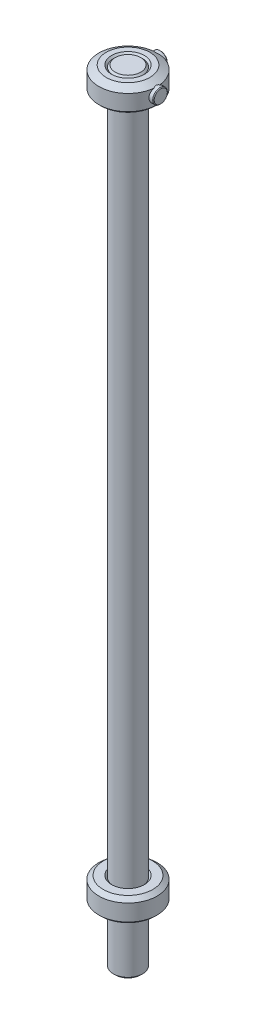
ISO-10303-21;
HEADER;
FILE_DESCRIPTION(('STEP AP214'),'2;1');
FILE_NAME('part.step','',(''),(''),'','','');
FILE_SCHEMA(('AUTOMOTIVE_DESIGN { 1 0 10303 214 1 1 1 1 }'));
ENDSEC;
DATA;
#1=APPLICATION_CONTEXT('core data for automotive mechanical design processes');
#2=APPLICATION_PROTOCOL_DEFINITION('international standard','automotive_design',2000,#1);
#3=PRODUCT_CONTEXT('',#1,'mechanical');
#4=PRODUCT('Part','Part','',(#3));
#5=PRODUCT_RELATED_PRODUCT_CATEGORY('part','',(#4));
#6=PRODUCT_DEFINITION_FORMATION('','',#4);
#7=PRODUCT_DEFINITION_CONTEXT('part definition',#1,'design');
#8=PRODUCT_DEFINITION('design','',#6,#7);
#9=PRODUCT_DEFINITION_SHAPE('','',#8);
#10=(LENGTH_UNIT() NAMED_UNIT(*) SI_UNIT(.MILLI.,.METRE.));
#11=(NAMED_UNIT(*) PLANE_ANGLE_UNIT() SI_UNIT($,.RADIAN.));
#12=(NAMED_UNIT(*) SI_UNIT($,.STERADIAN.) SOLID_ANGLE_UNIT());
#13=UNCERTAINTY_MEASURE_WITH_UNIT(LENGTH_MEASURE(1.E-05),#10,'distance_accuracy_value','');
#14=(GEOMETRIC_REPRESENTATION_CONTEXT(3) GLOBAL_UNCERTAINTY_ASSIGNED_CONTEXT((#13)) GLOBAL_UNIT_ASSIGNED_CONTEXT((#10,
#11,#12)) REPRESENTATION_CONTEXT('',''));
#15=CARTESIAN_POINT('',(0.,0.,0.));
#16=DIRECTION('',(0.,0.,1.));
#17=DIRECTION('',(1.,0.,0.));
#18=AXIS2_PLACEMENT_3D('',#15,#16,#17);
#19=CARTESIAN_POINT('',(0.,16.,0.));
#20=DIRECTION('',(0.,-1.,0.));
#21=DIRECTION('',(0.,0.,-1.));
#22=AXIS2_PLACEMENT_3D('',#19,#20,#21);
#23=CYLINDRICAL_SURFACE('',#22,8.);
#24=CARTESIAN_POINT('',(0.,21.03,0.));
#25=DIRECTION('',(0.,-1.,0.));
#26=DIRECTION('',(0.,0.,-1.));
#27=AXIS2_PLACEMENT_3D('',#24,#25,#26);
#28=CIRCLE('',#27,8.);
#29=CARTESIAN_POINT('',(0.,21.03,-8.));
#30=VERTEX_POINT('',#29);
#31=EDGE_CURVE('E11',#30,#30,#28,.T.);
#32=ORIENTED_EDGE('',*,*,#31,.T.);
#33=EDGE_LOOP('',(#32));
#34=FACE_BOUND('',#33,.T.);
#35=CARTESIAN_POINT('',(0.,16.5,0.));
#36=DIRECTION('',(0.,-1.,0.));
#37=DIRECTION('',(0.,0.,-1.));
#38=AXIS2_PLACEMENT_3D('',#35,#36,#37);
#39=CIRCLE('',#38,8.);
#40=CARTESIAN_POINT('',(0.,16.5,-8.));
#41=VERTEX_POINT('',#40);
#42=EDGE_CURVE('E360',#41,#41,#39,.T.);
#43=ORIENTED_EDGE('',*,*,#42,.F.);
#44=EDGE_LOOP('',(#43));
#45=FACE_BOUND('',#44,.T.);
#46=CARTESIAN_POINT('',(0.,17.75,-8.));
#47=CARTESIAN_POINT('',(0.0203375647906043,17.7499982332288,-8.00000027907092));
#48=CARTESIAN_POINT('',(0.0406755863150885,17.7504988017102,-7.99992245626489));
#49=CARTESIAN_POINT('',(0.0812306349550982,17.7525062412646,-7.99961312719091));
#50=CARTESIAN_POINT('',(0.101447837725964,17.7540096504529,-7.99938214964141));
#51=CARTESIAN_POINT('',(0.141760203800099,17.7580223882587,-7.99876930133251));
#52=CARTESIAN_POINT('',(0.161855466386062,17.7605307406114,-7.99838757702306));
#53=CARTESIAN_POINT('',(0.201922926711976,17.7665502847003,-7.99747642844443));
#54=CARTESIAN_POINT('',(0.22189489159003,17.7700629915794,-7.99694678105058));
#55=CARTESIAN_POINT('',(0.261715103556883,17.778088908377,-7.99574284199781));
#56=CARTESIAN_POINT('',(0.281562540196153,17.7826060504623,-7.995067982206));
#57=CARTESIAN_POINT('',(0.321133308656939,17.7926383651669,-7.99357666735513));
#58=CARTESIAN_POINT('',(0.340855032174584,17.7981597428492,-7.99275933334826));
#59=CARTESIAN_POINT('',(0.380174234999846,17.8101984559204,-7.99098606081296));
#60=CARTESIAN_POINT('',(0.399769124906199,17.8167240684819,-7.99002897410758));
#61=CARTESIAN_POINT('',(0.438834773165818,17.8307687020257,-7.98797914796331));
#62=CARTESIAN_POINT('',(0.458301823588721,17.8382978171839,-7.98688503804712));
#63=CARTESIAN_POINT('',(0.496849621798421,17.8542412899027,-7.98457969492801));
#64=CARTESIAN_POINT('',(0.515930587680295,17.8626551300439,-7.98336853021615));
#65=CARTESIAN_POINT('',(0.553468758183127,17.8802949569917,-7.98085350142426));
#66=CARTESIAN_POINT('',(0.571930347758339,17.8895117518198,-7.97955071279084));
#67=CARTESIAN_POINT('',(0.608230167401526,17.9087549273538,-7.97686558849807));
#68=CARTESIAN_POINT('',(0.62607221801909,17.9187741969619,-7.97548397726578));
#69=CARTESIAN_POINT('',(0.661133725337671,17.9396203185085,-7.97265387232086));
#70=CARTESIAN_POINT('',(0.678356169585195,17.9504422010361,-7.97120580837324));
#71=CARTESIAN_POINT('',(0.712179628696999,17.972891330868,-7.96825497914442));
#72=CARTESIAN_POINT('',(0.728782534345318,17.9845157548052,-7.96675241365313));
#73=CARTESIAN_POINT('',(0.761368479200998,18.0085677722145,-7.96370426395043));
#74=CARTESIAN_POINT('',(0.777352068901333,18.0209946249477,-7.96215872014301));
#75=CARTESIAN_POINT('',(0.808701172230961,18.0466495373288,-7.95903580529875));
#76=CARTESIAN_POINT('',(0.824065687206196,18.0598788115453,-7.95745838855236));
#77=CARTESIAN_POINT('',(0.854179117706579,18.0871361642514,-7.95428238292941));
#78=CARTESIAN_POINT('',(0.868925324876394,18.1011672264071,-7.95268373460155));
#79=CARTESIAN_POINT('',(0.897714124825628,18.1299390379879,-7.94948545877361));
#80=CARTESIAN_POINT('',(0.911756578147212,18.1446799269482,-7.94788583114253));
#81=CARTESIAN_POINT('',(0.939036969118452,18.1747874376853,-7.94470877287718));
#82=CARTESIAN_POINT('',(0.952277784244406,18.1901514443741,-7.94313128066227));
#83=CARTESIAN_POINT('',(0.977957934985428,18.2215028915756,-7.94001041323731));
#84=CARTESIAN_POINT('',(0.990398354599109,18.2374894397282,-7.93846699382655));
#85=CARTESIAN_POINT('',(1.01448058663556,18.2700843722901,-7.93542542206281));
#86=CARTESIAN_POINT('',(1.02612151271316,18.2866934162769,-7.93392732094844));
#87=CARTESIAN_POINT('',(1.04860788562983,18.3205317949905,-7.9309867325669));
#88=CARTESIAN_POINT('',(1.05945035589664,18.3377631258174,-7.92954446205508));
#89=CARTESIAN_POINT('',(1.08034309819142,18.3728447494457,-7.92672508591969));
#90=CARTESIAN_POINT('',(1.09038824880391,18.3906981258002,-7.92534842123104));
#91=CARTESIAN_POINT('',(1.10968931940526,18.427022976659,-7.92266907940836));
#92=CARTESIAN_POINT('',(1.11893798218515,18.4454983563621,-7.92136711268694));
#93=CARTESIAN_POINT('',(1.13665023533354,18.4830658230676,-7.91884506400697));
#94=CARTESIAN_POINT('',(1.1451045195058,18.502162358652,-7.91762599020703));
#95=CARTESIAN_POINT('',(1.16113240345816,18.5407457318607,-7.91529134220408));
#96=CARTESIAN_POINT('',(1.16870529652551,18.5602328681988,-7.91417585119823));
#97=CARTESIAN_POINT('',(1.18282912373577,18.5993336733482,-7.91207720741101));
#98=CARTESIAN_POINT('',(1.18939058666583,18.6189434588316,-7.91109270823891));
#99=CARTESIAN_POINT('',(1.20149532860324,18.6582876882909,-7.90926330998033));
#100=CARTESIAN_POINT('',(1.20704725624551,18.6780194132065,-7.90841723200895));
#101=CARTESIAN_POINT('',(1.21713557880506,18.7176065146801,-7.9068708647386));
#102=CARTESIAN_POINT('',(1.22167849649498,18.7374601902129,-7.90616964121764));
#103=CARTESIAN_POINT('',(1.22975183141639,18.7772901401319,-7.90491790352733));
#104=CARTESIAN_POINT('',(1.23328643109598,18.7972655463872,-7.90436676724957));
#105=CARTESIAN_POINT('',(1.23934628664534,18.837338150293,-7.90341889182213));
#106=CARTESIAN_POINT('',(1.24187323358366,18.8574350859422,-7.90302189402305));
#107=CARTESIAN_POINT('',(1.24592024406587,18.8977502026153,-7.90238489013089));
#108=CARTESIAN_POINT('',(1.24743942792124,18.9179684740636,-7.90214502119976));
#109=CARTESIAN_POINT('',(1.24947577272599,18.9585258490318,-7.90182329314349));
#110=CARTESIAN_POINT('',(1.24998948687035,18.9788651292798,-7.90174197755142));
#111=CARTESIAN_POINT('',(1.25000997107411,19.0194727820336,-7.9017387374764));
#112=CARTESIAN_POINT('',(1.24952027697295,19.0397411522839,-7.90181625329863));
#113=CARTESIAN_POINT('',(1.24752597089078,19.0801777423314,-7.90213135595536));
#114=CARTESIAN_POINT('',(1.24602381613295,19.1003460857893,-7.90236855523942));
#115=CARTESIAN_POINT('',(1.24200890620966,19.1405824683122,-7.90300056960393));
#116=CARTESIAN_POINT('',(1.23949599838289,19.1606504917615,-7.90339540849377));
#117=CARTESIAN_POINT('',(1.23346123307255,19.2006864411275,-7.90433948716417));
#118=CARTESIAN_POINT('',(1.22993664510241,19.2206539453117,-7.90488914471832));
#119=CARTESIAN_POINT('',(1.22188059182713,19.2604893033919,-7.90613840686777));
#120=CARTESIAN_POINT('',(1.21734392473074,19.2803560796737,-7.90683878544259));
#121=CARTESIAN_POINT('',(1.20726538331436,19.3199906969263,-7.90838393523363));
#122=CARTESIAN_POINT('',(1.20171601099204,19.3397565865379,-7.90922978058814));
#123=CARTESIAN_POINT('',(1.18961313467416,19.3791902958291,-7.91105924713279));
#124=CARTESIAN_POINT('',(1.18305006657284,19.3988551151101,-7.91204417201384));
#125=CARTESIAN_POINT('',(1.16892155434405,19.438087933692,-7.91414391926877));
#126=CARTESIAN_POINT('',(1.16134476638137,19.4576517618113,-7.91526019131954));
#127=CARTESIAN_POINT('',(1.14535217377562,19.4962817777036,-7.91759012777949));
#128=CARTESIAN_POINT('',(1.13694199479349,19.5153503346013,-7.91880312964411));
#129=CARTESIAN_POINT('',(1.11931597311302,19.5528738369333,-7.92131366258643));
#130=CARTESIAN_POINT('',(1.11010899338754,19.571333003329,-7.92261023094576));
#131=CARTESIAN_POINT('',(1.090891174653,19.6076382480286,-7.92527916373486));
#132=CARTESIAN_POINT('',(1.08088714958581,19.6254879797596,-7.92665085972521));
#133=CARTESIAN_POINT('',(1.0600760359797,19.6605749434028,-7.9294607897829));
#134=CARTESIAN_POINT('',(1.04927365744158,19.6778149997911,-7.93089861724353));
#135=CARTESIAN_POINT('',(1.02686691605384,19.7116834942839,-7.93383082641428));
#136=CARTESIAN_POINT('',(1.01526515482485,19.7283136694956,-7.93532501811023));
#137=CARTESIAN_POINT('',(0.991260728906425,19.7609636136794,-7.93835930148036));
#138=CARTESIAN_POINT('',(0.978858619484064,19.7769837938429,-7.93989936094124));
#139=CARTESIAN_POINT('',(0.953254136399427,19.8084148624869,-7.94301410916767));
#140=CARTESIAN_POINT('',(0.940050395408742,19.8238246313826,-7.94458885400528));
#141=CARTESIAN_POINT('',(0.912844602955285,19.8540374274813,-7.94776088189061));
#142=CARTESIAN_POINT('',(0.898839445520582,19.8688376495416,-7.94935823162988));
#143=CARTESIAN_POINT('',(0.870146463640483,19.8977093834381,-7.95255010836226));
#144=CARTESIAN_POINT('',(0.855459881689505,19.9117821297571,-7.95414463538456));
#145=CARTESIAN_POINT('',(0.82546468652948,19.9391185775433,-7.95731326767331));
#146=CARTESIAN_POINT('',(0.810158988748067,19.9523854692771,-7.9588874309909));
#147=CARTESIAN_POINT('',(0.778927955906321,19.9781128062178,-7.96200458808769));
#148=CARTESIAN_POINT('',(0.763003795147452,19.9905746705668,-7.96354763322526));
#149=CARTESIAN_POINT('',(0.730536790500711,20.0146935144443,-7.96659161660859));
#150=CARTESIAN_POINT('',(0.713993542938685,20.0263499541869,-7.96809252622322));
#151=CARTESIAN_POINT('',(0.680289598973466,20.0488600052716,-7.97104090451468));
#152=CARTESIAN_POINT('',(0.663127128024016,20.0597109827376,-7.97248819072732));
#153=CARTESIAN_POINT('',(0.628185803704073,20.0806122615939,-7.97531764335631));
#154=CARTESIAN_POINT('',(0.610404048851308,20.0906577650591,-7.97669940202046));
#155=CARTESIAN_POINT('',(0.57422493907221,20.1099500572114,-7.9793857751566));
#156=CARTESIAN_POINT('',(0.555823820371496,20.1191898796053,-7.98068969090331));
#157=CARTESIAN_POINT('',(0.518407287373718,20.1368737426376,-7.9832079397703));
#158=CARTESIAN_POINT('',(0.499387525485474,20.1453087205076,-7.98442122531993));
#159=CARTESIAN_POINT('',(0.460905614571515,20.1613099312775,-7.98673518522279));
#160=CARTESIAN_POINT('',(0.441442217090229,20.168873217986,-7.9878354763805));
#161=CARTESIAN_POINT('',(0.402351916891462,20.1829816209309,-7.98989939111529));
#162=CARTESIAN_POINT('',(0.382728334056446,20.1895357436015,-7.99086421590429));
#163=CARTESIAN_POINT('',(0.343320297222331,20.2016284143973,-7.99265396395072));
#164=CARTESIAN_POINT('',(0.323538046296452,20.2071739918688,-7.9934798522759));
#165=CARTESIAN_POINT('',(0.283814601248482,20.217251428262,-7.9949885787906));
#166=CARTESIAN_POINT('',(0.263874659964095,20.2217881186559,-7.99567209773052));
#167=CARTESIAN_POINT('',(0.223837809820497,20.2298500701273,-7.99689294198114));
#168=CARTESIAN_POINT('',(0.203741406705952,20.2333777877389,-7.99743062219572));
#169=CARTESIAN_POINT('',(0.163393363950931,20.2394243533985,-7.99835670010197));
#170=CARTESIAN_POINT('',(0.143141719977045,20.2419431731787,-7.99874509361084));
#171=CARTESIAN_POINT('',(0.102484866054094,20.2459739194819,-7.99936940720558));
#172=CARTESIAN_POINT('',(0.0820793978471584,20.2474832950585,-7.99960494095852));
#173=CARTESIAN_POINT('',(0.0411158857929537,20.2494997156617,-7.99992076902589));
#174=CARTESIAN_POINT('',(0.0205575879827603,20.2500017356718,-8.00000028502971));
#175=CARTESIAN_POINT('',(0.,20.25,-8.));
#176=B_SPLINE_CURVE_WITH_KNOTS('',3,(#46,#47,#48,#49,#50,#51,#52,#53,#54,#55,#56,#57,#58,#59,
#60,#61,#62,#63,#64,#65,#66,#67,#68,#69,#70,#71,#72,#73,#74,#75,#76,#77,#78,#79,#80,#81,#82,#83,
#84,#85,#86,#87,#88,#89,#90,#91,#92,#93,#94,#95,#96,#97,#98,#99,#100,#101,#102,#103,#104,#105,
#106,#107,#108,#109,#110,#111,#112,#113,#114,#115,#116,#117,#118,#119,#120,#121,#122,#123,#124,
#125,#126,#127,#128,#129,#130,#131,#132,#133,#134,#135,#136,#137,#138,#139,#140,#141,#142,#143,
#144,#145,#146,#147,#148,#149,#150,#151,#152,#153,#154,#155,#156,#157,#158,#159,#160,#161,#162,
#163,#164,#165,#166,#167,#168,#169,#170,#171,#172,#173,#174,#175),.UNSPECIFIED.,.F.,.F.,(4,2,2,
2,2,2,2,2,2,2,2,2,2,2,2,2,2,2,2,2,2,2,2,2,2,2,2,2,2,2,2,2,2,2,2,2,2,2,2,2,2,2,2,2,2,2,2,2,2,2,2,
2,2,2,2,2,2,2,2,2,2,2,2,2,4),(0.,0.0610069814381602,0.12180444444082,0.182542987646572,
0.243373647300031,0.304446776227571,0.365910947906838,0.427911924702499,0.490591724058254,
0.553235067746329,0.615237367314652,0.676740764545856,0.737890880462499,0.798835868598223,
0.859725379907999,0.920709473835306,0.981937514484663,1.04317764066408,1.10418302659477,
1.16510397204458,1.22609140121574,1.28729574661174,1.34886585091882,1.41094792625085,
1.47368460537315,1.53647124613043,1.59855226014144,1.66007340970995,1.72118446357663,
1.78203821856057,1.84278941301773,1.90359356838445,1.96460580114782,2.02540340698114,
2.08605398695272,2.14671373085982,2.20753875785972,2.26868392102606,2.33030165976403,
2.39254094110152,2.45554632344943,2.51815213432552,2.58013411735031,2.64163370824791,
2.70279568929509,2.76376724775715,2.82469695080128,2.88573367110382,2.94702550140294,
3.00820965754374,3.06913324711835,3.12994632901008,3.19079977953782,3.25184417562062,
3.31322868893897,3.37510003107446,3.43760148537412,3.50030834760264,3.56241831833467,
3.62407725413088,3.6854342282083,3.74664052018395,3.80784852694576,3.86921063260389,
3.93087807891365),.UNSPECIFIED.);
#177=CARTESIAN_POINT('',(0.,17.75,-8.));
#178=VERTEX_POINT('',#177);
#179=CARTESIAN_POINT('',(0.,20.25,-8.));
#180=VERTEX_POINT('',#179);
#181=EDGE_CURVE('E29',#178,#180,#176,.T.);
#182=ORIENTED_EDGE('',*,*,#181,.T.);
#183=CARTESIAN_POINT('',(0.,20.25,-8.));
#184=CARTESIAN_POINT('',(-0.0205417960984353,20.2500017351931,-8.00000028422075));
#185=CARTESIAN_POINT('',(-0.0410842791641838,20.2495001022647,-7.99992089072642));
#186=CARTESIAN_POINT('',(-0.0820190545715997,20.2474855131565,-7.99960552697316));
#187=CARTESIAN_POINT('',(-0.102411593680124,20.2459774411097,-7.99937031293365));
#188=CARTESIAN_POINT('',(-0.143045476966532,20.2419503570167,-7.99874678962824));
#189=CARTESIAN_POINT('',(-0.163287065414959,20.2394337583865,-7.99835884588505));
#190=CARTESIAN_POINT('',(-0.203617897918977,20.2333926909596,-7.9974337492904));
#191=CARTESIAN_POINT('',(-0.223707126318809,20.2298681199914,-7.9968965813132));
#192=CARTESIAN_POINT('',(-0.26373252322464,20.2218134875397,-7.99567677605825));
#193=CARTESIAN_POINT('',(-0.283668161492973,20.2172808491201,-7.99499376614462));
#194=CARTESIAN_POINT('',(-0.323385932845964,20.2072126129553,-7.9934860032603));
#195=CARTESIAN_POINT('',(-0.343166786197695,20.2016720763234,-7.99266055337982));
#196=CARTESIAN_POINT('',(-0.382574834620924,20.1895902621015,-7.99087156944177));
#197=CARTESIAN_POINT('',(-0.402199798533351,20.183041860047,-7.98990705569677));
#198=CARTESIAN_POINT('',(-0.441296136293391,20.1689468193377,-7.98784355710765));
#199=CARTESIAN_POINT('',(-0.460764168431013,20.1613911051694,-7.98674335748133));
#200=CARTESIAN_POINT('',(-0.499206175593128,20.1454234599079,-7.98443245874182));
#201=CARTESIAN_POINT('',(-0.518182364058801,20.1370167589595,-7.98322243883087));
#202=CARTESIAN_POINT('',(-0.555520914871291,20.1193847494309,-7.98071070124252));
#203=CARTESIAN_POINT('',(-0.573887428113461,20.1101681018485,-7.97940997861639));
#204=CARTESIAN_POINT('',(-0.610007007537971,20.0909186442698,-7.97672971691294));
#205=CARTESIAN_POINT('',(-0.627763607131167,20.0808923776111,-7.97535083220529));
#206=CARTESIAN_POINT('',(-0.662664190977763,20.0600257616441,-7.97252664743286));
#207=CARTESIAN_POINT('',(-0.67981082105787,20.0491897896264,-7.97108171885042));
#208=CARTESIAN_POINT('',(-0.713492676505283,20.0267059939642,-7.96813737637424));
#209=CARTESIAN_POINT('',(-0.730029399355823,20.0150603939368,-7.96663811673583));
#210=CARTESIAN_POINT('',(-0.762493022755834,19.9909595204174,-7.96359655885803));
#211=CARTESIAN_POINT('',(-0.778420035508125,19.9785043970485,-7.9620542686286));
#212=CARTESIAN_POINT('',(-0.809666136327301,19.952786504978,-7.95893760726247));
#213=CARTESIAN_POINT('',(-0.824983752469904,19.939521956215,-7.95736317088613));
#214=CARTESIAN_POINT('',(-0.855013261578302,19.9121872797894,-7.95419269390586));
#215=CARTESIAN_POINT('',(-0.869721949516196,19.8981136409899,-7.95259658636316));
#216=CARTESIAN_POINT('',(-0.898417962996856,19.8692803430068,-7.94940584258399));
#217=CARTESIAN_POINT('',(-0.912406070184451,19.854521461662,-7.94781120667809));
#218=CARTESIAN_POINT('',(-0.939582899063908,19.8243852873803,-7.94464413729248));
#219=CARTESIAN_POINT('',(-0.952774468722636,19.8090105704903,-7.94307164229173));
#220=CARTESIAN_POINT('',(-0.978360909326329,19.777644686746,-7.93996069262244));
#221=CARTESIAN_POINT('',(-0.990756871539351,19.7616544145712,-7.93842219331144));
#222=CARTESIAN_POINT('',(-1.0147550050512,19.7290590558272,-7.93539026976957));
#223=CARTESIAN_POINT('',(-1.02635633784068,19.7124533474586,-7.93389689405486));
#224=CARTESIAN_POINT('',(-1.04876826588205,19.6786286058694,-7.93096547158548));
#225=CARTESIAN_POINT('',(-1.05957597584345,19.661407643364,-7.92952763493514));
#226=CARTESIAN_POINT('',(-1.0804038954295,19.626353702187,-7.9267167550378));
#227=CARTESIAN_POINT('',(-1.09041911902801,19.6085177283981,-7.92534414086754));
#228=CARTESIAN_POINT('',(-1.10966496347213,19.5722346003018,-7.92267245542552));
#229=CARTESIAN_POINT('',(-1.11888850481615,19.5537836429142,-7.92137407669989));
#230=CARTESIAN_POINT('',(-1.13655514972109,19.5162719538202,-7.91885868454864));
#231=CARTESIAN_POINT('',(-1.14498916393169,19.497206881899,-7.91764265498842));
#232=CARTESIAN_POINT('',(-1.16099641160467,19.458655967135,-7.91531128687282));
#233=CARTESIAN_POINT('',(-1.16856742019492,19.4391691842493,-7.91419621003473));
#234=CARTESIAN_POINT('',(-1.18268951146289,19.4000722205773,-7.91209807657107));
#235=CARTESIAN_POINT('',(-1.18925119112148,19.3804659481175,-7.91111366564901));
#236=CARTESIAN_POINT('',(-1.20135843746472,19.3411318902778,-7.90928410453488));
#237=CARTESIAN_POINT('',(-1.20691274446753,19.3214068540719,-7.90843776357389));
#238=CARTESIAN_POINT('',(-1.21700785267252,19.2818362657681,-7.90689052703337));
#239=CARTESIAN_POINT('',(-1.22155529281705,19.261992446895,-7.9061886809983));
#240=CARTESIAN_POINT('',(-1.22963968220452,19.2221853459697,-7.90493535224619));
#241=CARTESIAN_POINT('',(-1.23318095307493,19.2022229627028,-7.9043832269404));
#242=CARTESIAN_POINT('',(-1.2392561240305,19.1621795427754,-7.90343303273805));
#243=CARTESIAN_POINT('',(-1.24179187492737,19.1420987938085,-7.90303468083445));
#244=CARTESIAN_POINT('',(-1.24585849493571,19.101819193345,-7.90239462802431));
#245=CARTESIAN_POINT('',(-1.24738866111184,19.0816202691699,-7.90215303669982));
#246=CARTESIAN_POINT('',(-1.24944878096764,19.041104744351,-7.90182756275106));
#247=CARTESIAN_POINT('',(-1.24997547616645,19.0207879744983,-7.90174419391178));
#248=CARTESIAN_POINT('',(-1.25002430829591,18.9801850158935,-7.90173646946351));
#249=CARTESIAN_POINT('',(-1.24954802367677,18.9598988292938,-7.90181186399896));
#250=CARTESIAN_POINT('',(-1.24757915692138,18.9194301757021,-7.90212295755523));
#251=CARTESIAN_POINT('',(-1.24608924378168,18.8992475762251,-7.9023582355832));
#252=CARTESIAN_POINT('',(-1.24209726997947,18.8589862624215,-7.90298667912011));
#253=CARTESIAN_POINT('',(-1.23959526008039,18.8389075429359,-7.90337983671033));
#254=CARTESIAN_POINT('',(-1.23358080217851,18.7988537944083,-7.90432082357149));
#255=CARTESIAN_POINT('',(-1.23006581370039,18.7788791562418,-7.90486904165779));
#256=CARTESIAN_POINT('',(-1.22202747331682,18.7390331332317,-7.90611570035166));
#257=CARTESIAN_POINT('',(-1.21749909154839,18.719162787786,-7.90681488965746));
#258=CARTESIAN_POINT('',(-1.2074356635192,18.679524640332,-7.90835793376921));
#259=CARTESIAN_POINT('',(-1.20189326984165,18.6597587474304,-7.90920284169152));
#260=CARTESIAN_POINT('',(-1.18980289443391,18.6203286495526,-7.91103070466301));
#261=CARTESIAN_POINT('',(-1.18324547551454,18.600667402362,-7.9120149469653));
#262=CARTESIAN_POINT('',(-1.1691269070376,18.5614453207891,-7.91411358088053));
#263=CARTESIAN_POINT('',(-1.16155451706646,18.5418886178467,-7.91522941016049));
#264=CARTESIAN_POINT('',(-1.14555276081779,18.5032370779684,-7.91756112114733));
#265=CARTESIAN_POINT('',(-1.13712734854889,18.4841405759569,-7.9187765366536));
#266=CARTESIAN_POINT('',(-1.119465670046,18.4465678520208,-7.92129252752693));
#267=CARTESIAN_POINT('',(-1.11023847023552,18.4280873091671,-7.92259211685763));
#268=CARTESIAN_POINT('',(-1.09097512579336,18.3917459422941,-7.92526763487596));
#269=CARTESIAN_POINT('',(-1.08094595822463,18.3738813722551,-7.92664287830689));
#270=CARTESIAN_POINT('',(-1.06007948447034,18.3387713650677,-7.92946036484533));
#271=CARTESIAN_POINT('',(-1.04924700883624,18.3215230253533,-7.93090219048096));
#272=CARTESIAN_POINT('',(-1.02677504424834,18.2876445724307,-7.93384276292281));
#273=CARTESIAN_POINT('',(-1.015138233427,18.2710126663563,-7.93534131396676));
#274=CARTESIAN_POINT('',(-0.99105868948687,18.238365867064,-7.93838458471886));
#275=CARTESIAN_POINT('',(-0.978616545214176,18.2223505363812,-7.93992927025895));
#276=CARTESIAN_POINT('',(-0.952927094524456,18.1909356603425,-7.94305342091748));
#277=CARTESIAN_POINT('',(-0.939678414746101,18.1755372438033,-7.94463294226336));
#278=CARTESIAN_POINT('',(-0.912377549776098,18.1453539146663,-7.94781459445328));
#279=CARTESIAN_POINT('',(-0.898322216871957,18.1305718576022,-7.9494167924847));
#280=CARTESIAN_POINT('',(-0.869540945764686,18.1017574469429,-7.95261640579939));
#281=CARTESIAN_POINT('',(-0.854816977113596,18.087723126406,-7.95421382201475));
#282=CARTESIAN_POINT('',(-0.824737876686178,18.0604556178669,-7.95738872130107));
#283=CARTESIAN_POINT('',(-0.809385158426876,18.0472197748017,-7.95896625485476));
#284=CARTESIAN_POINT('',(-0.778050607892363,18.0215468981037,-7.96209048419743));
#285=CARTESIAN_POINT('',(-0.762069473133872,18.0091090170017,-7.96363721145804));
#286=CARTESIAN_POINT('',(-0.729479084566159,17.9850303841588,-7.96668867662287));
#287=CARTESIAN_POINT('',(-0.712868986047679,17.973390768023,-7.96819335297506));
#288=CARTESIAN_POINT('',(-0.679021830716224,17.9509066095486,-7.97114916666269));
#289=CARTESIAN_POINT('',(-0.661782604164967,17.940065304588,-7.97260007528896));
#290=CARTESIAN_POINT('',(-0.626678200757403,17.9191756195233,-7.97543644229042));
#291=CARTESIAN_POINT('',(-0.608809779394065,17.9091326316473,-7.97682143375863));
#292=CARTESIAN_POINT('',(-0.572447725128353,17.8898375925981,-7.97951369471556));
#293=CARTESIAN_POINT('',(-0.553950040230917,17.8805930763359,-7.98082019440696));
#294=CARTESIAN_POINT('',(-0.516330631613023,17.8628922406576,-7.98334277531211));
#295=CARTESIAN_POINT('',(-0.497204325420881,17.8544455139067,-7.98455772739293));
#296=CARTESIAN_POINT('',(-0.458607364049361,17.8384569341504,-7.98686750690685));
#297=CARTESIAN_POINT('',(-0.439137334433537,17.8309135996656,-7.98796253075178));
#298=CARTESIAN_POINT('',(-0.400062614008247,17.8168432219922,-7.99001429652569));
#299=CARTESIAN_POINT('',(-0.38046162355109,17.8103061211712,-7.99097239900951));
#300=CARTESIAN_POINT('',(-0.341127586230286,17.7982459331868,-7.99274772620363));
#301=CARTESIAN_POINT('',(-0.321397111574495,17.7927146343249,-7.99356608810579));
#302=CARTESIAN_POINT('',(-0.281806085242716,17.7826642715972,-7.99505942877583));
#303=CARTESIAN_POINT('',(-0.261947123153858,17.7781390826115,-7.99573527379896));
#304=CARTESIAN_POINT('',(-0.222101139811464,17.7700987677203,-7.99694109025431));
#305=CARTESIAN_POINT('',(-0.202114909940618,17.7665798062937,-7.99747161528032));
#306=CARTESIAN_POINT('',(-0.162016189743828,17.7605494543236,-7.99838436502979));
#307=CARTESIAN_POINT('',(-0.141903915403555,17.7580366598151,-7.99876679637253));
#308=CARTESIAN_POINT('',(-0.101554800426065,17.7540167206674,-7.99938084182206));
#309=CARTESIAN_POINT('',(-0.0813178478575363,17.7525106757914,-7.9996122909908));
#310=CARTESIAN_POINT('',(-0.040720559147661,17.750499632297,-7.99992228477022));
#311=CARTESIAN_POINT('',(-0.0203600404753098,17.7499982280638,-8.00000028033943));
#312=CARTESIAN_POINT('',(0.,17.75,-8.));
#313=B_SPLINE_CURVE_WITH_KNOTS('',3,(#183,#184,#185,#186,#187,#188,#189,#190,#191,#192,#193,
#194,#195,#196,#197,#198,#199,#200,#201,#202,#203,#204,#205,#206,#207,#208,#209,#210,#211,#212,
#213,#214,#215,#216,#217,#218,#219,#220,#221,#222,#223,#224,#225,#226,#227,#228,#229,#230,#231,
#232,#233,#234,#235,#236,#237,#238,#239,#240,#241,#242,#243,#244,#245,#246,#247,#248,#249,#250,
#251,#252,#253,#254,#255,#256,#257,#258,#259,#260,#261,#262,#263,#264,#265,#266,#267,#268,#269,
#270,#271,#272,#273,#274,#275,#276,#277,#278,#279,#280,#281,#282,#283,#284,#285,#286,#287,#288,
#289,#290,#291,#292,#293,#294,#295,#296,#297,#298,#299,#300,#301,#302,#303,#304,#305,#306,#307,
#308,#309,#310,#311,#312),.UNSPECIFIED.,.F.,.F.,(4,2,2,2,2,2,2,2,2,2,2,2,2,2,2,2,2,2,2,2,2,2,2,
2,2,2,2,2,2,2,2,2,2,2,2,2,2,2,2,2,2,2,2,2,2,2,2,2,2,2,2,2,2,2,2,2,2,2,2,2,2,2,2,2,4),(0.,
0.0616200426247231,0.122943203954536,0.184120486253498,0.245303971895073,0.306645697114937,
0.36829652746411,0.430405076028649,0.493116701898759,0.555463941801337,0.617210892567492,
0.678500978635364,0.739480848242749,0.800299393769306,0.861106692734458,0.922052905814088,
0.98328717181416,1.04445355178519,1.10538641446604,1.16623383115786,1.22714449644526,
1.28826664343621,1.34974697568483,1.41172965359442,1.47435536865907,1.53713904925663,
1.59921042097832,1.66071437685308,1.72179984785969,1.78261883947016,1.84332535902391,
1.9040742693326,1.96502011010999,2.02587010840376,2.08656049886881,2.14724784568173,
2.2080887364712,2.26923857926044,2.33085044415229,2.3930739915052,2.45605452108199,
2.51875543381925,2.58082196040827,2.64239747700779,2.70362880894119,2.7646652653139,
2.82565758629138,2.88675683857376,2.94811329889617,3.00929946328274,3.07026947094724,
3.13117361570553,3.19216267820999,3.25338681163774,3.31499445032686,3.3771312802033,
3.43993930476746,3.50264287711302,3.56467207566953,3.62616956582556,3.68728173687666,
3.74815775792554,3.80894853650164,3.86980561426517,3.93088003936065),.UNSPECIFIED.);
#314=EDGE_CURVE('E202',#180,#178,#313,.T.);
#315=ORIENTED_EDGE('',*,*,#314,.T.);
#316=EDGE_LOOP('',(#182,#315));
#317=FACE_BOUND('',#316,.T.);
#318=CARTESIAN_POINT('',(-8.,20.25,0.));
#319=CARTESIAN_POINT('',(-8.00000027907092,20.2500017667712,0.020337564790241));
#320=CARTESIAN_POINT('',(-7.99992245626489,20.2495011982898,0.0406755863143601));
#321=CARTESIAN_POINT('',(-7.99961312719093,20.2474937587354,0.0812306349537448));
#322=CARTESIAN_POINT('',(-7.99938214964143,20.2459903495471,0.101447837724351));
#323=CARTESIAN_POINT('',(-7.99876930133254,20.2419776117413,0.141760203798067));
#324=CARTESIAN_POINT('',(-7.99838757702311,20.2394692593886,0.161855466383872));
#325=CARTESIAN_POINT('',(-7.99747642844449,20.2334497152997,0.201922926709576));
#326=CARTESIAN_POINT('',(-7.99694678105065,20.2299370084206,0.221894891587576));
#327=CARTESIAN_POINT('',(-7.99574284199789,20.221911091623,0.261715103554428));
#328=CARTESIAN_POINT('',(-7.99506798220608,20.2173939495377,0.281562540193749));
#329=CARTESIAN_POINT('',(-7.99357666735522,20.2073616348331,0.321133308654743));
#330=CARTESIAN_POINT('',(-7.99275933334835,20.2018402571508,0.340855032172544));
#331=CARTESIAN_POINT('',(-7.99098606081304,20.1898015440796,0.380174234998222));
#332=CARTESIAN_POINT('',(-7.99002897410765,20.1832759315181,0.399769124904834));
#333=CARTESIAN_POINT('',(-7.98797914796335,20.1692312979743,0.438834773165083));
#334=CARTESIAN_POINT('',(-7.98688503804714,20.1617021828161,0.458301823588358));
#335=CARTESIAN_POINT('',(-7.98457969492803,20.1457587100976,0.496849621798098));
#336=CARTESIAN_POINT('',(-7.98336853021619,20.1373448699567,0.515930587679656));
#337=CARTESIAN_POINT('',(-7.98085350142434,20.1197050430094,0.553468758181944));
#338=CARTESIAN_POINT('',(-7.97955071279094,20.1104882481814,0.571930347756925));
#339=CARTESIAN_POINT('',(-7.97686558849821,20.0912450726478,0.608230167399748));
#340=CARTESIAN_POINT('',(-7.97548397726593,20.0812258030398,0.626072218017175));
#341=CARTESIAN_POINT('',(-7.97265387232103,20.0603796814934,0.661133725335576));
#342=CARTESIAN_POINT('',(-7.97120580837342,20.0495577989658,0.678356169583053));
#343=CARTESIAN_POINT('',(-7.96825497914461,20.0271086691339,0.712179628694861));
#344=CARTESIAN_POINT('',(-7.96675241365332,20.0154842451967,0.728782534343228));
#345=CARTESIAN_POINT('',(-7.96370426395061,19.9914322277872,0.761368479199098));
#346=CARTESIAN_POINT('',(-7.96215872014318,19.9790053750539,0.777352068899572));
#347=CARTESIAN_POINT('',(-7.95903580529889,19.9533504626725,0.808701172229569));
#348=CARTESIAN_POINT('',(-7.95745838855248,19.9401211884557,0.82406568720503));
#349=CARTESIAN_POINT('',(-7.95428238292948,19.9128638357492,0.854179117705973));
#350=CARTESIAN_POINT('',(-7.95268373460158,19.8988327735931,0.868925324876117));
#351=CARTESIAN_POINT('',(-7.9494854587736,19.8700609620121,0.897714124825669));
#352=CARTESIAN_POINT('',(-7.94788583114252,19.8553200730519,0.911756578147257));
#353=CARTESIAN_POINT('',(-7.94470877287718,19.8252125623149,0.939036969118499));
#354=CARTESIAN_POINT('',(-7.94313128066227,19.8098485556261,0.952277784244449));
#355=CARTESIAN_POINT('',(-7.94001041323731,19.7784971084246,0.977957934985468));
#356=CARTESIAN_POINT('',(-7.93846699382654,19.762510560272,0.99039835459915));
#357=CARTESIAN_POINT('',(-7.9354254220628,19.7299156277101,1.0144805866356));
#358=CARTESIAN_POINT('',(-7.93392732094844,19.7133065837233,1.02612151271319));
#359=CARTESIAN_POINT('',(-7.93098673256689,19.6794682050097,1.04860788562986));
#360=CARTESIAN_POINT('',(-7.92954446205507,19.6622368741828,1.05945035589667));
#361=CARTESIAN_POINT('',(-7.92672508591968,19.6271552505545,1.08034309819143));
#362=CARTESIAN_POINT('',(-7.92534842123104,19.6093018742,1.09038824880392));
#363=CARTESIAN_POINT('',(-7.92266907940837,19.5729770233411,1.10968931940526));
#364=CARTESIAN_POINT('',(-7.92136711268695,19.554501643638,1.11893798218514));
#365=CARTESIAN_POINT('',(-7.91884506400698,19.5169341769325,1.13665023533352));
#366=CARTESIAN_POINT('',(-7.91762599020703,19.497837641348,1.14510451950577));
#367=CARTESIAN_POINT('',(-7.91529134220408,19.4592542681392,1.16113240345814));
#368=CARTESIAN_POINT('',(-7.91417585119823,19.439767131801,1.16870529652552));
#369=CARTESIAN_POINT('',(-7.912077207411,19.4006663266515,1.18282912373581));
#370=CARTESIAN_POINT('',(-7.9110927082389,19.381056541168,1.18939058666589));
#371=CARTESIAN_POINT('',(-7.90926330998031,19.3417123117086,1.20149532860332));
#372=CARTESIAN_POINT('',(-7.90841723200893,19.3219805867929,1.2070472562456));
#373=CARTESIAN_POINT('',(-7.90687086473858,19.2823934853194,1.21713557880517));
#374=CARTESIAN_POINT('',(-7.90616964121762,19.2625398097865,1.22167849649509));
#375=CARTESIAN_POINT('',(-7.90491790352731,19.2227098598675,1.2297518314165));
#376=CARTESIAN_POINT('',(-7.90436676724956,19.2027344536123,1.2332864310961));
#377=CARTESIAN_POINT('',(-7.90341889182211,19.1626618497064,1.23934628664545));
#378=CARTESIAN_POINT('',(-7.90302189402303,19.1425649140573,1.24187323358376));
#379=CARTESIAN_POINT('',(-7.90238489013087,19.1022497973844,1.24592024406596));
#380=CARTESIAN_POINT('',(-7.90214502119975,19.0820315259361,1.24743942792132));
#381=CARTESIAN_POINT('',(-7.90182329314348,19.041474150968,1.24947577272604));
#382=CARTESIAN_POINT('',(-7.90174197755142,19.0211348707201,1.24998948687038));
#383=CARTESIAN_POINT('',(-7.9017387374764,18.9805272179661,1.25000997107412));
#384=CARTESIAN_POINT('',(-7.90181625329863,18.9602588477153,1.24952027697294));
#385=CARTESIAN_POINT('',(-7.90213135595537,18.9198222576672,1.24752597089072));
#386=CARTESIAN_POINT('',(-7.90236855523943,18.8996539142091,1.24602381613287));
#387=CARTESIAN_POINT('',(-7.90300056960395,18.8594175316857,1.24200890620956));
#388=CARTESIAN_POINT('',(-7.90339540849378,18.8393495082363,1.23949599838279));
#389=CARTESIAN_POINT('',(-7.90433948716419,18.7993135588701,1.23346123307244));
#390=CARTESIAN_POINT('',(-7.90488914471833,18.7793460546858,1.2299366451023));
#391=CARTESIAN_POINT('',(-7.90613840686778,18.7395106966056,1.22188059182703));
#392=CARTESIAN_POINT('',(-7.9068387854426,18.7196439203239,1.21734392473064));
#393=CARTESIAN_POINT('',(-7.90838393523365,18.6800093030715,1.20726538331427));
#394=CARTESIAN_POINT('',(-7.90922978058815,18.66024341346,1.20171601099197));
#395=CARTESIAN_POINT('',(-7.91105924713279,18.6208097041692,1.18961313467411));
#396=CARTESIAN_POINT('',(-7.91204417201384,18.6011448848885,1.18305006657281));
#397=CARTESIAN_POINT('',(-7.91414391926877,18.5619120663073,1.16892155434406));
#398=CARTESIAN_POINT('',(-7.91526019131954,18.5423482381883,1.16134476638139));
#399=CARTESIAN_POINT('',(-7.91759012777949,18.5037182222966,1.14535217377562));
#400=CARTESIAN_POINT('',(-7.91880312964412,18.4846496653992,1.13694199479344));
#401=CARTESIAN_POINT('',(-7.92131366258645,18.4471261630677,1.1193159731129));
#402=CARTESIAN_POINT('',(-7.92261023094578,18.4286669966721,1.1101089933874));
#403=CARTESIAN_POINT('',(-7.92527916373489,18.3923617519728,1.09089117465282));
#404=CARTESIAN_POINT('',(-7.92665085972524,18.3745120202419,1.08088714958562));
#405=CARTESIAN_POINT('',(-7.92946078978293,18.3394250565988,1.06007603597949));
#406=CARTESIAN_POINT('',(-7.93089861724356,18.3221850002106,1.04927365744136));
#407=CARTESIAN_POINT('',(-7.93383082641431,18.2883165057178,1.02686691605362));
#408=CARTESIAN_POINT('',(-7.93532501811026,18.2716863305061,1.01526515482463));
#409=CARTESIAN_POINT('',(-7.93835930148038,18.2390363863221,0.99126072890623));
#410=CARTESIAN_POINT('',(-7.93989936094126,18.2230162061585,0.978858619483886));
#411=CARTESIAN_POINT('',(-7.94301410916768,18.1915851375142,0.953254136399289));
#412=CARTESIAN_POINT('',(-7.94458885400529,18.1761753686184,0.940050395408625));
#413=CARTESIAN_POINT('',(-7.94776088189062,18.1459625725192,0.912844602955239));
#414=CARTESIAN_POINT('',(-7.94935823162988,18.1311623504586,0.898839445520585));
#415=CARTESIAN_POINT('',(-7.95255010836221,18.102290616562,0.870146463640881));
#416=CARTESIAN_POINT('',(-7.95414463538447,18.0882178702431,0.855459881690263));
#417=CARTESIAN_POINT('',(-7.95731326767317,18.060881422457,0.825464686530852));
#418=CARTESIAN_POINT('',(-7.95888743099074,18.0476145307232,0.810158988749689));
#419=CARTESIAN_POINT('',(-7.96200458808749,18.0218871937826,0.778927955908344));
#420=CARTESIAN_POINT('',(-7.96354763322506,18.0094253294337,0.763003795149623));
#421=CARTESIAN_POINT('',(-7.96659161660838,17.9853064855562,0.730536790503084));
#422=CARTESIAN_POINT('',(-7.968092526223,17.9736500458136,0.713993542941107));
#423=CARTESIAN_POINT('',(-7.97104090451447,17.951139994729,0.68028959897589));
#424=CARTESIAN_POINT('',(-7.97248819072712,17.9402890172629,0.663127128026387));
#425=CARTESIAN_POINT('',(-7.97531764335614,17.9193877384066,0.62818580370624));
#426=CARTESIAN_POINT('',(-7.97669940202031,17.9093422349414,0.610404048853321));
#427=CARTESIAN_POINT('',(-7.97938577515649,17.890049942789,0.57422493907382));
#428=CARTESIAN_POINT('',(-7.98068969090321,17.880810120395,0.555823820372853));
#429=CARTESIAN_POINT('',(-7.98320793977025,17.8631262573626,0.518407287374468));
#430=CARTESIAN_POINT('',(-7.98442122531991,17.8546912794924,0.499387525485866));
#431=CARTESIAN_POINT('',(-7.9867351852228,17.8386900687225,0.460905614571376));
#432=CARTESIAN_POINT('',(-7.98783547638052,17.831126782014,0.44144221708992));
#433=CARTESIAN_POINT('',(-7.98989939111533,17.8170183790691,0.402351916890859));
#434=CARTESIAN_POINT('',(-7.99086421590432,17.8104642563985,0.382728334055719));
#435=CARTESIAN_POINT('',(-7.99265396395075,17.7983715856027,0.343320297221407));
#436=CARTESIAN_POINT('',(-7.99347985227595,17.7928260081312,0.323538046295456));
#437=CARTESIAN_POINT('',(-7.99498857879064,17.782748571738,0.283814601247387));
#438=CARTESIAN_POINT('',(-7.99567209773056,17.7782118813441,0.263874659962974));
#439=CARTESIAN_POINT('',(-7.99689294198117,17.7701499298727,0.223837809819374));
#440=CARTESIAN_POINT('',(-7.99743062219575,17.7666222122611,0.203741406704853));
#441=CARTESIAN_POINT('',(-7.99835670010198,17.7605756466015,0.163393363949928));
#442=CARTESIAN_POINT('',(-7.99874509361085,17.7580568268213,0.143141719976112));
#443=CARTESIAN_POINT('',(-7.99936940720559,17.7540260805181,0.102484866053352));
#444=CARTESIAN_POINT('',(-7.99960494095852,17.7525167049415,0.0820793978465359));
#445=CARTESIAN_POINT('',(-7.9999207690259,17.7505002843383,0.0411158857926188));
#446=CARTESIAN_POINT('',(-8.00000028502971,17.7499982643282,0.0205575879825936));
#447=CARTESIAN_POINT('',(-8.,17.75,0.));
#448=B_SPLINE_CURVE_WITH_KNOTS('',3,(#318,#319,#320,#321,#322,#323,#324,#325,#326,#327,#328,
#329,#330,#331,#332,#333,#334,#335,#336,#337,#338,#339,#340,#341,#342,#343,#344,#345,#346,#347,
#348,#349,#350,#351,#352,#353,#354,#355,#356,#357,#358,#359,#360,#361,#362,#363,#364,#365,#366,
#367,#368,#369,#370,#371,#372,#373,#374,#375,#376,#377,#378,#379,#380,#381,#382,#383,#384,#385,
#386,#387,#388,#389,#390,#391,#392,#393,#394,#395,#396,#397,#398,#399,#400,#401,#402,#403,#404,
#405,#406,#407,#408,#409,#410,#411,#412,#413,#414,#415,#416,#417,#418,#419,#420,#421,#422,#423,
#424,#425,#426,#427,#428,#429,#430,#431,#432,#433,#434,#435,#436,#437,#438,#439,#440,#441,#442,
#443,#444,#445,#446,#447),.UNSPECIFIED.,.F.,.F.,(4,2,2,2,2,2,2,2,2,2,2,2,2,2,2,2,2,2,2,2,2,2,2,
2,2,2,2,2,2,2,2,2,2,2,2,2,2,2,2,2,2,2,2,2,2,2,2,2,2,2,2,2,2,2,2,2,2,2,2,2,2,2,2,2,4),(0.,
0.0610069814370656,0.121804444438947,0.18254298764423,0.243373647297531,0.304446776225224,
0.365910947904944,0.427911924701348,0.490591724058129,0.553235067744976,0.615237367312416,
0.676740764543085,0.737890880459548,0.798835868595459,0.85972537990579,0.920709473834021,
0.981937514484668,1.04317764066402,1.10418302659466,1.16510397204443,1.22609140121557,
1.28729574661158,1.34886585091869,1.41094792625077,1.47368460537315,1.5364712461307,
1.59855226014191,1.66007340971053,1.72118446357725,1.78203821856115,1.8427894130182,
1.90359356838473,1.96460580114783,2.02540340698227,2.08605398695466,2.14671373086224,
2.20753875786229,2.26868392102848,2.33030165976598,2.39254094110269,2.45554632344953,
2.51815213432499,2.58013411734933,2.64163370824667,2.70279568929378,2.76376724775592,
2.82469695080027,2.88573367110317,2.94702550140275,3.00820965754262,3.06913324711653,
3.12994632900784,3.19079977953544,3.25184417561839,3.31322868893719,3.37510003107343,
3.43760148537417,3.50030834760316,3.56241831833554,3.62407725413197,3.68543422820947,
3.74664052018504,3.80784852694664,3.86921063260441,3.93087807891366),.UNSPECIFIED.);
#449=CARTESIAN_POINT('',(-8.,20.25,0.));
#450=VERTEX_POINT('',#449);
#451=CARTESIAN_POINT('',(-8.,17.75,0.));
#452=VERTEX_POINT('',#451);
#453=EDGE_CURVE('E191',#450,#452,#448,.T.);
#454=ORIENTED_EDGE('',*,*,#453,.T.);
#455=CARTESIAN_POINT('',(-8.,17.75,0.));
#456=CARTESIAN_POINT('',(-8.00000028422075,17.7499982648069,-0.0205417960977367));
#457=CARTESIAN_POINT('',(-7.99992089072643,17.7504998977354,-0.0410842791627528));
#458=CARTESIAN_POINT('',(-7.99960552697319,17.7525144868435,-0.0820190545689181));
#459=CARTESIAN_POINT('',(-7.99937031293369,17.7540225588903,-0.102411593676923));
#460=CARTESIAN_POINT('',(-7.99874678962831,17.7580496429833,-0.1430454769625));
#461=CARTESIAN_POINT('',(-7.99835884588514,17.7605662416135,-0.163287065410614));
#462=CARTESIAN_POINT('',(-7.99743374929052,17.7666073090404,-0.203617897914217));
#463=CARTESIAN_POINT('',(-7.99689658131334,17.7701318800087,-0.223707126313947));
#464=CARTESIAN_POINT('',(-7.99567677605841,17.7781865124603,-0.263732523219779));
#465=CARTESIAN_POINT('',(-7.99499376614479,17.7827191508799,-0.283668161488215));
#466=CARTESIAN_POINT('',(-7.99348600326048,17.7927873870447,-0.323385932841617));
#467=CARTESIAN_POINT('',(-7.99266055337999,17.7983279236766,-0.343166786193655));
#468=CARTESIAN_POINT('',(-7.99087156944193,17.8104097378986,-0.382574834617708));
#469=CARTESIAN_POINT('',(-7.9899070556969,17.8169581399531,-0.40219979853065));
#470=CARTESIAN_POINT('',(-7.98784355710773,17.8310531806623,-0.441296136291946));
#471=CARTESIAN_POINT('',(-7.98674335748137,17.8386088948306,-0.460764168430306));
#472=CARTESIAN_POINT('',(-7.98443245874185,17.8545765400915,-0.499206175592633));
#473=CARTESIAN_POINT('',(-7.98322243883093,17.8629832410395,-0.518182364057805));
#474=CARTESIAN_POINT('',(-7.98071070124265,17.8806152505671,-0.555520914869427));
#475=CARTESIAN_POINT('',(-7.97940997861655,17.8898318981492,-0.573887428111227));
#476=CARTESIAN_POINT('',(-7.97672971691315,17.9090813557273,-0.610007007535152));
#477=CARTESIAN_POINT('',(-7.97535083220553,17.9191076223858,-0.627763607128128));
#478=CARTESIAN_POINT('',(-7.97252664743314,17.9399742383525,-0.662664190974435));
#479=CARTESIAN_POINT('',(-7.97108171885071,17.9508102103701,-0.679810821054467));
#480=CARTESIAN_POINT('',(-7.96813737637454,17.9732940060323,-0.713492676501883));
#481=CARTESIAN_POINT('',(-7.96663811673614,17.9849396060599,-0.730029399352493));
#482=CARTESIAN_POINT('',(-7.96359655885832,18.0090404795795,-0.762493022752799));
#483=CARTESIAN_POINT('',(-7.96205426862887,18.0214956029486,-0.778420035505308));
#484=CARTESIAN_POINT('',(-7.9589376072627,18.0472134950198,-0.809666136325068));
#485=CARTESIAN_POINT('',(-7.95736317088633,18.0604780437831,-0.824983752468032));
#486=CARTESIAN_POINT('',(-7.95419269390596,18.0878127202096,-0.855013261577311));
#487=CARTESIAN_POINT('',(-7.95259658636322,18.1018863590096,-0.869721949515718));
#488=CARTESIAN_POINT('',(-7.94940584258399,18.1307196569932,-0.898417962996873));
#489=CARTESIAN_POINT('',(-7.94781120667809,18.145478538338,-0.912406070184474));
#490=CARTESIAN_POINT('',(-7.94464413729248,18.1756147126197,-0.939582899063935));
#491=CARTESIAN_POINT('',(-7.94307164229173,18.1909894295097,-0.952774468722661));
#492=CARTESIAN_POINT('',(-7.93996069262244,18.222355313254,-0.978360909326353));
#493=CARTESIAN_POINT('',(-7.93842219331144,18.2383455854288,-0.990756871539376));
#494=CARTESIAN_POINT('',(-7.93539026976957,18.2709409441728,-1.01475500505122));
#495=CARTESIAN_POINT('',(-7.93389689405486,18.2875466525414,-1.02635633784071));
#496=CARTESIAN_POINT('',(-7.93096547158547,18.3213713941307,-1.04876826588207));
#497=CARTESIAN_POINT('',(-7.92952763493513,18.338592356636,-1.05957597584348));
#498=CARTESIAN_POINT('',(-7.92671675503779,18.373646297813,-1.08040389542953));
#499=CARTESIAN_POINT('',(-7.92534414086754,18.3914822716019,-1.09041911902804));
#500=CARTESIAN_POINT('',(-7.92267245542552,18.4277653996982,-1.10966496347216));
#501=CARTESIAN_POINT('',(-7.92137407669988,18.4462163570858,-1.11888850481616));
#502=CARTESIAN_POINT('',(-7.91885868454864,18.4837280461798,-1.13655514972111));
#503=CARTESIAN_POINT('',(-7.91764265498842,18.502793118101,-1.14498916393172));
#504=CARTESIAN_POINT('',(-7.91531128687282,18.541344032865,-1.1609964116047));
#505=CARTESIAN_POINT('',(-7.91419621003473,18.5608308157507,-1.16856742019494));
#506=CARTESIAN_POINT('',(-7.91209807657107,18.5999277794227,-1.1826895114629));
#507=CARTESIAN_POINT('',(-7.91111366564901,18.6195340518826,-1.18925119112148));
#508=CARTESIAN_POINT('',(-7.90928410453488,18.6588681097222,-1.20135843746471));
#509=CARTESIAN_POINT('',(-7.9084377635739,18.6785931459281,-1.20691274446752));
#510=CARTESIAN_POINT('',(-7.90689052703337,18.7181637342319,-1.21700785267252));
#511=CARTESIAN_POINT('',(-7.9061886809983,18.738007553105,-1.22155529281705));
#512=CARTESIAN_POINT('',(-7.90493535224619,18.7778146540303,-1.2296396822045));
#513=CARTESIAN_POINT('',(-7.9043832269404,18.7977770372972,-1.23318095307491));
#514=CARTESIAN_POINT('',(-7.90343303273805,18.8378204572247,-1.23925612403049));
#515=CARTESIAN_POINT('',(-7.90303468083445,18.8579012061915,-1.24179187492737));
#516=CARTESIAN_POINT('',(-7.9023946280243,18.8981808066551,-1.24585849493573));
#517=CARTESIAN_POINT('',(-7.90215303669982,18.9183797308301,-1.24738866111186));
#518=CARTESIAN_POINT('',(-7.90182756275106,18.958895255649,-1.24944878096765));
#519=CARTESIAN_POINT('',(-7.90174419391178,18.9792120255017,-1.24997547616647));
#520=CARTESIAN_POINT('',(-7.90173646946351,19.0198149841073,-1.25002430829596));
#521=CARTESIAN_POINT('',(-7.90181186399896,19.0401011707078,-1.24954802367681));
#522=CARTESIAN_POINT('',(-7.90212295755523,19.0805698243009,-1.24757915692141));
#523=CARTESIAN_POINT('',(-7.90235823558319,19.1007524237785,-1.24608924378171));
#524=CARTESIAN_POINT('',(-7.9029866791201,19.1410137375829,-1.2420972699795));
#525=CARTESIAN_POINT('',(-7.90337983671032,19.1610924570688,-1.23959526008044));
#526=CARTESIAN_POINT('',(-7.90432082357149,19.2011462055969,-1.23358080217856));
#527=CARTESIAN_POINT('',(-7.90486904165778,19.2211208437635,-1.23006581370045));
#528=CARTESIAN_POINT('',(-7.90611570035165,19.2609668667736,-1.22202747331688));
#529=CARTESIAN_POINT('',(-7.90681488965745,19.2808372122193,-1.21749909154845));
#530=CARTESIAN_POINT('',(-7.9083579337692,19.3204753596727,-1.20743566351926));
#531=CARTESIAN_POINT('',(-7.90920284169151,19.340241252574,-1.20189326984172));
#532=CARTESIAN_POINT('',(-7.911030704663,19.3796713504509,-1.18980289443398));
#533=CARTESIAN_POINT('',(-7.91201494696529,19.3993325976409,-1.18324547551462));
#534=CARTESIAN_POINT('',(-7.91411358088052,19.4385546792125,-1.16912690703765));
#535=CARTESIAN_POINT('',(-7.91522941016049,19.4581113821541,-1.16155451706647));
#536=CARTESIAN_POINT('',(-7.91756112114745,19.496762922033,-1.14555276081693));
#537=CARTESIAN_POINT('',(-7.91877653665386,19.5158594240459,-1.13712734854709));
#538=CARTESIAN_POINT('',(-7.92129252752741,19.5534321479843,-1.11946567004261));
#539=CARTESIAN_POINT('',(-7.92259211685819,19.5719126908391,-1.1102384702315));
#540=CARTESIAN_POINT('',(-7.92526763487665,19.6082540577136,-1.09097512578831));
#541=CARTESIAN_POINT('',(-7.92664287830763,19.6261186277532,-1.0809459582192));
#542=CARTESIAN_POINT('',(-7.92946036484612,19.6612286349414,-1.06007948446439));
#543=CARTESIAN_POINT('',(-7.93090219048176,19.678476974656,-1.04924700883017));
#544=CARTESIAN_POINT('',(-7.93384276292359,19.7123554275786,-1.02677504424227));
#545=CARTESIAN_POINT('',(-7.93534131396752,19.7289873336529,-1.01513823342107));
#546=CARTESIAN_POINT('',(-7.93838458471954,19.7616341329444,-0.991058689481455));
#547=CARTESIAN_POINT('',(-7.93992927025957,19.7776494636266,-0.978616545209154));
#548=CARTESIAN_POINT('',(-7.94305342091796,19.8090643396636,-0.952927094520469));
#549=CARTESIAN_POINT('',(-7.94463294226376,19.8244627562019,-0.939678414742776));
#550=CARTESIAN_POINT('',(-7.94781459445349,19.8546460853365,-0.912377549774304));
#551=CARTESIAN_POINT('',(-7.9494167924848,19.8694281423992,-0.898322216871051));
#552=CARTESIAN_POINT('',(-7.95261640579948,19.8982425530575,-0.869540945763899));
#553=CARTESIAN_POINT('',(-7.95421382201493,19.9122768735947,-0.854816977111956));
#554=CARTESIAN_POINT('',(-7.95738872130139,19.9395443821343,-0.824737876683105));
#555=CARTESIAN_POINT('',(-7.95896625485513,19.9527802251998,-0.809385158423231));
#556=CARTESIAN_POINT('',(-7.96209048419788,19.9784531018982,-0.77805060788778));
#557=CARTESIAN_POINT('',(-7.96363721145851,19.9908909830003,-0.762069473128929));
#558=CARTESIAN_POINT('',(-7.96668867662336,20.0149696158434,-0.72947908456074));
#559=CARTESIAN_POINT('',(-7.96819335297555,20.0266092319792,-0.712868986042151));
#560=CARTESIAN_POINT('',(-7.97114916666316,20.0490933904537,-0.679021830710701));
#561=CARTESIAN_POINT('',(-7.9726000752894,20.0599346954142,-0.661782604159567));
#562=CARTESIAN_POINT('',(-7.9754364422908,20.0808243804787,-0.626678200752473));
#563=CARTESIAN_POINT('',(-7.97682143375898,20.0908673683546,-0.608809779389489));
#564=CARTESIAN_POINT('',(-7.97951369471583,20.1101624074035,-0.572447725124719));
#565=CARTESIAN_POINT('',(-7.98082019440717,20.1194069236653,-0.553950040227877));
#566=CARTESIAN_POINT('',(-7.98334277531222,20.1371077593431,-0.516330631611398));
#567=CARTESIAN_POINT('',(-7.98455772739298,20.1455544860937,-0.497204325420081));
#568=CARTESIAN_POINT('',(-7.98686750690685,20.1615430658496,-0.458607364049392));
#569=CARTESIAN_POINT('',(-7.98796253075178,20.1690864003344,-0.439137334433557));
#570=CARTESIAN_POINT('',(-7.99001429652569,20.1831567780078,-0.40006261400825));
#571=CARTESIAN_POINT('',(-7.99097239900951,20.1896938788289,-0.380461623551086));
#572=CARTESIAN_POINT('',(-7.99274772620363,20.2017540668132,-0.341127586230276));
#573=CARTESIAN_POINT('',(-7.99356608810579,20.2072853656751,-0.321397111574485));
#574=CARTESIAN_POINT('',(-7.99505942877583,20.2173357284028,-0.281806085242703));
#575=CARTESIAN_POINT('',(-7.99573527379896,20.2218609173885,-0.261947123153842));
#576=CARTESIAN_POINT('',(-7.99694109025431,20.2299012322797,-0.222101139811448));
#577=CARTESIAN_POINT('',(-7.99747161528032,20.2334201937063,-0.202114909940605));
#578=CARTESIAN_POINT('',(-7.99838436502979,20.2394505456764,-0.162016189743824));
#579=CARTESIAN_POINT('',(-7.99876679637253,20.2419633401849,-0.141903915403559));
#580=CARTESIAN_POINT('',(-7.99938084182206,20.2459832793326,-0.101554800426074));
#581=CARTESIAN_POINT('',(-7.9996122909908,20.2474893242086,-0.0813178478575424));
#582=CARTESIAN_POINT('',(-7.99992228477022,20.249500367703,-0.0407205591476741));
#583=CARTESIAN_POINT('',(-8.00000028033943,20.2500017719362,-0.0203600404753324));
#584=CARTESIAN_POINT('',(-8.,20.25,0.));
#585=B_SPLINE_CURVE_WITH_KNOTS('',3,(#455,#456,#457,#458,#459,#460,#461,#462,#463,#464,#465,
#466,#467,#468,#469,#470,#471,#472,#473,#474,#475,#476,#477,#478,#479,#480,#481,#482,#483,#484,
#485,#486,#487,#488,#489,#490,#491,#492,#493,#494,#495,#496,#497,#498,#499,#500,#501,#502,#503,
#504,#505,#506,#507,#508,#509,#510,#511,#512,#513,#514,#515,#516,#517,#518,#519,#520,#521,#522,
#523,#524,#525,#526,#527,#528,#529,#530,#531,#532,#533,#534,#535,#536,#537,#538,#539,#540,#541,
#542,#543,#544,#545,#546,#547,#548,#549,#550,#551,#552,#553,#554,#555,#556,#557,#558,#559,#560,
#561,#562,#563,#564,#565,#566,#567,#568,#569,#570,#571,#572,#573,#574,#575,#576,#577,#578,#579,
#580,#581,#582,#583,#584),.UNSPECIFIED.,.F.,.F.,(4,2,2,2,2,2,2,2,2,2,2,2,2,2,2,2,2,2,2,2,2,2,2,
2,2,2,2,2,2,2,2,2,2,2,2,2,2,2,2,2,2,2,2,2,2,2,2,2,2,2,2,2,2,2,2,2,2,2,2,2,2,2,2,2,4),(0.,
0.0616200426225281,0.122943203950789,0.18412048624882,0.245303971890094,0.306645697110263,
0.368296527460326,0.430405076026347,0.493116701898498,0.555463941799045,0.617210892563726,
0.6785009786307,0.739480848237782,0.800299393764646,0.861106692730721,0.922052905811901,
0.98328717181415,1.04445355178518,1.10538641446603,1.16623383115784,1.22714449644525,
1.28826664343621,1.34974697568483,1.41172965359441,1.47435536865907,1.53713904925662,
1.59921042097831,1.66071437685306,1.72179984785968,1.78261883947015,1.8433253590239,
1.90407426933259,1.96502011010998,2.02587010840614,2.08656049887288,2.14724784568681,
2.20808873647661,2.26923857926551,2.33085044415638,2.39307399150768,2.45605452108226,
2.51875543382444,2.58082196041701,2.64239747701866,2.70362880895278,2.76466526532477,
2.82565758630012,2.88675683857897,2.94811329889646,3.00929946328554,3.07026947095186,
3.13117361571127,3.1921626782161,3.25338681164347,3.31499445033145,3.37713128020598,
3.43993930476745,3.50264287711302,3.56467207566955,3.62616956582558,3.68728173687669,
3.74815775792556,3.80894853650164,3.86980561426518,3.93088003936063),.UNSPECIFIED.);
#586=EDGE_CURVE('E179',#452,#450,#585,.T.);
#587=ORIENTED_EDGE('',*,*,#586,.T.);
#588=EDGE_LOOP('',(#454,#587));
#589=FACE_BOUND('',#588,.T.);
#590=ADVANCED_FACE('F16',(#34,#45,#317,#589),#23,.T.);
#591=CARTESIAN_POINT('',(0.,209.,0.));
#592=DIRECTION('',(0.,-1.,0.));
#593=DIRECTION('',(0.,0.,-1.));
#594=AXIS2_PLACEMENT_3D('',#591,#592,#593);
#595=CYLINDRICAL_SURFACE('',#594,8.);
#596=CARTESIAN_POINT('',(7.96266444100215,213.845,-0.771994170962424));
#597=CARTESIAN_POINT('',(7.96053056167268,213.83579019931,-0.794005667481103));
#598=CARTESIAN_POINT('',(7.95831870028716,213.826239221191,-0.815867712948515));
#599=CARTESIAN_POINT('',(7.95377524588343,213.806549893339,-0.859025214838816));
#600=CARTESIAN_POINT('',(7.95144520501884,213.79641900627,-0.880324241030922));
#601=CARTESIAN_POINT('',(7.94667870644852,213.775569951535,-0.922356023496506));
#602=CARTESIAN_POINT('',(7.94424353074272,213.764858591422,-0.943092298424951));
#603=CARTESIAN_POINT('',(7.93928000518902,213.742849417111,-0.983998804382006));
#604=CARTESIAN_POINT('',(7.93675268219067,213.731557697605,-1.00417243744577));
#605=CARTESIAN_POINT('',(7.93161765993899,213.708388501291,-1.04395419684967));
#606=CARTESIAN_POINT('',(7.92901075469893,213.696516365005,-1.06356553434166));
#607=CARTESIAN_POINT('',(7.9237290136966,213.672187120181,-1.10222343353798));
#608=CARTESIAN_POINT('',(7.92105476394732,213.659734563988,-1.12127293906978));
#609=CARTESIAN_POINT('',(7.91565039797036,213.634245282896,-1.15880811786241));
#610=CARTESIAN_POINT('',(7.91292068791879,213.621212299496,-1.1772963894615));
#611=CARTESIAN_POINT('',(7.90741708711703,213.59456299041,-1.21371023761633));
#612=CARTESIAN_POINT('',(7.90464345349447,213.580949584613,-1.23163798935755));
#613=CARTESIAN_POINT('',(7.89906330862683,213.553140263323,-1.26693211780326));
#614=CARTESIAN_POINT('',(7.89625693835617,213.538946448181,-1.28430017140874));
#615=CARTESIAN_POINT('',(7.89062223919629,213.50997713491,-1.3184763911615));
#616=CARTESIAN_POINT('',(7.88779396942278,213.495202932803,-1.33528566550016));
#617=CARTESIAN_POINT('',(7.88212600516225,213.46507365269,-1.3683459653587));
#618=CARTESIAN_POINT('',(7.87928632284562,213.449719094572,-1.38459746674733));
#619=CARTESIAN_POINT('',(7.87360568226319,213.418429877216,-1.41654399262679));
#620=CARTESIAN_POINT('',(7.87076472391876,213.402495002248,-1.43223880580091));
#621=CARTESIAN_POINT('',(7.86509129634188,213.37004588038,-1.4630738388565));
#622=CARTESIAN_POINT('',(7.86225884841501,213.353530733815,-1.47821311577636));
#623=CARTESIAN_POINT('',(7.85661182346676,213.319921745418,-1.5079390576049));
#624=CARTESIAN_POINT('',(7.85379732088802,213.30282638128,-1.5225240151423));
#625=CARTESIAN_POINT('',(7.84819519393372,213.268057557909,-1.55114334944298));
#626=CARTESIAN_POINT('',(7.84540772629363,213.250382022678,-1.56517523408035));
#627=CARTESIAN_POINT('',(7.83986828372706,213.214453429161,-1.59269057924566));
#628=CARTESIAN_POINT('',(7.8371165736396,213.19619781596,-1.60617075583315));
#629=CARTESIAN_POINT('',(7.83165695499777,213.159109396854,-1.63258457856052));
#630=CARTESIAN_POINT('',(7.82894944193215,213.14027363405,-1.64551415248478));
#631=CARTESIAN_POINT('',(7.82358591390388,213.102025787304,-1.67082975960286));
#632=CARTESIAN_POINT('',(7.82093044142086,213.082610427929,-1.68321095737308));
#633=CARTESIAN_POINT('',(7.81567925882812,213.043201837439,-1.70742867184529));
#634=CARTESIAN_POINT('',(7.81308425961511,213.023205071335,-1.71925958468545));
#635=CARTESIAN_POINT('',(7.80795842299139,212.982640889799,-1.74239110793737));
#636=CARTESIAN_POINT('',(7.80542844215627,212.962069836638,-1.75368552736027));
#637=CARTESIAN_POINT('',(7.80054874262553,212.921158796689,-1.77526278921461));
#638=CARTESIAN_POINT('',(7.79819591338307,212.900829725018,-1.78556558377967));
#639=CARTESIAN_POINT('',(7.79362082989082,212.859867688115,-1.80543018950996));
#640=CARTESIAN_POINT('',(7.79139823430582,212.839235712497,-1.81499396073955));
#641=CARTESIAN_POINT('',(7.78708873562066,212.797675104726,-1.83339523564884));
#642=CARTESIAN_POINT('',(7.78500162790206,212.776746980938,-1.84223384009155));
#643=CARTESIAN_POINT('',(7.78097106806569,212.734592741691,-1.85918400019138));
#644=CARTESIAN_POINT('',(7.77902756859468,212.71336672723,-1.86729579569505));
#645=CARTESIAN_POINT('',(7.77529062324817,212.670617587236,-1.88279561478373));
#646=CARTESIAN_POINT('',(7.77349731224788,212.649094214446,-1.89018298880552));
#647=CARTESIAN_POINT('',(7.77006676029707,212.605750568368,-1.90423606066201));
#648=CARTESIAN_POINT('',(7.76842985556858,212.583929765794,-1.91090020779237));
#649=CARTESIAN_POINT('',(7.76531745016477,212.539991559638,-1.92350908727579));
#650=CARTESIAN_POINT('',(7.76384250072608,212.517873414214,-1.92945136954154));
#651=CARTESIAN_POINT('',(7.76105872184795,212.473340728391,-1.94061865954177));
#652=CARTESIAN_POINT('',(7.75975066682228,212.450925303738,-1.94584033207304));
#653=CARTESIAN_POINT('',(7.75730486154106,212.405798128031,-1.95556809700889));
#654=CARTESIAN_POINT('',(7.7561681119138,212.383085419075,-1.96006999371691));
#655=CARTESIAN_POINT('',(7.75406819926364,212.337363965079,-1.968360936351));
#656=CARTESIAN_POINT('',(7.75310625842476,212.314354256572,-1.9721449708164));
#657=CARTESIAN_POINT('',(7.75136328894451,212.268130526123,-1.97898449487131));
#658=CARTESIAN_POINT('',(7.75058296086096,212.244916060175,-1.98203716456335));
#659=CARTESIAN_POINT('',(7.74922259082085,212.198573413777,-1.9873491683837));
#660=CARTESIAN_POINT('',(7.74864103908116,212.175445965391,-1.98961448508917));
#661=CARTESIAN_POINT('',(7.74767986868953,212.129277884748,-1.9933540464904));
#662=CARTESIAN_POINT('',(7.74729893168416,212.106237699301,-1.99483345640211));
#663=CARTESIAN_POINT('',(7.74674020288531,212.0602443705,-1.9970021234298));
#664=CARTESIAN_POINT('',(7.74656130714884,212.037291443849,-1.99769567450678));
#665=CARTESIAN_POINT('',(7.74640704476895,211.991472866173,-1.9982937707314));
#666=CARTESIAN_POINT('',(7.74643080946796,211.968607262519,-1.9982016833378));
#667=CARTESIAN_POINT('',(7.74668156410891,211.922963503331,-1.9972293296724));
#668=CARTESIAN_POINT('',(7.74690793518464,211.900185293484,-1.9963514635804));
#669=CARTESIAN_POINT('',(7.74756277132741,211.854716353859,-1.99380862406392));
#670=CARTESIAN_POINT('',(7.7479908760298,211.832025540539,-1.99214505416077));
#671=CARTESIAN_POINT('',(7.74904767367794,211.786731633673,-1.98803034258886));
#672=CARTESIAN_POINT('',(7.74967626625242,211.76412850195,-1.98557959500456));
#673=CARTESIAN_POINT('',(7.75113052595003,211.719009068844,-1.97989500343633));
#674=CARTESIAN_POINT('',(7.75195634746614,211.6964928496,-1.97666054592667));
#675=CARTESIAN_POINT('',(7.75380566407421,211.651550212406,-1.96939374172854));
#676=CARTESIAN_POINT('',(7.75482956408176,211.629124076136,-1.96535976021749));
#677=CARTESIAN_POINT('',(7.75708825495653,211.583719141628,-1.95642626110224));
#678=CARTESIAN_POINT('',(7.75832868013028,211.560745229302,-1.95150345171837));
#679=CARTESIAN_POINT('',(7.7609694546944,211.515191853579,-1.94097460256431));
#680=CARTESIAN_POINT('',(7.76236819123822,211.492610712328,-1.9353754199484));
#681=CARTESIAN_POINT('',(7.76532485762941,211.447846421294,-1.92347785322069));
#682=CARTESIAN_POINT('',(7.7668813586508,211.425661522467,-1.91718570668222));
#683=CARTESIAN_POINT('',(7.77014727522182,211.381688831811,-1.90390592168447));
#684=CARTESIAN_POINT('',(7.77185549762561,211.359899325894,-1.89692366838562));
#685=CARTESIAN_POINT('',(7.77541933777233,211.31671762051,-1.88226211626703));
#686=CARTESIAN_POINT('',(7.77727398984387,211.295323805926,-1.87458734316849));
#687=CARTESIAN_POINT('',(7.78112426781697,211.252933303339,-1.8585405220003));
#688=CARTESIAN_POINT('',(7.78311915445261,211.231935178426,-1.85017209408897));
#689=CARTESIAN_POINT('',(7.78724302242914,211.190335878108,-1.83273731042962));
#690=CARTESIAN_POINT('',(7.78937148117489,211.169733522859,-1.82367364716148));
#691=CARTESIAN_POINT('',(7.79375504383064,211.128925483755,-1.80484777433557));
#692=CARTESIAN_POINT('',(7.79600982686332,211.108718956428,-1.79508731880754));
#693=CARTESIAN_POINT('',(7.80063805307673,211.068702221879,-1.7748671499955));
#694=CARTESIAN_POINT('',(7.8030113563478,211.048891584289,-1.76440825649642));
#695=CARTESIAN_POINT('',(7.80786809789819,211.009666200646,-1.74279043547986));
#696=CARTESIAN_POINT('',(7.81035155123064,210.990251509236,-1.73163141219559));
#697=CARTESIAN_POINT('',(7.8154195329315,210.951817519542,-1.70861247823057));
#698=CARTESIAN_POINT('',(7.81800420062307,210.93279882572,-1.69675158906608));
#699=CARTESIAN_POINT('',(7.82326501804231,210.895156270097,-1.67232799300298));
#700=CARTESIAN_POINT('',(7.82594139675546,210.876533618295,-1.65976347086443));
#701=CARTESIAN_POINT('',(7.83137551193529,210.839682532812,-1.63393160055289));
#702=CARTESIAN_POINT('',(7.83413352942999,210.82145595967,-1.62066165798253));
#703=CARTESIAN_POINT('',(7.83972026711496,210.785396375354,-1.59341786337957));
#704=CARTESIAN_POINT('',(7.84254928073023,210.76756590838,-1.57944070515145));
#705=CARTESIAN_POINT('',(7.84826682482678,210.73229785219,-1.55078132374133));
#706=CARTESIAN_POINT('',(7.85115562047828,210.714863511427,-1.53609515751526));
#707=CARTESIAN_POINT('',(7.85698100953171,210.680387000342,-1.50601654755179));
#708=CARTESIAN_POINT('',(7.85991779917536,210.663348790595,-1.49061960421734));
#709=CARTESIAN_POINT('',(7.86582692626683,210.629663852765,-1.45911815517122));
#710=CARTESIAN_POINT('',(7.86879935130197,210.61302179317,-1.44300867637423));
#711=CARTESIAN_POINT('',(7.87476694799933,210.58012838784,-1.41008091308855));
#712=CARTESIAN_POINT('',(7.8777620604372,210.563882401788,-1.39325726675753));
#713=CARTESIAN_POINT('',(7.88376174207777,210.531780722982,-1.35889960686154));
#714=CARTESIAN_POINT('',(7.88676607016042,210.515931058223,-1.34135992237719));
#715=CARTESIAN_POINT('',(7.89277015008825,210.484620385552,-1.30556975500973));
#716=CARTESIAN_POINT('',(7.89576944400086,210.469166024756,-1.28731338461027));
#717=CARTESIAN_POINT('',(7.90168747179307,210.438966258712,-1.25047207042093));
#718=CARTESIAN_POINT('',(7.90460667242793,210.424215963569,-1.23189121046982));
#719=CARTESIAN_POINT('',(7.9103500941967,210.39547828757,-1.19445223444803));
#720=CARTESIAN_POINT('',(7.91317499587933,210.381484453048,-1.17559918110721));
#721=CARTESIAN_POINT('',(7.91872409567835,210.354258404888,-1.1376174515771));
#722=CARTESIAN_POINT('',(7.92144900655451,210.341020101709,-1.11849324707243));
#723=CARTESIAN_POINT('',(7.92679254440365,210.315305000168,-1.07996980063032));
#724=CARTESIAN_POINT('',(7.9294118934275,210.302822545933,-1.06057443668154));
#725=CARTESIAN_POINT('',(7.93453862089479,210.278618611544,-1.02150964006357));
#726=CARTESIAN_POINT('',(7.93704670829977,210.26689199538,-1.0018434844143));
#727=CARTESIAN_POINT('',(7.94194518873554,210.244199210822,-0.962238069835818));
#728=CARTESIAN_POINT('',(7.94433625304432,210.233228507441,-0.942301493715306));
#729=CARTESIAN_POINT('',(7.94899491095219,210.212046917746,-0.902156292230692));
#730=CARTESIAN_POINT('',(7.95126311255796,210.201832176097,-0.881949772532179));
#731=CARTESIAN_POINT('',(7.95567022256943,210.182161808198,-0.841265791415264));
#732=CARTESIAN_POINT('',(7.9578096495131,210.172703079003,-0.820789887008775));
#733=CARTESIAN_POINT('',(7.9619533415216,210.154543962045,-0.779568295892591));
#734=CARTESIAN_POINT('',(7.96395800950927,210.145841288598,-0.758823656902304));
#735=CARTESIAN_POINT('',(7.96782626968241,210.129193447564,-0.717065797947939));
#736=CARTESIAN_POINT('',(7.96969012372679,210.121246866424,-0.696053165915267));
#737=CARTESIAN_POINT('',(7.97327079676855,210.106110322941,-0.653760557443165));
#738=CARTESIAN_POINT('',(7.97498771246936,210.098919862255,-0.63248076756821));
#739=CARTESIAN_POINT('',(7.97826850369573,210.085294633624,-0.589655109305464));
#740=CARTESIAN_POINT('',(7.97983228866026,210.078860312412,-0.568109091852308));
#741=CARTESIAN_POINT('',(7.982800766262,210.06674641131,-0.524752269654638));
#742=CARTESIAN_POINT('',(7.98420516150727,210.061068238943,-0.502941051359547));
#743=CARTESIAN_POINT('',(7.9868487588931,210.050465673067,-0.459055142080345));
#744=CARTESIAN_POINT('',(7.98808744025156,210.045543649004,-0.436979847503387));
#745=CARTESIAN_POINT('',(7.99039345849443,210.036452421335,-0.392567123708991));
#746=CARTESIAN_POINT('',(7.99146003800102,210.032286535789,-0.370228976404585));
#747=CARTESIAN_POINT('',(7.99341564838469,210.024706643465,-0.325291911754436));
#748=CARTESIAN_POINT('',(7.99430367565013,210.021296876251,-0.302692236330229));
#749=CARTESIAN_POINT('',(7.99589592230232,210.015228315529,-0.257233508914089));
#750=CARTESIAN_POINT('',(7.99659888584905,210.012574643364,-0.234373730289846));
#751=CARTESIAN_POINT('',(7.99781468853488,210.008017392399,-0.188396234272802));
#752=CARTESIAN_POINT('',(7.99832601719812,210.006119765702,-0.165277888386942));
#753=CARTESIAN_POINT('',(7.99915217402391,210.003073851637,-0.1187847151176));
#754=CARTESIAN_POINT('',(7.99946523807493,210.001932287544,-0.0954094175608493));
#755=CARTESIAN_POINT('',(7.99988842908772,210.00039753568,-0.0484039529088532));
#756=CARTESIAN_POINT('',(7.99999654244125,210.00001177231,-0.0247735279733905));
#757=CARTESIAN_POINT('',(8.00000329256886,209.999988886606,0.0224757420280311));
#758=CARTESIAN_POINT('',(7.99990203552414,210.000351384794,0.0460945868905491));
#759=CARTESIAN_POINT('',(7.99949265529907,210.001840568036,0.0930800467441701));
#760=CARTESIAN_POINT('',(7.99918652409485,210.002959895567,0.116446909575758));
#761=CARTESIAN_POINT('',(7.99837424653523,210.005961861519,0.162926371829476));
#762=CARTESIAN_POINT('',(7.99786984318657,210.007837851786,0.186039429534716));
#763=CARTESIAN_POINT('',(7.99666782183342,210.012352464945,0.2320095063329));
#764=CARTESIAN_POINT('',(7.9959716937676,210.01498521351,0.254867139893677));
#765=CARTESIAN_POINT('',(7.99439296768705,210.021012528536,0.300324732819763));
#766=CARTESIAN_POINT('',(7.99351160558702,210.024402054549,0.32292540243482));
#767=CARTESIAN_POINT('',(7.99156909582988,210.031942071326,0.367867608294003));
#768=CARTESIAN_POINT('',(7.99050893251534,210.036088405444,0.390209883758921));
#769=CARTESIAN_POINT('',(7.98821543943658,210.045141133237,0.434634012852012));
#770=CARTESIAN_POINT('',(7.98698284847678,210.050044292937,0.456716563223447));
#771=CARTESIAN_POINT('',(7.9843510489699,210.060609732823,0.500620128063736));
#772=CARTESIAN_POINT('',(7.9829523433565,210.06626972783,0.522441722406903));
#773=CARTESIAN_POINT('',(7.97999478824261,210.078347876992,0.565822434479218));
#774=CARTESIAN_POINT('',(7.97843621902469,210.084764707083,0.587381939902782));
#775=CARTESIAN_POINT('',(7.97516533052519,210.09835555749,0.630237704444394));
#776=CARTESIAN_POINT('',(7.97345308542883,210.105529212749,0.651534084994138));
#777=CARTESIAN_POINT('',(7.96988115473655,210.120632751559,0.693862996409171));
#778=CARTESIAN_POINT('',(7.96802135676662,210.128563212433,0.714895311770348));
#779=CARTESIAN_POINT('',(7.96416054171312,210.145179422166,0.756695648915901));
#780=CARTESIAN_POINT('',(7.96215924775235,210.153866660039,0.777463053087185));
#781=CARTESIAN_POINT('',(7.95802157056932,210.171995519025,0.818733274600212));
#782=CARTESIAN_POINT('',(7.9558847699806,210.181439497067,0.839235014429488));
#783=CARTESIAN_POINT('',(7.95148211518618,210.201080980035,0.879973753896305));
#784=CARTESIAN_POINT('',(7.94921572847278,210.211281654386,0.900209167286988));
#785=CARTESIAN_POINT('',(7.94455984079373,210.232435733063,0.940415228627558));
#786=CARTESIAN_POINT('',(7.94216971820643,210.243393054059,0.960383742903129));
#787=CARTESIAN_POINT('',(7.93727220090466,210.266059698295,1.00005609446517));
#788=CARTESIAN_POINT('',(7.93476412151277,210.277773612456,1.01975722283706));
#789=CARTESIAN_POINT('',(7.92963643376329,210.301952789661,1.05889499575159));
#790=CARTESIAN_POINT('',(7.92701610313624,210.314423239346,1.07832833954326));
#791=CARTESIAN_POINT('',(7.92166956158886,210.340114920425,1.11693080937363));
#792=CARTESIAN_POINT('',(7.91894261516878,210.353341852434,1.13609603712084));
#793=CARTESIAN_POINT('',(7.91338838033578,210.380545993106,1.17416266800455));
#794=CARTESIAN_POINT('',(7.91056036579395,210.394529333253,1.19305958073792));
#795=CARTESIAN_POINT('',(7.9048094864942,210.423245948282,1.2305898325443));
#796=CARTESIAN_POINT('',(7.90188592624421,210.43798570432,1.24921810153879));
#797=CARTESIAN_POINT('',(7.895968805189,210.468114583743,1.2860897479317));
#798=CARTESIAN_POINT('',(7.89297496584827,210.483506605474,1.30433071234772));
#799=CARTESIAN_POINT('',(7.8869814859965,210.514697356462,1.34009255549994));
#800=CARTESIAN_POINT('',(7.88398229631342,210.530489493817,1.3576192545));
#801=CARTESIAN_POINT('',(7.87799238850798,210.56247993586,1.3919541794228));
#802=CARTESIAN_POINT('',(7.87500190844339,210.578672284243,1.40876799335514));
#803=CARTESIAN_POINT('',(7.86904303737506,210.6114624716,1.44167912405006));
#804=CARTESIAN_POINT('',(7.86607470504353,210.628055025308,1.45778171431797));
#805=CARTESIAN_POINT('',(7.86017315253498,210.661644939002,1.48927246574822));
#806=CARTESIAN_POINT('',(7.85723984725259,210.678637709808,1.50466550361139));
#807=CARTESIAN_POINT('',(7.85142075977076,210.713027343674,1.53473936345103));
#808=CARTESIAN_POINT('',(7.84853478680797,210.730420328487,1.54942458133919));
#809=CARTESIAN_POINT('',(7.84282216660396,210.765609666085,1.57808512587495));
#810=CARTESIAN_POINT('',(7.83999526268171,210.7834028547,1.59206428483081));
#811=CARTESIAN_POINT('',(7.83441197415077,210.819391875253,1.61931513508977));
#812=CARTESIAN_POINT('',(7.83165530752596,210.837585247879,1.63259001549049));
#813=CARTESIAN_POINT('',(7.82622307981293,210.874373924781,1.65843481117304));
#814=CARTESIAN_POINT('',(7.8235472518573,210.892967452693,1.67100719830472));
#815=CARTESIAN_POINT('',(7.81828668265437,210.930555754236,1.69544956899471));
#816=CARTESIAN_POINT('',(7.81570172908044,210.949549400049,1.70732124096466));
#817=CARTESIAN_POINT('',(7.81063228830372,210.987937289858,1.73036477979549));
#818=CARTESIAN_POINT('',(7.80814768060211,211.007331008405,1.74153749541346));
#819=CARTESIAN_POINT('',(7.80328771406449,211.04651844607,1.76318573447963));
#820=CARTESIAN_POINT('',(7.80091236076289,211.066312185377,1.77366122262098));
#821=CARTESIAN_POINT('',(7.79627909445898,211.106299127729,1.79391760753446));
#822=CARTESIAN_POINT('',(7.79402134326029,211.126492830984,1.8036975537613));
#823=CARTESIAN_POINT('',(7.78963088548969,211.167279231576,1.82256542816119));
#824=CARTESIAN_POINT('',(7.78749852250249,211.187872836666,1.83165147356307));
#825=CARTESIAN_POINT('',(7.78336587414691,211.229458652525,1.8491340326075));
#826=CARTESIAN_POINT('',(7.78136613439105,211.250452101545,1.85752772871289));
#827=CARTESIAN_POINT('',(7.77750516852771,211.29283727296,1.87362809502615));
#828=CARTESIAN_POINT('',(7.7756447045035,211.314230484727,1.88133102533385));
#829=CARTESIAN_POINT('',(7.77206826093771,211.357415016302,1.89605187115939));
#830=CARTESIAN_POINT('',(7.7703532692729,211.379207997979,1.9030651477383));
#831=CARTESIAN_POINT('',(7.76707281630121,211.423191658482,1.9164100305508));
#832=CARTESIAN_POINT('',(7.76550856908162,211.445384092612,1.92273614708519));
#833=CARTESIAN_POINT('',(7.76253549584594,211.490167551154,1.93470439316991));
#834=CARTESIAN_POINT('',(7.76112811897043,211.51276036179,1.94034018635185));
#835=CARTESIAN_POINT('',(7.75846887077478,211.558340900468,1.95094614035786));
#836=CARTESIAN_POINT('',(7.75721862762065,211.581330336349,1.9559093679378));
#837=CARTESIAN_POINT('',(7.75494387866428,211.626705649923,1.96490871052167));
#838=CARTESIAN_POINT('',(7.75391324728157,211.649086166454,1.96897017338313));
#839=CARTESIAN_POINT('',(7.75205024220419,211.693946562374,1.9762923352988));
#840=CARTESIAN_POINT('',(7.75121752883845,211.716426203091,1.97955440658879));
#841=CARTESIAN_POINT('',(7.74974900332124,211.761481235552,1.9852957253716));
#842=CARTESIAN_POINT('',(7.74911310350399,211.784056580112,1.98777532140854));
#843=CARTESIAN_POINT('',(7.74804130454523,211.829303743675,1.99194894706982));
#844=CARTESIAN_POINT('',(7.74760557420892,211.851975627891,1.99364231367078));
#845=CARTESIAN_POINT('',(7.74693510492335,211.897415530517,1.99624604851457));
#846=CARTESIAN_POINT('',(7.74670079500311,211.920183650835,1.99715474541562));
#847=CARTESIAN_POINT('',(7.74643381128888,211.965816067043,1.99819005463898));
#848=CARTESIAN_POINT('',(7.74640182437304,211.988680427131,1.99831400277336));
#849=CARTESIAN_POINT('',(7.74653932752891,212.034505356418,1.99778089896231));
#850=CARTESIAN_POINT('',(7.74670975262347,212.057465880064,1.99712022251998));
#851=CARTESIAN_POINT('',(7.74725122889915,212.103483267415,1.99501869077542));
#852=CARTESIAN_POINT('',(7.7476234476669,212.126539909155,1.99357329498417));
#853=CARTESIAN_POINT('',(7.74856701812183,212.172749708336,1.98990270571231));
#854=CARTESIAN_POINT('',(7.74913974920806,212.195902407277,1.98767210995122));
#855=CARTESIAN_POINT('',(7.75048192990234,212.242304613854,1.98243214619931));
#856=CARTESIAN_POINT('',(7.75125294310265,212.265553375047,1.97941658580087));
#857=CARTESIAN_POINT('',(7.75297599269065,212.311786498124,1.97265693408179));
#858=CARTESIAN_POINT('',(7.75392684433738,212.334771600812,1.96891760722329));
#859=CARTESIAN_POINT('',(7.75600641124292,212.380453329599,1.96070965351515));
#860=CARTESIAN_POINT('',(7.757133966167,212.403150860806,1.95624577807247));
#861=CARTESIAN_POINT('',(7.75956278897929,212.448257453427,1.94658932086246));
#862=CARTESIAN_POINT('',(7.7608631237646,212.470667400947,1.94140064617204));
#863=CARTESIAN_POINT('',(7.76363297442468,212.515198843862,1.93029418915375));
#864=CARTESIAN_POINT('',(7.76510178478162,212.537321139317,1.92437944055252));
#865=CARTESIAN_POINT('',(7.7682033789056,212.581277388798,1.91182059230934));
#866=CARTESIAN_POINT('',(7.76983568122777,212.603111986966,1.90517862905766));
#867=CARTESIAN_POINT('',(7.77325847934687,212.646492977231,1.89116486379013));
#868=CARTESIAN_POINT('',(7.77504870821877,212.668039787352,1.88379429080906));
#869=CARTESIAN_POINT('',(7.77878090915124,212.710845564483,1.86832300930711));
#870=CARTESIAN_POINT('',(7.78072281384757,212.732104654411,1.86022262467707));
#871=CARTESIAN_POINT('',(7.7847515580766,212.774334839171,1.84329024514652));
#872=CARTESIAN_POINT('',(7.78683850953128,212.795305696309,1.83445768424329));
#873=CARTESIAN_POINT('',(7.7911490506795,212.83696150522,1.81606331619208));
#874=CARTESIAN_POINT('',(7.79337290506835,212.857645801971,1.80650008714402));
#875=CARTESIAN_POINT('',(7.79795170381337,212.898722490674,1.78663182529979));
#876=CARTESIAN_POINT('',(7.80030704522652,212.919113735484,1.77632451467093));
#877=CARTESIAN_POINT('',(7.80519054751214,212.960136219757,1.75474401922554));
#878=CARTESIAN_POINT('',(7.80772175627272,212.980756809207,1.74345131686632));
#879=CARTESIAN_POINT('',(7.81285065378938,213.021418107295,1.72032084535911));
#880=CARTESIAN_POINT('',(7.81544747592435,213.041462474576,1.70848931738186));
#881=CARTESIAN_POINT('',(7.82070277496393,213.080964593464,1.68426846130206));
#882=CARTESIAN_POINT('',(7.82336053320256,213.100425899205,1.67188477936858));
#883=CARTESIAN_POINT('',(7.82872910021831,213.138763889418,1.64656216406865));
#884=CARTESIAN_POINT('',(7.83143935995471,213.157643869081,1.63362810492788));
#885=CARTESIAN_POINT('',(7.83690489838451,213.194818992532,1.60720330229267));
#886=CARTESIAN_POINT('',(7.83965977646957,213.213117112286,1.59371666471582));
#887=CARTESIAN_POINT('',(7.84520594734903,213.24912898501,1.56618637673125));
#888=CARTESIAN_POINT('',(7.84799697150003,213.266845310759,1.55214603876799));
#889=CARTESIAN_POINT('',(7.85360656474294,213.30169398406,1.52350777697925));
#890=CARTESIAN_POINT('',(7.85642497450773,213.318828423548,1.50891236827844));
#891=CARTESIAN_POINT('',(7.86208012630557,213.35251383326,1.47916350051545));
#892=CARTESIAN_POINT('',(7.86491679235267,213.369066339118,1.46401176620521));
#893=CARTESIAN_POINT('',(7.87059892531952,213.401588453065,1.43314979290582));
#894=CARTESIAN_POINT('',(7.87344437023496,213.417558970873,1.41744050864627));
#895=CARTESIAN_POINT('',(7.87913420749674,213.448917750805,1.38546301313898));
#896=CARTESIAN_POINT('',(7.88197859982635,213.46430623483,1.36919501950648));
#897=CARTESIAN_POINT('',(7.88765615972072,213.494501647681,1.33609970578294));
#898=CARTESIAN_POINT('',(7.89048931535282,213.509308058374,1.31927191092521));
#899=CARTESIAN_POINT('',(7.89613391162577,213.538340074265,1.28505661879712));
#900=CARTESIAN_POINT('',(7.89894529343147,213.55256438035,1.26766800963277));
#901=CARTESIAN_POINT('',(7.90453553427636,213.580432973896,1.23233073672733));
#902=CARTESIAN_POINT('',(7.90731425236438,213.594075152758,1.2143803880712));
#903=CARTESIAN_POINT('',(7.91282804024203,213.620780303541,1.17791931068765));
#904=CARTESIAN_POINT('',(7.91556285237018,213.633840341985,1.15940639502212));
#905=CARTESIAN_POINT('',(7.92097738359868,213.659382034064,1.12181989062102));
#906=CARTESIAN_POINT('',(7.9236566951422,213.671859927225,1.10274368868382));
#907=CARTESIAN_POINT('',(7.92894846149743,213.696238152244,1.06403035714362));
#908=CARTESIAN_POINT('',(7.93156032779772,213.708133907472,1.04439026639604));
#909=CARTESIAN_POINT('',(7.93670511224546,213.731348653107,1.00454895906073));
#910=CARTESIAN_POINT('',(7.9392372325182,213.742662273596,0.98434451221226));
#911=CARTESIAN_POINT('',(7.94421012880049,213.764713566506,0.943374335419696));
#912=CARTESIAN_POINT('',(7.94664987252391,213.77544511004,0.922605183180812));
#913=CARTESIAN_POINT('',(7.95142521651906,213.796332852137,0.880505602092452));
#914=CARTESIAN_POINT('',(7.95375952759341,213.80648220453,0.859171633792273));
#915=CARTESIAN_POINT('',(7.9583111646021,213.826206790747,0.81594220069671));
#916=CARTESIAN_POINT('',(7.96052692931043,213.835774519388,0.79404314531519));
#917=CARTESIAN_POINT('',(7.96266444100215,213.845,0.771994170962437));
#918=B_SPLINE_CURVE_WITH_KNOTS('',3,(#596,#597,#598,#599,#600,#601,#602,#603,#604,#605,#606,
#607,#608,#609,#610,#611,#612,#613,#614,#615,#616,#617,#618,#619,#620,#621,#622,#623,#624,#625,
#626,#627,#628,#629,#630,#631,#632,#633,#634,#635,#636,#637,#638,#639,#640,#641,#642,#643,#644,
#645,#646,#647,#648,#649,#650,#651,#652,#653,#654,#655,#656,#657,#658,#659,#660,#661,#662,#663,
#664,#665,#666,#667,#668,#669,#670,#671,#672,#673,#674,#675,#676,#677,#678,#679,#680,#681,#682,
#683,#684,#685,#686,#687,#688,#689,#690,#691,#692,#693,#694,#695,#696,#697,#698,#699,#700,#701,
#702,#703,#704,#705,#706,#707,#708,#709,#710,#711,#712,#713,#714,#715,#716,#717,#718,#719,#720,
#721,#722,#723,#724,#725,#726,#727,#728,#729,#730,#731,#732,#733,#734,#735,#736,#737,#738,#739,
#740,#741,#742,#743,#744,#745,#746,#747,#748,#749,#750,#751,#752,#753,#754,#755,#756,#757,#758,
#759,#760,#761,#762,#763,#764,#765,#766,#767,#768,#769,#770,#771,#772,#773,#774,#775,#776,#777,
#778,#779,#780,#781,#782,#783,#784,#785,#786,#787,#788,#789,#790,#791,#792,#793,#794,#795,#796,
#797,#798,#799,#800,#801,#802,#803,#804,#805,#806,#807,#808,#809,#810,#811,#812,#813,#814,#815,
#816,#817,#818,#819,#820,#821,#822,#823,#824,#825,#826,#827,#828,#829,#830,#831,#832,#833,#834,
#835,#836,#837,#838,#839,#840,#841,#842,#843,#844,#845,#846,#847,#848,#849,#850,#851,#852,#853,
#854,#855,#856,#857,#858,#859,#860,#861,#862,#863,#864,#865,#866,#867,#868,#869,#870,#871,#872,
#873,#874,#875,#876,#877,#878,#879,#880,#881,#882,#883,#884,#885,#886,#887,#888,#889,#890,#891,
#892,#893,#894,#895,#896,#897,#898,#899,#900,#901,#902,#903,#904,#905,#906,#907,#908,#909,#910,
#911,#912,#913,#914,#915,#916,#917),.UNSPECIFIED.,.F.,.F.,(4,2,2,2,2,2,2,2,2,2,2,2,2,2,2,2,2,2,
2,2,2,2,2,2,2,2,2,2,2,2,2,2,2,2,2,2,2,2,2,2,2,2,2,2,2,2,2,2,2,2,2,2,2,2,2,2,2,2,2,2,2,2,2,2,2,2,
2,2,2,2,2,2,2,2,2,2,2,2,2,2,2,2,2,2,2,2,2,2,2,2,2,2,2,2,2,2,2,2,2,2,2,2,2,2,2,2,2,2,2,2,2,2,2,2,
2,2,2,2,2,2,2,2,2,2,2,2,2,2,2,2,2,2,2,2,2,2,2,2,2,2,2,2,2,2,2,2,2,2,2,2,2,2,2,2,2,2,2,2,2,2,4),
(0.,0.0718655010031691,0.142954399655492,0.213339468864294,0.283095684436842,0.352300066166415,
0.421031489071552,0.489370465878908,0.557398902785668,0.625199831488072,0.692857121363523,
0.760455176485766,0.828078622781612,0.895811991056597,0.963739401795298,1.03194425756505,
1.10050894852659,1.16951457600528,1.23904069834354,1.30916510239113,1.37996360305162,
1.44868586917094,1.51721912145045,1.58564634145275,1.65405089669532,1.7225162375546,
1.79112559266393,1.85996166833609,1.92910635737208,1.99864046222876,2.06864343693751,
2.13891212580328,2.20863457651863,2.27789293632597,2.34677101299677,2.41535400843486,
2.48372822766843,2.55198076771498,2.6201991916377,2.68847119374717,2.75688426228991,
2.82745571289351,2.8973638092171,2.9666873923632,3.03550731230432,3.10390620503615,
3.17196824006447,3.23977884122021,3.3074243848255,3.37499188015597,3.44256863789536,
3.51024193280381,3.57809866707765,3.64622504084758,3.71470623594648,3.78362611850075,
3.85306696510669,3.92310921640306,3.9938312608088,4.06530925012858,4.13761694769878,
4.20931320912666,4.28024564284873,4.35048735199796,4.42011361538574,4.48920172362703,
4.55783078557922,4.62608150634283,4.69403593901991,4.76177721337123,4.82938924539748,
4.89695643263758,4.96456334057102,5.03229438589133,5.10023352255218,5.16846393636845,
5.23706775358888,5.30612576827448,5.37571719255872,5.44591943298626,5.51680789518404,
5.58766041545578,5.65783386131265,5.72740373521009,5.79644751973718,5.86504448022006,
5.93327543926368,6.00122252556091,6.06896890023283,6.13659846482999,6.20419555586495,
6.27184463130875,6.3396299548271,6.4076352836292,6.47594356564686,6.54463665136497,
6.6137950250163,6.68349755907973,6.75382129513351,6.82484125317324,6.89663027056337,
6.96878109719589,7.04011368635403,7.11070207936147,7.18062268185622,7.24995410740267,
7.3187769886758,7.38717375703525,7.45522839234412,7.5230261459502,7.59065324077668,
7.65819655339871,7.72574328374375,7.79338061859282,7.86119539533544,7.92927377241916,
7.99770091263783,8.0665606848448,8.1359353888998,8.2059055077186,8.27654948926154,
8.34484354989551,8.41301954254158,8.48116512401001,8.54936806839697,8.61771592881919,
8.68629570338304,8.75519351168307,8.82449428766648,8.89428149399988,8.96463686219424,
9.03454394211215,9.10400985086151,9.17311479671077,9.24194024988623,9.31056867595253,
9.37908325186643,9.44756756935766,9.51610533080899,9.58478004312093,9.65367471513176,
9.72460066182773,9.79484871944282,9.86449504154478,9.93361777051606,10.0022968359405,
10.0706137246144,10.1386512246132,10.2064931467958,10.2742240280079,10.3419288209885,
10.4096925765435,10.4776001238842,10.5457357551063,10.6141829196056,10.6830239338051,
10.7523397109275,10.8222095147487,10.8927107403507,10.9639187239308,11.0359065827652),.UNSPECIFIED.);
#919=CARTESIAN_POINT('',(7.96266444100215,213.845,-0.771994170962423));
#920=VERTEX_POINT('',#919);
#921=CARTESIAN_POINT('',(7.96266444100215,213.845,0.771994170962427));
#922=VERTEX_POINT('',#921);
#923=EDGE_CURVE('E195',#920,#922,#918,.T.);
#924=ORIENTED_EDGE('',*,*,#923,.T.);
#925=CARTESIAN_POINT('',(0.,213.845,0.));
#926=DIRECTION('',(0.,-1.,0.));
#927=DIRECTION('',(0.,0.,-1.));
#928=AXIS2_PLACEMENT_3D('',#925,#926,#927);
#929=CIRCLE('',#928,8.);
#930=CARTESIAN_POINT('',(-0.771994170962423,213.845,-7.96266444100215));
#931=VERTEX_POINT('',#930);
#932=EDGE_CURVE('E303',#922,#931,#929,.T.);
#933=ORIENTED_EDGE('',*,*,#932,.T.);
#934=CARTESIAN_POINT('',(-0.771994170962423,213.845,-7.96266444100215));
#935=CARTESIAN_POINT('',(-0.79197916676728,213.836638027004,-7.96072697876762));
#936=CARTESIAN_POINT('',(-0.811840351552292,213.827993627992,-7.95872534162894));
#937=CARTESIAN_POINT('',(-0.851098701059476,213.810217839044,-7.9546223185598));
#938=CARTESIAN_POINT('',(-0.870498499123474,213.80109199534,-7.9525220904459));
#939=CARTESIAN_POINT('',(-0.908834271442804,213.782353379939,-7.94823181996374));
#940=CARTESIAN_POINT('',(-0.927772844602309,213.772745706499,-7.94604275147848));
#941=CARTESIAN_POINT('',(-0.965186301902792,213.753043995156,-7.94158468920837));
#942=CARTESIAN_POINT('',(-0.983663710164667,213.742954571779,-7.93931649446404));
#943=CARTESIAN_POINT('',(-1.02015518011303,213.722289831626,-7.9347097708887));
#944=CARTESIAN_POINT('',(-1.03817164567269,213.711718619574,-7.93237187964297));
#945=CARTESIAN_POINT('',(-1.07374170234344,213.6900908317,-7.92763511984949));
#946=CARTESIAN_POINT('',(-1.09129753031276,213.679037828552,-7.92523674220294));
#947=CARTESIAN_POINT('',(-1.12594692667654,213.65644700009,-7.92038811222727));
#948=CARTESIAN_POINT('',(-1.14304251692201,213.644912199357,-7.91793822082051));
#949=CARTESIAN_POINT('',(-1.17677218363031,213.621358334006,-7.91299541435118));
#950=CARTESIAN_POINT('',(-1.19340801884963,213.609341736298,-7.9105027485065));
#951=CARTESIAN_POINT('',(-1.22621904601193,213.584824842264,-7.90548298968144));
#952=CARTESIAN_POINT('',(-1.2423956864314,213.572326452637,-7.90295605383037));
#953=CARTESIAN_POINT('',(-1.27428931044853,213.546846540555,-7.89787609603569));
#954=CARTESIAN_POINT('',(-1.29000738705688,213.53386636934,-7.89532315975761));
#955=CARTESIAN_POINT('',(-1.3209849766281,213.507423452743,-7.89019928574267));
#956=CARTESIAN_POINT('',(-1.3362451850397,213.493961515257,-7.887628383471));
#957=CARTESIAN_POINT('',(-1.36630822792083,213.466555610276,-7.88247640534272));
#958=CARTESIAN_POINT('',(-1.38111132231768,213.452611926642,-7.87989533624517));
#959=CARTESIAN_POINT('',(-1.41026141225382,213.424243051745,-7.8747305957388));
#960=CARTESIAN_POINT('',(-1.42460819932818,213.409817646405,-7.87214692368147));
#961=CARTESIAN_POINT('',(-1.45284702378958,213.380485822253,-7.86698429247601));
#962=CARTESIAN_POINT('',(-1.46673835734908,213.365578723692,-7.86440534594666));
#963=CARTESIAN_POINT('',(-1.49406768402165,213.335283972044,-7.8592592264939));
#964=CARTESIAN_POINT('',(-1.50750445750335,213.319895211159,-7.85669209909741));
#965=CARTESIAN_POINT('',(-1.53392612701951,213.288637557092,-7.85157642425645));
#966=CARTESIAN_POINT('',(-1.5469092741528,213.272767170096,-7.84902797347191));
#967=CARTESIAN_POINT('',(-1.57242517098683,213.240546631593,-7.8439562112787));
#968=CARTESIAN_POINT('',(-1.58495563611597,213.224194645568,-7.84143306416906));
#969=CARTESIAN_POINT('',(-1.60956774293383,213.191011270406,-7.83641820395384));
#970=CARTESIAN_POINT('',(-1.62164656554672,213.174177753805,-7.83392673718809));
#971=CARTESIAN_POINT('',(-1.64535670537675,213.140031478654,-7.82898134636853));
#972=CARTESIAN_POINT('',(-1.65698467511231,213.122716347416,-7.8265277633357));
#973=CARTESIAN_POINT('',(-1.6797954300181,213.087607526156,-7.82166377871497));
#974=CARTESIAN_POINT('',(-1.69097436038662,213.069811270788,-7.81925382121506));
#975=CARTESIAN_POINT('',(-1.71288555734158,213.033738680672,-7.81448334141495));
#976=CARTESIAN_POINT('',(-1.72361345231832,213.01545961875,-7.81212338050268));
#977=CARTESIAN_POINT('',(-1.74463538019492,212.97842798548,-7.80745568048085));
#978=CARTESIAN_POINT('',(-1.7549246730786,212.959672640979,-7.80514859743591));
#979=CARTESIAN_POINT('',(-1.7746225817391,212.922430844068,-7.80069313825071));
#980=CARTESIAN_POINT('',(-1.78404856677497,212.90395392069,-7.79854206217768));
#981=CARTESIAN_POINT('',(-1.8022829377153,212.86674789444,-7.79434818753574));
#982=CARTESIAN_POINT('',(-1.8110929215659,212.848019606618,-7.79230511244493));
#983=CARTESIAN_POINT('',(-1.82810834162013,212.810317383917,-7.78833075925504));
#984=CARTESIAN_POINT('',(-1.83631477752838,212.791343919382,-7.78639929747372));
#985=CARTESIAN_POINT('',(-1.85212194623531,212.753150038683,-7.78265444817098));
#986=CARTESIAN_POINT('',(-1.85972308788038,212.73392979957,-7.78084098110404));
#987=CARTESIAN_POINT('',(-1.87432226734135,212.695243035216,-7.77733710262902));
#988=CARTESIAN_POINT('',(-1.88132010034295,212.675776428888,-7.77564673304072));
#989=CARTESIAN_POINT('',(-1.89471413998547,212.636597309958,-7.77239383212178));
#990=CARTESIAN_POINT('',(-1.90110951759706,212.616884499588,-7.77083147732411));
#991=CARTESIAN_POINT('',(-1.91482900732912,212.572238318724,-7.76746365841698));
#992=CARTESIAN_POINT('',(-1.92197776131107,212.547247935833,-7.76569692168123));
#993=CARTESIAN_POINT('',(-1.93534146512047,212.496883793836,-7.76237727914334));
#994=CARTESIAN_POINT('',(-1.94155205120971,212.471508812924,-7.76082537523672));
#995=CARTESIAN_POINT('',(-1.95304250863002,212.420375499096,-7.75794175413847));
#996=CARTESIAN_POINT('',(-1.95831653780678,212.394615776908,-7.75661142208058));
#997=CARTESIAN_POINT('',(-1.967937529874,212.342712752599,-7.75417608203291));
#998=CARTESIAN_POINT('',(-1.97227724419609,212.31656802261,-7.7530728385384));
#999=CARTESIAN_POINT('',(-1.97846016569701,212.27455710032,-7.7514966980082));
#1000=CARTESIAN_POINT('',(-1.98060985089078,212.258738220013,-7.75094760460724));
#1001=CARTESIAN_POINT('',(-1.98454120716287,212.227139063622,-7.7499419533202));
#1002=CARTESIAN_POINT('',(-1.98632480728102,212.211359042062,-7.74948491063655));
#1003=CARTESIAN_POINT('',(-1.99111350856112,212.164183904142,-7.74825645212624));
#1004=CARTESIAN_POINT('',(-1.99358966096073,212.132729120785,-7.74761923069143));
#1005=CARTESIAN_POINT('',(-1.9964915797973,212.080373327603,-7.74687179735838));
#1006=CARTESIAN_POINT('',(-1.99732737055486,212.059495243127,-7.74665628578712));
#1007=CARTESIAN_POINT('',(-1.99834685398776,212.017807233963,-7.74639336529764));
#1008=CARTESIAN_POINT('',(-1.9985332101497,211.99699738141,-7.74634526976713));
#1009=CARTESIAN_POINT('',(-1.99825438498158,211.955446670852,-7.74641719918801));
#1010=CARTESIAN_POINT('',(-1.99779121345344,211.934705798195,-7.74653670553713));
#1011=CARTESIAN_POINT('',(-1.9962138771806,211.893292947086,-7.74694332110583));
#1012=CARTESIAN_POINT('',(-1.99510104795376,211.87262091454,-7.74723008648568));
#1013=CARTESIAN_POINT('',(-1.99222509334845,211.831345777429,-7.74797014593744));
#1014=CARTESIAN_POINT('',(-1.99046261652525,211.810742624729,-7.7484232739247));
#1015=CARTESIAN_POINT('',(-1.98628682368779,211.76960540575,-7.74949477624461));
#1016=CARTESIAN_POINT('',(-1.98387346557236,211.749071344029,-7.75011316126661));
#1017=CARTESIAN_POINT('',(-1.97839948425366,211.708071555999,-7.75151233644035));
#1018=CARTESIAN_POINT('',(-1.97533813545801,211.687605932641,-7.75229330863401));
#1019=CARTESIAN_POINT('',(-1.96855576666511,211.646745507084,-7.75401833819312));
#1020=CARTESIAN_POINT('',(-1.96483332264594,211.626350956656,-7.75496274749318));
#1021=CARTESIAN_POINT('',(-1.95666073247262,211.585042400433,-7.75702888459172));
#1022=CARTESIAN_POINT('',(-1.95219122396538,211.564132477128,-7.75815529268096));
#1023=CARTESIAN_POINT('',(-1.94268984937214,211.522639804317,-7.76053993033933));
#1024=CARTESIAN_POINT('',(-1.93766319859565,211.502055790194,-7.76179693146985));
#1025=CARTESIAN_POINT('',(-1.92703425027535,211.461217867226,-7.76444258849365));
#1026=CARTESIAN_POINT('',(-1.92143676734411,211.44096263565,-7.7658301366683));
#1027=CARTESIAN_POINT('',(-1.90966922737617,211.400781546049,-7.76873219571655));
#1028=CARTESIAN_POINT('',(-1.90350341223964,211.380854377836,-7.77024575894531));
#1029=CARTESIAN_POINT('',(-1.89059790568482,211.341329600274,-7.77339587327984));
#1030=CARTESIAN_POINT('',(-1.88386188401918,211.321730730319,-7.77503163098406));
#1031=CARTESIAN_POINT('',(-1.86981577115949,211.282862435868,-7.77842149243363));
#1032=CARTESIAN_POINT('',(-1.86250874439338,211.263591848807,-7.78017495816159));
#1033=CARTESIAN_POINT('',(-1.84732008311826,211.22538002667,-7.78379529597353));
#1034=CARTESIAN_POINT('',(-1.83944089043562,211.206437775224,-7.7856616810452));
#1035=CARTESIAN_POINT('',(-1.82310739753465,211.168882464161,-7.78950252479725));
#1036=CARTESIAN_POINT('',(-1.81465490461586,211.150268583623,-7.79147664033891));
#1037=CARTESIAN_POINT('',(-1.7971742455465,211.113369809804,-7.79552724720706));
#1038=CARTESIAN_POINT('',(-1.78814724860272,211.09508433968,-7.79760352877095));
#1039=CARTESIAN_POINT('',(-1.76951697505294,211.058842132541,-7.80185239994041));
#1040=CARTESIAN_POINT('',(-1.75991423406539,211.040885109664,-7.80402489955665));
#1041=CARTESIAN_POINT('',(-1.74013181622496,211.005299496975,-7.80845977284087));
#1042=CARTESIAN_POINT('',(-1.72995205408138,210.987670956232,-7.81072215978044));
#1043=CARTESIAN_POINT('',(-1.70901488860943,210.952741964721,-7.81533000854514));
#1044=CARTESIAN_POINT('',(-1.6982567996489,210.935441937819,-7.81767556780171));
#1045=CARTESIAN_POINT('',(-1.67616222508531,210.901169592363,-7.82244259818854));
#1046=CARTESIAN_POINT('',(-1.66482448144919,210.884198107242,-7.82486422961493));
#1047=CARTESIAN_POINT('',(-1.64156979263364,210.850582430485,-7.82977587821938));
#1048=CARTESIAN_POINT('',(-1.6296510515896,210.833939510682,-7.83226609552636));
#1049=CARTESIAN_POINT('',(-1.60523351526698,210.80098052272,-7.83730702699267));
#1050=CARTESIAN_POINT('',(-1.59273242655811,210.784666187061,-7.8398579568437));
#1051=CARTESIAN_POINT('',(-1.56714929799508,210.752363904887,-7.84501206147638));
#1052=CARTESIAN_POINT('',(-1.55406451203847,210.736378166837,-7.84761544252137));
#1053=CARTESIAN_POINT('',(-1.52731305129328,210.704732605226,-7.85286583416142));
#1054=CARTESIAN_POINT('',(-1.5136432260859,210.689075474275,-7.85551301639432));
#1055=CARTESIAN_POINT('',(-1.48572071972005,210.658086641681,-7.86084202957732));
#1056=CARTESIAN_POINT('',(-1.47146453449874,210.642758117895,-7.86352397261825));
#1057=CARTESIAN_POINT('',(-1.44236830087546,210.612426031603,-7.86891316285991));
#1058=CARTESIAN_POINT('',(-1.427524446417,210.597426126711,-7.87162043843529));
#1059=CARTESIAN_POINT('',(-1.39725190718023,210.56775075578,-7.87705057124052));
#1060=CARTESIAN_POINT('',(-1.38181916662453,210.553079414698,-7.87977334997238));
#1061=CARTESIAN_POINT('',(-1.35036767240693,210.52406089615,-7.88522443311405));
#1062=CARTESIAN_POINT('',(-1.33434466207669,210.509718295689,-7.88795253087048));
#1063=CARTESIAN_POINT('',(-1.30171225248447,210.481356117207,-7.89340368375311));
#1064=CARTESIAN_POINT('',(-1.28509845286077,210.467341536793,-7.89612638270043));
#1065=CARTESIAN_POINT('',(-1.25159429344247,210.439894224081,-7.90150603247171));
#1066=CARTESIAN_POINT('',(-1.23470688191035,210.426457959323,-7.90416332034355));
#1067=CARTESIAN_POINT('',(-1.20070335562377,210.400215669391,-7.90939975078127));
#1068=CARTESIAN_POINT('',(-1.18359108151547,210.387404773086,-7.91197940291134));
#1069=CARTESIAN_POINT('',(-1.14913897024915,210.362412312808,-7.91705627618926));
#1070=CARTESIAN_POINT('',(-1.13180257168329,210.35022611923,-7.91955403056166));
#1071=CARTESIAN_POINT('',(-1.09690260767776,210.326483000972,-7.92446292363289));
#1072=CARTESIAN_POINT('',(-1.07934207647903,210.314921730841,-7.92687460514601));
#1073=CARTESIAN_POINT('',(-1.04399451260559,210.292428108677,-7.93160709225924));
#1074=CARTESIAN_POINT('',(-1.0262101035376,210.281491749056,-7.93392843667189));
#1075=CARTESIAN_POINT('',(-0.990415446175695,210.260247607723,-7.93847596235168));
#1076=CARTESIAN_POINT('',(-0.972407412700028,210.249936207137,-7.94070266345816));
#1077=CARTESIAN_POINT('',(-0.93616623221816,210.229941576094,-7.94505657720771));
#1078=CARTESIAN_POINT('',(-0.917934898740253,210.220255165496,-7.94718427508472));
#1079=CARTESIAN_POINT('',(-0.881247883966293,210.201510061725,-7.9513358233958));
#1080=CARTESIAN_POINT('',(-0.862793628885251,210.192448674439,-7.95336010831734));
#1081=CARTESIAN_POINT('',(-0.82566157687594,210.174953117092,-7.95730043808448));
#1082=CARTESIAN_POINT('',(-0.80698483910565,210.166516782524,-7.95921685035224));
#1083=CARTESIAN_POINT('',(-0.769408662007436,210.150270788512,-7.96293700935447));
#1084=CARTESIAN_POINT('',(-0.750509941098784,210.142459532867,-7.96474104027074));
#1085=CARTESIAN_POINT('',(-0.712490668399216,210.127463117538,-7.96823197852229));
#1086=CARTESIAN_POINT('',(-0.693370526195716,210.120276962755,-7.96991907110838));
#1087=CARTESIAN_POINT('',(-0.654909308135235,210.106530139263,-7.97317164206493));
#1088=CARTESIAN_POINT('',(-0.635568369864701,210.09996910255,-7.97473719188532));
#1089=CARTESIAN_POINT('',(-0.596666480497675,210.087471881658,-7.97774215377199));
#1090=CARTESIAN_POINT('',(-0.577105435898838,210.081535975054,-7.97918150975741));
#1091=CARTESIAN_POINT('',(-0.537764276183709,210.070288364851,-7.98192952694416));
#1092=CARTESIAN_POINT('',(-0.517983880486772,210.064977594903,-7.98323799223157));
#1093=CARTESIAN_POINT('',(-0.47820498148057,210.054979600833,-7.98571963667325));
#1094=CARTESIAN_POINT('',(-0.458206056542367,210.0502939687,-7.98689246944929));
#1095=CARTESIAN_POINT('',(-0.417991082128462,210.041545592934,-7.98909822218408));
#1096=CARTESIAN_POINT('',(-0.397774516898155,210.037485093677,-7.99013063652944));
#1097=CARTESIAN_POINT('',(-0.357125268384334,210.029986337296,-7.99205088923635));
#1098=CARTESIAN_POINT('',(-0.336692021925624,210.026550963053,-7.99293805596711));
#1099=CARTESIAN_POINT('',(-0.295610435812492,210.020301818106,-7.99456311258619));
#1100=CARTESIAN_POINT('',(-0.274961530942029,210.017491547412,-7.99530016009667));
#1101=CARTESIAN_POINT('',(-0.233449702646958,210.012492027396,-7.99662023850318));
#1102=CARTESIAN_POINT('',(-0.212586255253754,210.010306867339,-7.99720225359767));
#1103=CARTESIAN_POINT('',(-0.170646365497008,210.006556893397,-7.99820748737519));
#1104=CARTESIAN_POINT('',(-0.149569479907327,210.004996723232,-7.99862951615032));
#1105=CARTESIAN_POINT('',(-0.107204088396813,210.002496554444,-7.99930995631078));
#1106=CARTESIAN_POINT('',(-0.085915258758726,210.001561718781,-7.99956700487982));
#1107=CARTESIAN_POINT('',(-0.0431262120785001,210.00031032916,-7.99991262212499));
#1108=CARTESIAN_POINT('',(-0.0216258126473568,209.999999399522,-7.99999965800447));
#1109=CARTESIAN_POINT('',(-0.000105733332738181,210.000000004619,-7.99999999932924));
#1110=CARTESIAN_POINT('',(-8.45866661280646E-05,210.000000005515,-7.99999999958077));
#1111=CARTESIAN_POINT('',(-4.22933334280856E-05,210.000000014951,-7.99999999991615));
#1112=CARTESIAN_POINT('',(-2.11466673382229E-05,210.00000002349,-8.00000000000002));
#1113=CARTESIAN_POINT('',(0.0214744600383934,210.000009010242,-7.99999999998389));
#1114=CARTESIAN_POINT('',(0.0429502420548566,210.000328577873,-7.99991350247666));
#1115=CARTESIAN_POINT('',(0.0856910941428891,210.001595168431,-7.99956934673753));
#1116=CARTESIAN_POINT('',(0.106956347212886,210.002536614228,-7.99931320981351));
#1117=CARTESIAN_POINT('',(0.149275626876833,210.005047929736,-7.99863494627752));
#1118=CARTESIAN_POINT('',(0.170329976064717,210.006612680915,-7.99821417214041));
#1119=CARTESIAN_POINT('',(0.212225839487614,210.010369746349,-7.99721177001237));
#1120=CARTESIAN_POINT('',(0.233067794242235,210.012557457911,-7.99663132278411));
#1121=CARTESIAN_POINT('',(0.274565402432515,210.017563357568,-7.99531379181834));
#1122=CARTESIAN_POINT('',(0.295221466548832,210.020378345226,-7.9945775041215));
#1123=CARTESIAN_POINT('',(0.336317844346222,210.026636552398,-7.99295382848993));
#1124=CARTESIAN_POINT('',(0.356758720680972,210.030076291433,-7.99206727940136));
#1125=CARTESIAN_POINT('',(0.397423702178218,210.037583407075,-7.99014811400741));
#1126=CARTESIAN_POINT('',(0.417648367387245,210.04164791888,-7.98911616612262));
#1127=CARTESIAN_POINT('',(0.457880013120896,210.050403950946,-7.98691118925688));
#1128=CARTESIAN_POINT('',(0.47788750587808,210.055093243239,-7.98573866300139));
#1129=CARTESIAN_POINT('',(0.517684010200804,210.065098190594,-7.98325746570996));
#1130=CARTESIAN_POINT('',(0.537473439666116,210.070412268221,-7.9819491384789));
#1131=CARTESIAN_POINT('',(0.576833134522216,210.081666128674,-7.97920122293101));
#1132=CARTESIAN_POINT('',(0.596403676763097,210.0876049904,-7.9777618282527));
#1133=CARTESIAN_POINT('',(0.635325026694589,210.100107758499,-7.97475660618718));
#1134=CARTESIAN_POINT('',(0.654675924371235,210.10667139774,-7.97319083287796));
#1135=CARTESIAN_POINT('',(0.693157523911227,210.120423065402,-7.96993762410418));
#1136=CARTESIAN_POINT('',(0.712288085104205,210.127611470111,-7.96825011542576));
#1137=CARTESIAN_POINT('',(0.750328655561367,210.142612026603,-7.96475814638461));
#1138=CARTESIAN_POINT('',(0.769238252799,210.150425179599,-7.96295349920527));
#1139=CARTESIAN_POINT('',(0.806836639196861,210.166674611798,-7.95923190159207));
#1140=CARTESIAN_POINT('',(0.82552470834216,210.175112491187,-7.95731466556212));
#1141=CARTESIAN_POINT('',(0.862679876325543,210.192610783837,-7.95337247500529));
#1142=CARTESIAN_POINT('',(0.881145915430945,210.20167336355,-7.95134715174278));
#1143=CARTESIAN_POINT('',(0.917856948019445,210.22042049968,-7.94719330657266));
#1144=CARTESIAN_POINT('',(0.93610051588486,210.230107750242,-7.94506434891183));
#1145=CARTESIAN_POINT('',(0.972366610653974,210.250103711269,-7.94070768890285));
#1146=CARTESIAN_POINT('',(0.990387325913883,210.260415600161,-7.93847950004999));
#1147=CARTESIAN_POINT('',(1.02620779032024,210.28166036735,-7.93392876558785));
#1148=CARTESIAN_POINT('',(1.04400532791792,210.292596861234,-7.93160569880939));
#1149=CARTESIAN_POINT('',(1.07937958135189,210.315090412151,-7.9268695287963));
#1150=CARTESIAN_POINT('',(1.09695367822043,210.326651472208,-7.92445588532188));
#1151=CARTESIAN_POINT('',(1.13188122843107,210.350393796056,-7.91954282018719));
#1152=CARTESIAN_POINT('',(1.14923165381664,210.362579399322,-7.91704285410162));
#1153=CARTESIAN_POINT('',(1.18374721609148,210.387595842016,-7.91195615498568));
#1154=CARTESIAN_POINT('',(1.20090814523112,210.400432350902,-7.90936876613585));
#1155=CARTESIAN_POINT('',(1.23500883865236,210.426727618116,-7.90411625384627));
#1156=CARTESIAN_POINT('',(1.25194475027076,210.440191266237,-7.90145061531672));
#1157=CARTESIAN_POINT('',(1.2854403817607,210.467611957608,-7.89607060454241));
#1158=CARTESIAN_POINT('',(1.3019996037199,210.481569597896,-7.89335617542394));
#1159=CARTESIAN_POINT('',(1.33452651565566,210.509819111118,-7.88792165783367));
#1160=CARTESIAN_POINT('',(1.3504985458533,210.524106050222,-7.88520191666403));
#1161=CARTESIAN_POINT('',(1.38188348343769,210.553042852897,-7.87976203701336));
#1162=CARTESIAN_POINT('',(1.39729971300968,210.56768914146,-7.87704205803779));
#1163=CARTESIAN_POINT('',(1.42754078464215,210.597316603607,-7.87161744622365));
#1164=CARTESIAN_POINT('',(1.44236963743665,210.612293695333,-7.86891288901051));
#1165=CARTESIAN_POINT('',(1.47143745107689,210.642582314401,-7.86352901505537));
#1166=CARTESIAN_POINT('',(1.48568016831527,210.657890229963,-7.86084966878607));
#1167=CARTESIAN_POINT('',(1.51357731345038,210.688840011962,-7.85552569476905));
#1168=CARTESIAN_POINT('',(1.52723519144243,210.704478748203,-7.85288095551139));
#1169=CARTESIAN_POINT('',(1.55396433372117,210.736089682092,-7.84763526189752));
#1170=CARTESIAN_POINT('',(1.56703869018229,210.752059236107,-7.84503413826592));
#1171=CARTESIAN_POINT('',(1.5926025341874,210.784331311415,-7.83988432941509));
#1172=CARTESIAN_POINT('',(1.60509470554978,210.800631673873,-7.83733544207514));
#1173=CARTESIAN_POINT('',(1.62949598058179,210.833564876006,-7.83229834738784));
#1174=CARTESIAN_POINT('',(1.64140731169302,210.850196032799,-7.82980993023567));
#1175=CARTESIAN_POINT('',(1.66464875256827,210.883790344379,-7.82490160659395));
#1176=CARTESIAN_POINT('',(1.67598058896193,210.900752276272,-7.82248150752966));
#1177=CARTESIAN_POINT('',(1.69806491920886,210.935007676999,-7.81771724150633));
#1178=CARTESIAN_POINT('',(1.70881859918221,210.952300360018,-7.81537292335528));
#1179=CARTESIAN_POINT('',(1.72974851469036,210.987216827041,-7.81076723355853));
#1180=CARTESIAN_POINT('',(1.73992536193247,211.004840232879,-7.80850577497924));
#1181=CARTESIAN_POINT('',(1.75970351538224,211.040417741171,-7.80407241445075));
#1182=CARTESIAN_POINT('',(1.76930483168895,211.058371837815,-7.8019005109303));
#1183=CARTESIAN_POINT('',(1.78793381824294,211.094610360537,-7.79765246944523));
#1184=CARTESIAN_POINT('',(1.79696087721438,211.11289511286,-7.79557643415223));
#1185=CARTESIAN_POINT('',(1.81444321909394,211.149794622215,-7.79152594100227));
#1186=CARTESIAN_POINT('',(1.82289725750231,211.168409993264,-7.78955170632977));
#1187=CARTESIAN_POINT('',(1.83923539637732,211.205970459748,-7.78571023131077));
#1188=CARTESIAN_POINT('',(1.8471176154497,211.224916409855,-7.78384334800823));
#1189=CARTESIAN_POINT('',(1.86231387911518,211.263137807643,-7.78022160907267));
#1190=CARTESIAN_POINT('',(1.86962540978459,211.282414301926,-7.77846725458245));
#1191=CARTESIAN_POINT('',(1.88368207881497,211.321296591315,-7.77507520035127));
#1192=CARTESIAN_POINT('',(1.89042408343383,211.3409035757,-7.77343815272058));
#1193=CARTESIAN_POINT('',(1.9033474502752,211.38046013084,-7.77028397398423));
#1194=CARTESIAN_POINT('',(1.90952466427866,211.400411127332,-7.7687677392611));
#1195=CARTESIAN_POINT('',(1.92131582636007,211.440642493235,-7.76586006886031));
#1196=CARTESIAN_POINT('',(1.92692546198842,211.460924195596,-7.76446959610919));
#1197=CARTESIAN_POINT('',(1.93757933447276,211.501817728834,-7.76181787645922));
#1198=CARTESIAN_POINT('',(1.94261868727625,211.522430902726,-7.76055775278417));
#1199=CARTESIAN_POINT('',(1.9521468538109,211.563984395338,-7.7581664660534));
#1200=CARTESIAN_POINT('',(1.95663039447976,211.584925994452,-7.7570365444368));
#1201=CARTESIAN_POINT('',(1.96481481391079,211.626228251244,-7.75496743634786));
#1202=CARTESIAN_POINT('',(1.96853716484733,211.646584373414,-7.75402306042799));
#1203=CARTESIAN_POINT('',(1.97532012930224,211.687373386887,-7.75229789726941));
#1204=CARTESIAN_POINT('',(1.97838200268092,211.707806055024,-7.75151679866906));
#1205=CARTESIAN_POINT('',(1.98385853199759,211.748745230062,-7.75011698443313));
#1206=CARTESIAN_POINT('',(1.98627374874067,211.769251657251,-7.74949812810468));
#1207=CARTESIAN_POINT('',(1.9904545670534,211.810338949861,-7.74842534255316));
#1208=CARTESIAN_POINT('',(1.99222004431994,211.830919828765,-7.74797144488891));
#1209=CARTESIAN_POINT('',(1.99510433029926,211.872169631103,-7.74722924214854));
#1210=CARTESIAN_POINT('',(1.99622188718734,211.892838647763,-7.74694125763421));
#1211=CARTESIAN_POINT('',(1.99780915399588,211.934250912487,-7.74653207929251));
#1212=CARTESIAN_POINT('',(1.99827736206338,211.954994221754,-7.74641127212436));
#1213=CARTESIAN_POINT('',(1.99856674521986,211.996555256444,-7.74633661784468));
#1214=CARTESIAN_POINT('',(1.99838574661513,212.017372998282,-7.74638333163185));
#1215=CARTESIAN_POINT('',(1.99737743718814,212.059082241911,-7.74664337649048));
#1216=CARTESIAN_POINT('',(1.99654730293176,212.079973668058,-7.74685743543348));
#1217=CARTESIAN_POINT('',(1.9936588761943,212.132394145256,-7.74760141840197));
#1218=CARTESIAN_POINT('',(1.99118963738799,212.163900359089,-7.74823688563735));
#1219=CARTESIAN_POINT('',(1.98641082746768,212.2111575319,-7.7494628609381));
#1220=CARTESIAN_POINT('',(1.98463014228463,212.226967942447,-7.74991917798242));
#1221=CARTESIAN_POINT('',(1.98070498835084,212.258631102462,-7.75092329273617));
#1222=CARTESIAN_POINT('',(1.97855853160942,212.274483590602,-7.7514715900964));
#1223=CARTESIAN_POINT('',(1.97239354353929,212.31649962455,-7.75304324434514));
#1224=CARTESIAN_POINT('',(1.96806965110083,212.342616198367,-7.7541425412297));
#1225=CARTESIAN_POINT('',(1.95847449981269,212.394470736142,-7.75657153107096));
#1226=CARTESIAN_POINT('',(1.95321021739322,212.420210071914,-7.75789952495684));
#1227=CARTESIAN_POINT('',(1.94173482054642,212.471310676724,-7.76077964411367));
#1228=CARTESIAN_POINT('',(1.93552924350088,212.496673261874,-7.76233045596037));
#1229=CARTESIAN_POINT('',(1.92217078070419,212.54702063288,-7.76564914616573));
#1230=CARTESIAN_POINT('',(1.91502193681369,212.572006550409,-7.76741609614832));
#1231=CARTESIAN_POINT('',(1.90129611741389,212.616658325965,-7.77078582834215));
#1232=CARTESIAN_POINT('',(1.89489441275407,212.636381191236,-7.77234989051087));
#1233=CARTESIAN_POINT('',(1.88148417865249,212.675585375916,-7.77560704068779));
#1234=CARTESIAN_POINT('',(1.87447630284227,212.695066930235,-7.77729998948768));
#1235=CARTESIAN_POINT('',(1.85985349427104,212.733788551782,-7.7808098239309));
#1236=CARTESIAN_POINT('',(1.85223858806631,212.753028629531,-7.78262670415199));
#1237=CARTESIAN_POINT('',(1.83640035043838,212.791267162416,-7.78637913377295));
#1238=CARTESIAN_POINT('',(1.82817643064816,212.810265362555,-7.7883147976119));
#1239=CARTESIAN_POINT('',(1.81111670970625,212.848034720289,-7.79229961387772));
#1240=CARTESIAN_POINT('',(1.8022793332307,212.866805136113,-7.79434905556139));
#1241=CARTESIAN_POINT('',(1.78398590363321,212.904100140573,-7.79855643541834));
#1242=CARTESIAN_POINT('',(1.77452807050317,212.922623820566,-7.8007146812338));
#1243=CARTESIAN_POINT('',(1.75479638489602,212.959897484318,-7.80517744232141));
#1244=CARTESIAN_POINT('',(1.74450697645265,212.978638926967,-7.80748437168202));
#1245=CARTESIAN_POINT('',(1.72348602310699,213.015643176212,-7.81215149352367));
#1246=CARTESIAN_POINT('',(1.71275921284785,213.033908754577,-7.81451103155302));
#1247=CARTESIAN_POINT('',(1.69084427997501,213.069966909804,-7.81928195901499));
#1248=CARTESIAN_POINT('',(1.67966016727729,213.087761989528,-7.82169283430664));
#1249=CARTESIAN_POINT('',(1.65683978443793,213.122868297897,-7.8265584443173));
#1250=CARTESIAN_POINT('',(1.64520737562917,213.140182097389,-7.82901273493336));
#1251=CARTESIAN_POINT('',(1.62148910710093,213.174325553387,-7.83395933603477));
#1252=CARTESIAN_POINT('',(1.60940660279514,213.191157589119,-7.83645130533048));
#1253=CARTESIAN_POINT('',(1.58478787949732,213.224337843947,-7.84146697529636));
#1254=CARTESIAN_POINT('',(1.57225448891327,213.240688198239,-7.84399042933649));
#1255=CARTESIAN_POINT('',(1.54673348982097,213.272905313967,-7.84906261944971));
#1256=CARTESIAN_POINT('',(1.5337481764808,213.288773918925,-7.85161119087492));
#1257=CARTESIAN_POINT('',(1.50732292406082,213.320027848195,-7.85672693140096));
#1258=CARTESIAN_POINT('',(1.49388474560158,213.335414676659,-7.85929400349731));
#1259=CARTESIAN_POINT('',(1.46655335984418,213.365705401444,-7.86443984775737));
#1260=CARTESIAN_POINT('',(1.45266138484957,213.380610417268,-7.86701857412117));
#1261=CARTESIAN_POINT('',(1.42442202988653,213.409937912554,-7.87218061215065));
#1262=CARTESIAN_POINT('',(1.41007536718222,213.424361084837,-7.87476391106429));
#1263=CARTESIAN_POINT('',(1.38092628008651,213.452725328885,-7.8799277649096));
#1264=CARTESIAN_POINT('',(1.3661240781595,213.466666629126,-7.88250832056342));
#1265=CARTESIAN_POINT('',(1.33606357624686,213.494067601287,-7.88765914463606));
#1266=CARTESIAN_POINT('',(1.32080503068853,213.507527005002,-7.89022940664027));
#1267=CARTESIAN_POINT('',(1.28983152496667,213.533964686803,-7.89535188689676));
#1268=CARTESIAN_POINT('',(1.27411588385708,213.546942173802,-7.89790407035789));
#1269=CARTESIAN_POINT('',(1.24222789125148,213.572416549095,-7.90298242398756));
#1270=CARTESIAN_POINT('',(1.2260544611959,213.584912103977,-7.90550850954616));
#1271=CARTESIAN_POINT('',(1.19325061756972,213.609423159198,-7.91052648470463));
#1272=CARTESIAN_POINT('',(1.17661876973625,213.621436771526,-7.91301821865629));
#1273=CARTESIAN_POINT('',(1.14289784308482,213.644984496,-7.91795909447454));
#1274=CARTESIAN_POINT('',(1.12580701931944,213.656516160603,-7.92040798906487));
#1275=CARTESIAN_POINT('',(1.09116792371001,213.679100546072,-7.92525457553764));
#1276=CARTESIAN_POINT('',(1.07361764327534,213.690150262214,-7.92765190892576));
#1277=CARTESIAN_POINT('',(1.03805945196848,213.711771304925,-7.9323865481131));
#1278=CARTESIAN_POINT('',(1.02004931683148,213.72233907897,-7.9347233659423));
#1279=CARTESIAN_POINT('',(0.983571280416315,213.742996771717,-7.93932792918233));
#1280=CARTESIAN_POINT('',(0.96510098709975,213.753082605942,-7.94159504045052));
#1281=CARTESIAN_POINT('',(0.927702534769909,213.772776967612,-7.94605094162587));
#1282=CARTESIAN_POINT('',(0.908771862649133,213.782380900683,-7.94823893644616));
#1283=CARTESIAN_POINT('',(0.870452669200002,213.801111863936,-7.95252708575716));
#1284=CARTESIAN_POINT('',(0.851061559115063,213.810233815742,-7.95462627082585));
#1285=CARTESIAN_POINT('',(0.811821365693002,213.828001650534,-7.95872725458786));
#1286=CARTESIAN_POINT('',(0.79196965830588,213.836642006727,-7.96072790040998));
#1287=CARTESIAN_POINT('',(0.771994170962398,213.845,-7.96266444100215));
#1288=B_SPLINE_CURVE_WITH_KNOTS('',3,(#934,#935,#936,#937,#938,#939,#940,#941,#942,#943,#944,
#945,#946,#947,#948,#949,#950,#951,#952,#953,#954,#955,#956,#957,#958,#959,#960,#961,#962,#963,
#964,#965,#966,#967,#968,#969,#970,#971,#972,#973,#974,#975,#976,#977,#978,#979,#980,#981,#982,
#983,#984,#985,#986,#987,#988,#989,#990,#991,#992,#993,#994,#995,#996,#997,#998,#999,#1000,
#1001,#1002,#1003,#1004,#1005,#1006,#1007,#1008,#1009,#1010,#1011,#1012,#1013,#1014,#1015,#1016,
#1017,#1018,#1019,#1020,#1021,#1022,#1023,#1024,#1025,#1026,#1027,#1028,#1029,#1030,#1031,#1032,
#1033,#1034,#1035,#1036,#1037,#1038,#1039,#1040,#1041,#1042,#1043,#1044,#1045,#1046,#1047,#1048,
#1049,#1050,#1051,#1052,#1053,#1054,#1055,#1056,#1057,#1058,#1059,#1060,#1061,#1062,#1063,#1064,
#1065,#1066,#1067,#1068,#1069,#1070,#1071,#1072,#1073,#1074,#1075,#1076,#1077,#1078,#1079,#1080,
#1081,#1082,#1083,#1084,#1085,#1086,#1087,#1088,#1089,#1090,#1091,#1092,#1093,#1094,#1095,#1096,
#1097,#1098,#1099,#1100,#1101,#1102,#1103,#1104,#1105,#1106,#1107,#1108,#1109,#1110,#1111,#1112,
#1113,#1114,#1115,#1116,#1117,#1118,#1119,#1120,#1121,#1122,#1123,#1124,#1125,#1126,#1127,#1128,
#1129,#1130,#1131,#1132,#1133,#1134,#1135,#1136,#1137,#1138,#1139,#1140,#1141,#1142,#1143,#1144,
#1145,#1146,#1147,#1148,#1149,#1150,#1151,#1152,#1153,#1154,#1155,#1156,#1157,#1158,#1159,#1160,
#1161,#1162,#1163,#1164,#1165,#1166,#1167,#1168,#1169,#1170,#1171,#1172,#1173,#1174,#1175,#1176,
#1177,#1178,#1179,#1180,#1181,#1182,#1183,#1184,#1185,#1186,#1187,#1188,#1189,#1190,#1191,#1192,
#1193,#1194,#1195,#1196,#1197,#1198,#1199,#1200,#1201,#1202,#1203,#1204,#1205,#1206,#1207,#1208,
#1209,#1210,#1211,#1212,#1213,#1214,#1215,#1216,#1217,#1218,#1219,#1220,#1221,#1222,#1223,#1224,
#1225,#1226,#1227,#1228,#1229,#1230,#1231,#1232,#1233,#1234,#1235,#1236,#1237,#1238,#1239,#1240,
#1241,#1242,#1243,#1244,#1245,#1246,#1247,#1248,#1249,#1250,#1251,#1252,#1253,#1254,#1255,#1256,
#1257,#1258,#1259,#1260,#1261,#1262,#1263,#1264,#1265,#1266,#1267,#1268,#1269,#1270,#1271,#1272,
#1273,#1274,#1275,#1276,#1277,#1278,#1279,#1280,#1281,#1282,#1283,#1284,#1285,#1286,#1287),
.UNSPECIFIED.,.F.,.F.,(4,2,2,2,2,2,2,2,2,2,2,2,2,2,2,2,2,2,2,2,2,2,2,2,2,2,2,2,2,2,2,2,2,2,2,2,
2,2,2,2,2,2,2,2,2,2,2,2,2,2,2,2,2,2,2,2,2,2,2,2,2,2,2,2,2,2,2,2,2,2,2,2,2,2,2,2,2,2,2,2,2,2,2,2,
2,2,2,2,2,2,2,2,2,2,2,2,2,2,2,2,2,2,2,2,2,2,2,2,2,2,2,2,2,2,2,2,2,2,2,2,2,2,2,2,2,2,2,2,2,2,2,2,
2,2,2,2,2,2,2,2,2,2,2,2,2,2,2,2,2,2,2,2,2,2,2,2,2,2,2,2,2,2,2,2,2,2,2,2,2,2,2,2,2,2,2,2,4),(0.,
0.0652494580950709,0.12986509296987,0.193901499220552,0.257414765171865,0.320462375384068,
0.383103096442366,0.44539684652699,0.507404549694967,0.569187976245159,0.630809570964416,
0.692332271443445,0.753819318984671,0.8153340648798,0.876939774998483,0.938699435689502,
1.00067556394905,1.06293002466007,1.12552385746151,1.18851711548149,1.25196871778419,
1.31593631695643,1.38047618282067,1.443026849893,1.50540872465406,1.56768482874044,
1.6299185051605,1.69217322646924,1.75451240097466,1.83264946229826,1.91113945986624,
1.99010307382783,2.06965882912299,2.11757603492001,2.16523386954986,2.25986862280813,
2.32254707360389,2.38496816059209,2.44719652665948,2.50929741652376,2.57133647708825,
2.63337955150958,2.69549247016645,2.7577408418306,2.82196690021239,2.88563574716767,
2.94880615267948,3.01153828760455,3.07389359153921,3.13593462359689,3.19772489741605,
3.25932870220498,3.32081091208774,3.38223678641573,3.44367176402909,3.50518125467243,
3.56683043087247,3.62868402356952,3.69080612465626,3.7532599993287,3.81610791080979,
3.87941095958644,3.94322893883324,4.00762020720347,4.07264157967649,4.13834823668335,
4.20356967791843,4.26815457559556,4.33215767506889,4.39563522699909,4.45864488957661,
4.52124561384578,4.58349751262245,4.64546171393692,4.70720020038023,4.76877563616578,
4.83025118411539,4.8916903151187,4.95315661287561,5.01471357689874,5.07642442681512,
5.1383519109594,5.20055812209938,5.26310432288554,5.32605078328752,5.38945663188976,
5.45337972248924,5.51787651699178,5.51793995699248,5.51800339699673,5.58242677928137,
5.64628010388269,5.70961953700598,5.77250262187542,5.83507193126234,5.89730280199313,
5.95925639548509,6.02099469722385,6.08258034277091,6.1440764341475,6.20554634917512,
6.26705354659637,6.32866136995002,6.39043285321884,6.45243053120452,6.51471625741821,
6.57735103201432,6.64039484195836,6.70390651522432,6.76794359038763,6.83269296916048,
6.8980811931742,6.96355134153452,7.02834604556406,7.09264925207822,7.15638651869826,
7.21961635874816,7.28239870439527,7.34479477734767,7.40686694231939,7.46867854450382,
7.53029373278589,7.59177727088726,7.65319433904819,7.71461032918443,7.77609063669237,
7.83770045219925,7.89950455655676,7.96156712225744,8.02395152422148,8.08676244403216,
8.15001950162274,8.21378279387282,8.27811099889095,8.34024602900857,8.40226146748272,
8.46422294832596,8.5261962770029,8.58828894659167,8.65052498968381,8.71296960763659,
8.7756873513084,8.87047418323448,8.91822155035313,8.96623722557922,9.04570133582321,
9.12459871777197,9.20304878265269,9.28117299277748,9.34354694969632,9.40585446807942,
9.46815926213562,9.53052505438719,9.59305738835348,9.65577770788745,9.72028138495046,
9.78421256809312,9.84766975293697,9.91066735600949,9.97326419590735,10.0355202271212,
10.097496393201,10.1592544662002,10.2208568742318,10.2823665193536,10.3438465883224,
10.4053603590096,10.4669710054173,10.5287414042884,10.5907339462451,10.6530103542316,
10.7156315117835,10.7786573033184,10.8421464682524,10.9061564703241,10.9707433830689,
11.0359617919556),.UNSPECIFIED.);
#1289=CARTESIAN_POINT('',(0.771994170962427,213.845,-7.96266444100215));
#1290=VERTEX_POINT('',#1289);
#1291=EDGE_CURVE('E875',#931,#1290,#1288,.T.);
#1292=ORIENTED_EDGE('',*,*,#1291,.T.);
#1293=CARTESIAN_POINT('',(0.,213.845,0.));
#1294=DIRECTION('',(0.,-1.,0.));
#1295=DIRECTION('',(0.,0.,-1.));
#1296=AXIS2_PLACEMENT_3D('',#1293,#1294,#1295);
#1297=CIRCLE('',#1296,8.);
#1298=EDGE_CURVE('E305',#1290,#920,#1297,.T.);
#1299=ORIENTED_EDGE('',*,*,#1298,.T.);
#1300=EDGE_LOOP('',(#924,#933,#1292,#1299));
#1301=FACE_BOUND('',#1300,.T.);
#1302=CARTESIAN_POINT('',(0.,209.5,0.));
#1303=DIRECTION('',(0.,-1.,0.));
#1304=DIRECTION('',(0.,0.,-1.));
#1305=AXIS2_PLACEMENT_3D('',#1302,#1303,#1304);
#1306=CIRCLE('',#1305,8.);
#1307=CARTESIAN_POINT('',(0.,209.5,-8.));
#1308=VERTEX_POINT('',#1307);
#1309=EDGE_CURVE('E369',#1308,#1308,#1306,.T.);
#1310=ORIENTED_EDGE('',*,*,#1309,.F.);
#1311=EDGE_LOOP('',(#1310));
#1312=FACE_BOUND('',#1311,.T.);
#1313=ADVANCED_FACE('F286',(#1301,#1312),#595,.T.);
#1314=CARTESIAN_POINT('',(0.,213.845,0.));
#1315=DIRECTION('',(0.,-1.,0.));
#1316=DIRECTION('',(0.,0.,-1.));
#1317=AXIS2_PLACEMENT_3D('',#1314,#1315,#1316);
#1318=CONICAL_SURFACE('',#1317,8.,1.04708526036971);
#1319=CARTESIAN_POINT('',(0.,215.,0.));
#1320=DIRECTION('',(0.,-1.,0.));
#1321=DIRECTION('',(0.,0.,-1.));
#1322=AXIS2_PLACEMENT_3D('',#1319,#1320,#1321);
#1323=CIRCLE('',#1322,6.);
#1324=CARTESIAN_POINT('',(0.,215.,-6.));
#1325=VERTEX_POINT('',#1324);
#1326=EDGE_CURVE('E308',#1325,#1325,#1323,.T.);
#1327=ORIENTED_EDGE('',*,*,#1326,.T.);
#1328=EDGE_LOOP('',(#1327));
#1329=FACE_BOUND('',#1328,.T.);
#1330=ORIENTED_EDGE('',*,*,#1298,.F.);
#1331=CARTESIAN_POINT('',(0.771994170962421,213.845,-7.96266444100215));
#1332=CARTESIAN_POINT('',(0.749189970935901,213.854544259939,-7.94827096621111));
#1333=CARTESIAN_POINT('',(0.725905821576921,213.863759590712,-7.93441080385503));
#1334=CARTESIAN_POINT('',(0.678781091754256,213.88132820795,-7.90804702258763));
#1335=CARTESIAN_POINT('',(0.654954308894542,213.889692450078,-7.89552601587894));
#1336=CARTESIAN_POINT('',(0.606721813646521,213.905559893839,-7.87182080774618));
#1337=CARTESIAN_POINT('',(0.582325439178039,213.913071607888,-7.86062333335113));
#1338=CARTESIAN_POINT('',(0.532931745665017,213.927237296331,-7.83954034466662));
#1339=CARTESIAN_POINT('',(0.507939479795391,213.933896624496,-7.82964662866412));
#1340=CARTESIAN_POINT('',(0.46997671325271,213.943246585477,-7.81576822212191));
#1341=CARTESIAN_POINT('',(0.457255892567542,213.946254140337,-7.81130628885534));
#1342=CARTESIAN_POINT('',(0.431655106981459,213.952056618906,-7.80269989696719));
#1343=CARTESIAN_POINT('',(0.41877510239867,213.954851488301,-7.79855551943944));
#1344=CARTESIAN_POINT('',(0.392301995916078,213.960343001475,-7.79041185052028));
#1345=CARTESIAN_POINT('',(0.37870244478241,213.963029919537,-7.78642695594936));
#1346=CARTESIAN_POINT('',(0.351541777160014,213.968118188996,-7.77888032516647));
#1347=CARTESIAN_POINT('',(0.337982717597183,213.9705229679,-7.77531351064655));
#1348=CARTESIAN_POINT('',(0.310896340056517,213.975047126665,-7.76860307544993));
#1349=CARTESIAN_POINT('',(0.297370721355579,213.977169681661,-7.76545474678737));
#1350=CARTESIAN_POINT('',(0.2703444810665,213.981129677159,-7.75958106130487));
#1351=CARTESIAN_POINT('',(0.256845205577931,213.982969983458,-7.75685145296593));
#1352=CARTESIAN_POINT('',(0.229864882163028,213.98636580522,-7.75181485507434));
#1353=CARTESIAN_POINT('',(0.21638484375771,213.987923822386,-7.74950415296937));
#1354=CARTESIAN_POINT('',(0.189436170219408,213.990755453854,-7.7453048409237));
#1355=CARTESIAN_POINT('',(0.175968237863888,213.992031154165,-7.74341313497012));
#1356=CARTESIAN_POINT('',(0.149036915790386,213.994298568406,-7.74005117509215));
#1357=CARTESIAN_POINT('',(0.135573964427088,213.995291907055,-7.73857850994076));
#1358=CARTESIAN_POINT('',(0.108645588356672,213.996995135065,-7.73605371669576));
#1359=CARTESIAN_POINT('',(0.0951803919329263,213.997706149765,-7.73499991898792));
#1360=CARTESIAN_POINT('',(0.0682407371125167,213.998845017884,-7.7333123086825));
#1361=CARTESIAN_POINT('',(0.0547663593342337,213.999273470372,-7.73267760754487));
#1362=CARTESIAN_POINT('',(0.0278003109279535,213.999848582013,-7.73182569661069));
#1363=CARTESIAN_POINT('',(0.0143086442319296,213.999995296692,-7.73160840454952));
#1364=CARTESIAN_POINT('',(0.000545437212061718,213.999999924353,-7.73160184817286));
#1365=CARTESIAN_POINT('',(0.000272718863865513,213.999999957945,-7.73160180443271));
#1366=CARTESIAN_POINT('',(-0.0133416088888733,213.999998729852,-7.73160393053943));
#1367=CARTESIAN_POINT('',(-0.02668445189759,213.999858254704,-7.73181262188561));
#1368=CARTESIAN_POINT('',(-0.0533543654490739,213.999302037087,-7.73263775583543));
#1369=CARTESIAN_POINT('',(-0.0666814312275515,213.998886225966,-7.73325430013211));
#1370=CARTESIAN_POINT('',(-0.0934928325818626,213.997772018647,-7.73490646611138));
#1371=CARTESIAN_POINT('',(-0.106976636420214,213.99706960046,-7.73594805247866));
#1372=CARTESIAN_POINT('',(-0.1339433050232,213.995382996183,-7.73844918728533));
#1373=CARTESIAN_POINT('',(-0.147425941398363,213.99439767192,-7.7399104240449));
#1374=CARTESIAN_POINT('',(-0.174397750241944,213.992145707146,-7.74325029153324));
#1375=CARTESIAN_POINT('',(-0.187886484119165,213.990877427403,-7.74513135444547));
#1376=CARTESIAN_POINT('',(-0.214877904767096,213.988060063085,-7.74931011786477));
#1377=CARTESIAN_POINT('',(-0.228379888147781,213.986508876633,-7.75161093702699));
#1378=CARTESIAN_POINT('',(-0.255405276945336,213.983126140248,-7.75662849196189));
#1379=CARTESIAN_POINT('',(-0.268927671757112,213.9812920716,-7.75934896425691));
#1380=CARTESIAN_POINT('',(-0.296001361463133,213.977343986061,-7.76520506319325));
#1381=CARTESIAN_POINT('',(-0.309551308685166,213.975227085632,-7.76834496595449));
#1382=CARTESIAN_POINT('',(-0.336771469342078,213.970699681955,-7.77505997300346));
#1383=CARTESIAN_POINT('',(-0.350439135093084,213.968284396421,-7.77864216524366));
#1384=CARTESIAN_POINT('',(-0.377818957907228,213.963171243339,-7.78622506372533));
#1385=CARTESIAN_POINT('',(-0.391529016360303,213.960469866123,-7.79023096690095));
#1386=CARTESIAN_POINT('',(-0.418072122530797,213.95497633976,-7.79837667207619));
#1387=CARTESIAN_POINT('',(-0.430913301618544,213.952196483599,-7.80249828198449));
#1388=CARTESIAN_POINT('',(-0.456437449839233,213.946425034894,-7.81105767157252));
#1389=CARTESIAN_POINT('',(-0.469120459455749,213.943433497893,-7.81549536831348));
#1390=CARTESIAN_POINT('',(-0.507126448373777,213.934095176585,-7.82935505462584));
#1391=CARTESIAN_POINT('',(-0.532197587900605,213.927427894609,-7.83925965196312));
#1392=CARTESIAN_POINT('',(-0.581745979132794,213.913240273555,-7.86037361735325));
#1393=CARTESIAN_POINT('',(-0.606218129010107,213.905714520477,-7.87159127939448));
#1394=CARTESIAN_POINT('',(-0.654599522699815,213.88981304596,-7.89534611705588));
#1395=CARTESIAN_POINT('',(-0.678499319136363,213.881428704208,-7.90789673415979));
#1396=CARTESIAN_POINT('',(-0.725767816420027,213.863813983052,-7.93432904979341));
#1397=CARTESIAN_POINT('',(-0.749122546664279,213.854572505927,-7.94822836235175));
#1398=CARTESIAN_POINT('',(-0.771994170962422,213.845,-7.96266444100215));
#1399=B_SPLINE_CURVE_WITH_KNOTS('',3,(#1331,#1332,#1333,#1334,#1335,#1336,#1337,#1338,#1339,
#1340,#1341,#1342,#1343,#1344,#1345,#1346,#1347,#1348,#1349,#1350,#1351,#1352,#1353,#1354,#1355,
#1356,#1357,#1358,#1359,#1360,#1361,#1362,#1363,#1364,#1365,#1366,#1367,#1368,#1369,#1370,#1371,
#1372,#1373,#1374,#1375,#1376,#1377,#1378,#1379,#1380,#1381,#1382,#1383,#1384,#1385,#1386,#1387,
#1388,#1389,#1390,#1391,#1392,#1393,#1394,#1395,#1396,#1397,#1398),.UNSPECIFIED.,.F.,.F.,(4,2,2,
2,2,2,2,2,2,2,2,2,2,2,2,2,2,2,2,2,2,2,2,2,2,2,2,2,2,2,2,2,2,4),(0.,0.0858135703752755,
0.17032547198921,0.253901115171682,0.336922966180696,0.378354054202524,0.419795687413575,
0.463059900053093,0.505727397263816,0.54786469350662,0.589540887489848,0.63082744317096,
0.671797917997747,0.712527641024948,0.753093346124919,0.793572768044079,0.834044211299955,
0.83486236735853,0.874887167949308,0.914921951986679,0.95553900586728,0.996321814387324,
1.03734732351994,1.07869106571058,1.12042679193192,1.16262614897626,1.20562097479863,
1.24922311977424,1.29052664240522,1.33181936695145,1.41507158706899,1.49888135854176,
1.58363530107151,1.66970270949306),.UNSPECIFIED.);
#1400=EDGE_CURVE('E301',#1290,#931,#1399,.T.);
#1401=ORIENTED_EDGE('',*,*,#1400,.T.);
#1402=ORIENTED_EDGE('',*,*,#932,.F.);
#1403=CARTESIAN_POINT('',(7.96266444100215,213.845,0.771994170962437));
#1404=CARTESIAN_POINT('',(7.95364055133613,213.850983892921,0.757693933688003));
#1405=CARTESIAN_POINT('',(7.94482551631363,213.856838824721,0.743207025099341));
#1406=CARTESIAN_POINT('',(7.92772561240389,213.868213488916,0.714020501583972));
#1407=CARTESIAN_POINT('',(7.91943617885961,213.873736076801,0.699324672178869));
#1408=CARTESIAN_POINT('',(7.90338284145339,213.884446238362,0.669715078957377));
#1409=CARTESIAN_POINT('',(7.895614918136,213.889636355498,0.654804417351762));
#1410=CARTESIAN_POINT('',(7.88059945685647,213.899681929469,0.624760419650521));
#1411=CARTESIAN_POINT('',(7.87334854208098,213.904539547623,0.609629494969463));
#1412=CARTESIAN_POINT('',(7.85936179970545,213.913920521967,0.57913956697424));
#1413=CARTESIAN_POINT('',(7.8526233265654,213.918445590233,0.563782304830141));
#1414=CARTESIAN_POINT('',(7.83965593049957,213.927161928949,0.532833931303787));
#1415=CARTESIAN_POINT('',(7.83342517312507,213.931354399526,0.517243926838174));
#1416=CARTESIAN_POINT('',(7.82146740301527,213.939406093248,0.485823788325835));
#1417=CARTESIAN_POINT('',(7.81573943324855,213.943265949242,0.469994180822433));
#1418=CARTESIAN_POINT('',(7.80478136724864,213.950652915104,0.438088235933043));
#1419=CARTESIAN_POINT('',(7.79955124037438,213.954180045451,0.422011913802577));
#1420=CARTESIAN_POINT('',(7.78938120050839,213.961037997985,0.388951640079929));
#1421=CARTESIAN_POINT('',(7.78446284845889,213.964354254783,0.371958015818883));
#1422=CARTESIAN_POINT('',(7.77528950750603,213.970539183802,0.338027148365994));
#1423=CARTESIAN_POINT('',(7.77102476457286,213.973414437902,0.321093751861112));
#1424=CARTESIAN_POINT('',(7.76315841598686,213.978717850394,0.287270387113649));
#1425=CARTESIAN_POINT('',(7.75954803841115,213.981151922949,0.27038339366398));
#1426=CARTESIAN_POINT('',(7.75298961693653,213.985573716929,0.236639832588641));
#1427=CARTESIAN_POINT('',(7.75003404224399,213.987566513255,0.219785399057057));
#1428=CARTESIAN_POINT('',(7.74478402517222,213.991106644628,0.186093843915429));
#1429=CARTESIAN_POINT('',(7.74248353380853,213.992658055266,0.169258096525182));
#1430=CARTESIAN_POINT('',(7.73854202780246,213.99531648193,0.135590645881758));
#1431=CARTESIAN_POINT('',(7.73689665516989,213.996426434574,0.118759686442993));
#1432=CARTESIAN_POINT('',(7.73426344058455,213.998203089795,0.0850883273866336));
#1433=CARTESIAN_POINT('',(7.73327309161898,213.998871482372,0.0682482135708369));
#1434=CARTESIAN_POINT('',(7.73194730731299,213.999766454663,0.0345448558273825));
#1435=CARTESIAN_POINT('',(7.73161131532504,213.999993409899,0.0176816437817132));
#1436=CARTESIAN_POINT('',(7.73159263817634,214.000006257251,-0.0160501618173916));
#1437=CARTESIAN_POINT('',(7.73191014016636,213.999792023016,-0.032918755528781));
#1438=CARTESIAN_POINT('',(7.73320099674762,213.998921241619,-0.066637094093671));
#1439=CARTESIAN_POINT('',(7.73417503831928,213.998264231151,-0.0834868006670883));
#1440=CARTESIAN_POINT('',(7.73677706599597,213.996509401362,-0.117181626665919));
#1441=CARTESIAN_POINT('',(7.73840769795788,213.995409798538,-0.13402644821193));
#1442=CARTESIAN_POINT('',(7.74232119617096,213.992771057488,-0.167725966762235));
#1443=CARTESIAN_POINT('',(7.7446085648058,213.991228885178,-0.184579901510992));
#1444=CARTESIAN_POINT('',(7.74983369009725,213.987706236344,-0.218312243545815));
#1445=CARTESIAN_POINT('',(7.75277764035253,213.985721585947,-0.23518925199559));
#1446=CARTESIAN_POINT('',(7.75931405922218,213.981315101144,-0.268982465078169));
#1447=CARTESIAN_POINT('',(7.76291419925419,213.978888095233,-0.285896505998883));
#1448=CARTESIAN_POINT('',(7.77076134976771,213.973597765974,-0.319778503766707));
#1449=CARTESIAN_POINT('',(7.77501726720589,213.970728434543,-0.336743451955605));
#1450=CARTESIAN_POINT('',(7.78417370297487,213.964554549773,-0.370742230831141));
#1451=CARTESIAN_POINT('',(7.78908409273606,213.961243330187,-0.387772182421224));
#1452=CARTESIAN_POINT('',(7.79924509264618,213.954390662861,-0.420920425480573));
#1453=CARTESIAN_POINT('',(7.80447459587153,213.950863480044,-0.43704815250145));
#1454=CARTESIAN_POINT('',(7.81543542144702,213.943473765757,-0.469055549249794));
#1455=CARTESIAN_POINT('',(7.82116677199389,213.939611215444,-0.484935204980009));
#1456=CARTESIAN_POINT('',(7.83313489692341,213.931551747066,-0.516454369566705));
#1457=CARTESIAN_POINT('',(7.839372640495,213.927354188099,-0.53209334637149));
#1458=CARTESIAN_POINT('',(7.85235774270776,213.918625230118,-0.563138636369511));
#1459=CARTESIAN_POINT('',(7.85910696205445,213.914092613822,-0.578543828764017));
#1460=CARTESIAN_POINT('',(7.87311892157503,213.904694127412,-0.609128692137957));
#1461=CARTESIAN_POINT('',(7.88038434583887,213.899826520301,-0.624306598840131));
#1462=CARTESIAN_POINT('',(7.89543258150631,213.889758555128,-0.654443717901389));
#1463=CARTESIAN_POINT('',(7.90321881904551,213.884556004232,-0.669400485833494));
#1464=CARTESIAN_POINT('',(7.91931256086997,213.873818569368,-0.699101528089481));
#1465=CARTESIAN_POINT('',(7.92762414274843,213.868281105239,-0.713842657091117));
#1466=CARTESIAN_POINT('',(7.94477214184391,213.856874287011,-0.743119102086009));
#1467=CARTESIAN_POINT('',(7.95361318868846,213.851002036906,-0.757650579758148));
#1468=CARTESIAN_POINT('',(7.96266444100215,213.845,-0.771994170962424));
#1469=B_SPLINE_CURVE_WITH_KNOTS('',3,(#1403,#1404,#1405,#1406,#1407,#1408,#1409,#1410,#1411,
#1412,#1413,#1414,#1415,#1416,#1417,#1418,#1419,#1420,#1421,#1422,#1423,#1424,#1425,#1426,#1427,
#1428,#1429,#1430,#1431,#1432,#1433,#1434,#1435,#1436,#1437,#1438,#1439,#1440,#1441,#1442,#1443,
#1444,#1445,#1446,#1447,#1448,#1449,#1450,#1451,#1452,#1453,#1454,#1455,#1456,#1457,#1458,#1459,
#1460,#1461,#1462,#1463,#1464,#1465,#1466,#1467,#1468),.UNSPECIFIED.,.F.,.F.,(4,2,2,2,2,2,2,2,2,
2,2,2,2,2,2,2,2,2,2,2,2,2,2,2,2,2,2,2,2,2,2,2,4),(0.,0.0538092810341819,0.107058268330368,
0.159833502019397,0.212224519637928,0.264323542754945,0.316225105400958,0.36802563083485,
0.419822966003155,0.473806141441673,0.526882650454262,0.579184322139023,0.630849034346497,
0.682019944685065,0.732844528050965,0.783473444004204,0.83405927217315,0.884659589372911,
0.93531293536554,0.986172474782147,1.03738937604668,1.08911154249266,1.14148247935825,
1.19464033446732,1.24871713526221,1.30065739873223,1.35260058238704,1.40464563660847,
1.45689006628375,1.50942945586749,1.56235703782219,1.61576331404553,1.6697357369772),.UNSPECIFIED.);
#1470=EDGE_CURVE('E272',#922,#920,#1469,.T.);
#1471=ORIENTED_EDGE('',*,*,#1470,.T.);
#1472=EDGE_LOOP('',(#1330,#1401,#1402,#1471));
#1473=FACE_BOUND('',#1472,.T.);
#1474=ADVANCED_FACE('F276',(#1329,#1473),#1318,.T.);
#1475=CARTESIAN_POINT('',(0.,0.,0.));
#1476=DIRECTION('',(0.,-1.,0.));
#1477=DIRECTION('',(0.,0.,-1.));
#1478=AXIS2_PLACEMENT_3D('',#1475,#1476,#1477);
#1479=CYLINDRICAL_SURFACE('',#1478,4.);
#1480=CARTESIAN_POINT('',(0.,0.5,0.));
#1481=DIRECTION('',(0.,-1.,0.));
#1482=DIRECTION('',(0.,0.,-1.));
#1483=AXIS2_PLACEMENT_3D('',#1480,#1481,#1482);
#1484=CIRCLE('',#1483,4.);
#1485=CARTESIAN_POINT('',(0.,0.5,-4.));
#1486=VERTEX_POINT('',#1485);
#1487=EDGE_CURVE('E375',#1486,#1486,#1484,.T.);
#1488=ORIENTED_EDGE('',*,*,#1487,.F.);
#1489=EDGE_LOOP('',(#1488));
#1490=FACE_BOUND('',#1489,.T.);
#1491=CARTESIAN_POINT('',(0.,9.,0.));
#1492=DIRECTION('',(0.,1.,0.));
#1493=DIRECTION('',(0.,0.,1.));
#1494=AXIS2_PLACEMENT_3D('',#1491,#1492,#1493);
#1495=CIRCLE('',#1494,4.);
#1496=CARTESIAN_POINT('',(-3.5,9.,-1.93649167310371));
#1497=VERTEX_POINT('',#1496);
#1498=CARTESIAN_POINT('',(-3.5,9.,1.93649167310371));
#1499=VERTEX_POINT('',#1498);
#1500=EDGE_CURVE('E315',#1497,#1499,#1495,.T.);
#1501=ORIENTED_EDGE('',*,*,#1500,.T.);
#1502=DIRECTION('',(0.,-1.,0.));
#1503=VECTOR('',#1502,1.);
#1504=CARTESIAN_POINT('',(-3.5,0.,1.93649167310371));
#1505=LINE('',#1504,#1503);
#1506=CARTESIAN_POINT('',(-3.5,5.,1.93649167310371));
#1507=VERTEX_POINT('',#1506);
#1508=EDGE_CURVE('E320',#1499,#1507,#1505,.T.);
#1509=ORIENTED_EDGE('',*,*,#1508,.T.);
#1510=CARTESIAN_POINT('',(0.,5.,0.));
#1511=DIRECTION('',(0.,-1.,0.));
#1512=DIRECTION('',(0.,0.,-1.));
#1513=AXIS2_PLACEMENT_3D('',#1510,#1511,#1512);
#1514=CIRCLE('',#1513,4.);
#1515=CARTESIAN_POINT('',(-3.5,5.,-1.93649167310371));
#1516=VERTEX_POINT('',#1515);
#1517=EDGE_CURVE('E329',#1507,#1516,#1514,.T.);
#1518=ORIENTED_EDGE('',*,*,#1517,.T.);
#1519=DIRECTION('',(0.,1.,0.));
#1520=VECTOR('',#1519,1.);
#1521=CARTESIAN_POINT('',(-3.5,0.,-1.93649167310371));
#1522=LINE('',#1521,#1520);
#1523=EDGE_CURVE('E335',#1516,#1497,#1522,.T.);
#1524=ORIENTED_EDGE('',*,*,#1523,.T.);
#1525=EDGE_LOOP('',(#1501,#1509,#1518,#1524));
#1526=FACE_BOUND('',#1525,.T.);
#1527=CARTESIAN_POINT('',(0.,16.5,0.));
#1528=DIRECTION('',(0.,-1.,0.));
#1529=DIRECTION('',(0.,0.,-1.));
#1530=AXIS2_PLACEMENT_3D('',#1527,#1528,#1529);
#1531=CIRCLE('',#1530,4.);
#1532=CARTESIAN_POINT('',(0.,16.5,-4.));
#1533=VERTEX_POINT('',#1532);
#1534=EDGE_CURVE('E394',#1533,#1533,#1531,.T.);
#1535=ORIENTED_EDGE('',*,*,#1534,.T.);
#1536=EDGE_LOOP('',(#1535));
#1537=FACE_BOUND('',#1536,.T.);
#1538=ADVANCED_FACE('F237',(#1490,#1526,#1537),#1479,.T.);
#1539=CARTESIAN_POINT('',(0.,0.5,0.));
#1540=DIRECTION('',(0.,1.,0.));
#1541=DIRECTION('',(0.,0.,1.));
#1542=AXIS2_PLACEMENT_3D('',#1539,#1540,#1541);
#1543=CONICAL_SURFACE('',#1542,4.,0.785398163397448);
#1544=CARTESIAN_POINT('',(0.,0.,0.));
#1545=DIRECTION('',(0.,-1.,0.));
#1546=DIRECTION('',(0.,0.,-1.));
#1547=AXIS2_PLACEMENT_3D('',#1544,#1545,#1546);
#1548=CIRCLE('',#1547,3.5);
#1549=CARTESIAN_POINT('',(0.,0.,-3.5));
#1550=VERTEX_POINT('',#1549);
#1551=EDGE_CURVE('E371',#1550,#1550,#1548,.T.);
#1552=ORIENTED_EDGE('',*,*,#1551,.F.);
#1553=EDGE_LOOP('',(#1552));
#1554=FACE_BOUND('',#1553,.T.);
#1555=ORIENTED_EDGE('',*,*,#1487,.T.);
#1556=EDGE_LOOP('',(#1555));
#1557=FACE_BOUND('',#1556,.T.);
#1558=ADVANCED_FACE('F233',(#1554,#1557),#1543,.T.);
#1559=CARTESIAN_POINT('',(3.5,0.,0.));
#1560=DIRECTION('',(0.,1.,0.));
#1561=DIRECTION('',(1.,0.,0.));
#1562=AXIS2_PLACEMENT_3D('',#1559,#1560,#1561);
#1563=PLANE('',#1562);
#1564=ORIENTED_EDGE('',*,*,#1551,.T.);
#1565=EDGE_LOOP('',(#1564));
#1566=FACE_BOUND('',#1565,.T.);
#1567=ADVANCED_FACE('F236',(#1566),#1563,.F.);
#1568=CARTESIAN_POINT('',(0.,16.5,0.));
#1569=DIRECTION('',(0.,-1.,0.));
#1570=DIRECTION('',(0.,0.,-1.));
#1571=AXIS2_PLACEMENT_3D('',#1568,#1569,#1570);
#1572=CONICAL_SURFACE('',#1571,4.,0.785398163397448);
#1573=CARTESIAN_POINT('',(0.,16.,0.));
#1574=DIRECTION('',(0.,-1.,0.));
#1575=DIRECTION('',(0.,0.,-1.));
#1576=AXIS2_PLACEMENT_3D('',#1573,#1574,#1575);
#1577=CIRCLE('',#1576,4.5);
#1578=CARTESIAN_POINT('',(0.,16.,-4.5));
#1579=VERTEX_POINT('',#1578);
#1580=EDGE_CURVE('E171',#1579,#1579,#1577,.T.);
#1581=ORIENTED_EDGE('',*,*,#1580,.T.);
#1582=EDGE_LOOP('',(#1581));
#1583=FACE_BOUND('',#1582,.T.);
#1584=ORIENTED_EDGE('',*,*,#1534,.F.);
#1585=EDGE_LOOP('',(#1584));
#1586=FACE_BOUND('',#1585,.T.);
#1587=ADVANCED_FACE('F444',(#1583,#1586),#1572,.F.);
#1588=CARTESIAN_POINT('',(4.5,16.,0.));
#1589=DIRECTION('',(0.,-1.,0.));
#1590=DIRECTION('',(0.,0.,-1.));
#1591=AXIS2_PLACEMENT_3D('',#1588,#1589,#1590);
#1592=PLANE('',#1591);
#1593=CARTESIAN_POINT('',(0.,16.,0.));
#1594=DIRECTION('',(0.,-1.,0.));
#1595=DIRECTION('',(0.,0.,-1.));
#1596=AXIS2_PLACEMENT_3D('',#1593,#1594,#1595);
#1597=CIRCLE('',#1596,7.5);
#1598=CARTESIAN_POINT('',(0.,16.,-7.5));
#1599=VERTEX_POINT('',#1598);
#1600=EDGE_CURVE('E162',#1599,#1599,#1597,.T.);
#1601=ORIENTED_EDGE('',*,*,#1600,.T.);
#1602=EDGE_LOOP('',(#1601));
#1603=FACE_BOUND('',#1602,.T.);
#1604=ORIENTED_EDGE('',*,*,#1580,.F.);
#1605=EDGE_LOOP('',(#1604));
#1606=FACE_BOUND('',#1605,.T.);
#1607=ADVANCED_FACE('F726',(#1603,#1606),#1592,.T.);
#1608=CARTESIAN_POINT('',(0.,16.,0.));
#1609=DIRECTION('',(0.,1.,0.));
#1610=DIRECTION('',(0.,0.,1.));
#1611=AXIS2_PLACEMENT_3D('',#1608,#1609,#1610);
#1612=CONICAL_SURFACE('',#1611,7.5,0.785398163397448);
#1613=ORIENTED_EDGE('',*,*,#42,.T.);
#1614=EDGE_LOOP('',(#1613));
#1615=FACE_BOUND('',#1614,.T.);
#1616=ORIENTED_EDGE('',*,*,#1600,.F.);
#1617=EDGE_LOOP('',(#1616));
#1618=FACE_BOUND('',#1617,.T.);
#1619=ADVANCED_FACE('F717',(#1615,#1618),#1612,.T.);
#1620=CARTESIAN_POINT('',(0.,21.03,0.));
#1621=DIRECTION('',(0.,-1.,0.));
#1622=DIRECTION('',(0.,0.,-1.));
#1623=AXIS2_PLACEMENT_3D('',#1620,#1621,#1622);
#1624=CONICAL_SURFACE('',#1623,8.,0.890994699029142);
#1625=CARTESIAN_POINT('',(0.,22.,0.));
#1626=DIRECTION('',(0.,-1.,0.));
#1627=DIRECTION('',(0.,0.,-1.));
#1628=AXIS2_PLACEMENT_3D('',#1625,#1626,#1627);
#1629=CIRCLE('',#1628,6.8);
#1630=CARTESIAN_POINT('',(0.,22.,-6.8));
#1631=VERTEX_POINT('',#1630);
#1632=EDGE_CURVE('E364',#1631,#1631,#1629,.T.);
#1633=ORIENTED_EDGE('',*,*,#1632,.T.);
#1634=EDGE_LOOP('',(#1633));
#1635=FACE_BOUND('',#1634,.T.);
#1636=ORIENTED_EDGE('',*,*,#31,.F.);
#1637=EDGE_LOOP('',(#1636));
#1638=FACE_BOUND('',#1637,.T.);
#1639=ADVANCED_FACE('F708',(#1635,#1638),#1624,.T.);
#1640=CARTESIAN_POINT('',(6.8,22.,0.));
#1641=DIRECTION('',(0.,1.,0.));
#1642=DIRECTION('',(1.,0.,0.));
#1643=AXIS2_PLACEMENT_3D('',#1640,#1641,#1642);
#1644=PLANE('',#1643);
#1645=CARTESIAN_POINT('',(0.,22.,0.));
#1646=DIRECTION('',(0.,-1.,0.));
#1647=DIRECTION('',(0.,0.,-1.));
#1648=AXIS2_PLACEMENT_3D('',#1645,#1646,#1647);
#1649=CIRCLE('',#1648,4.5);
#1650=CARTESIAN_POINT('',(0.,22.,-4.5));
#1651=VERTEX_POINT('',#1650);
#1652=EDGE_CURVE('E340',#1651,#1651,#1649,.T.);
#1653=ORIENTED_EDGE('',*,*,#1652,.T.);
#1654=EDGE_LOOP('',(#1653));
#1655=FACE_BOUND('',#1654,.T.);
#1656=ORIENTED_EDGE('',*,*,#1632,.F.);
#1657=EDGE_LOOP('',(#1656));
#1658=FACE_BOUND('',#1657,.T.);
#1659=ADVANCED_FACE('F698',(#1655,#1658),#1644,.T.);
#1660=CARTESIAN_POINT('',(0.,22.,0.));
#1661=DIRECTION('',(0.,1.,0.));
#1662=DIRECTION('',(0.,0.,1.));
#1663=AXIS2_PLACEMENT_3D('',#1660,#1661,#1662);
#1664=CONICAL_SURFACE('',#1663,4.5,0.785398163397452);
#1665=CARTESIAN_POINT('',(0.,21.5,0.));
#1666=DIRECTION('',(0.,-1.,0.));
#1667=DIRECTION('',(0.,0.,-1.));
#1668=AXIS2_PLACEMENT_3D('',#1665,#1666,#1667);
#1669=CIRCLE('',#1668,4.);
#1670=CARTESIAN_POINT('',(0.,21.5,-4.));
#1671=VERTEX_POINT('',#1670);
#1672=EDGE_CURVE('E336',#1671,#1671,#1669,.T.);
#1673=ORIENTED_EDGE('',*,*,#1672,.T.);
#1674=EDGE_LOOP('',(#1673));
#1675=FACE_BOUND('',#1674,.T.);
#1676=ORIENTED_EDGE('',*,*,#1652,.F.);
#1677=EDGE_LOOP('',(#1676));
#1678=FACE_BOUND('',#1677,.T.);
#1679=ADVANCED_FACE('F689',(#1675,#1678),#1664,.F.);
#1680=CARTESIAN_POINT('',(0.,0.,0.));
#1681=DIRECTION('',(0.,-1.,0.));
#1682=DIRECTION('',(0.,0.,-1.));
#1683=AXIS2_PLACEMENT_3D('',#1680,#1681,#1682);
#1684=CYLINDRICAL_SURFACE('',#1683,4.);
#1685=ORIENTED_EDGE('',*,*,#1672,.F.);
#1686=EDGE_LOOP('',(#1685));
#1687=FACE_BOUND('',#1686,.T.);
#1688=CARTESIAN_POINT('',(0.,209.5,0.));
#1689=DIRECTION('',(0.,-1.,0.));
#1690=DIRECTION('',(0.,0.,-1.));
#1691=AXIS2_PLACEMENT_3D('',#1688,#1689,#1690);
#1692=CIRCLE('',#1691,4.);
#1693=CARTESIAN_POINT('',(0.,209.5,-4.));
#1694=VERTEX_POINT('',#1693);
#1695=EDGE_CURVE('E341',#1694,#1694,#1692,.T.);
#1696=ORIENTED_EDGE('',*,*,#1695,.T.);
#1697=EDGE_LOOP('',(#1696));
#1698=FACE_BOUND('',#1697,.T.);
#1699=ADVANCED_FACE('F290',(#1687,#1698),#1684,.T.);
#1700=CARTESIAN_POINT('',(0.,209.5,0.));
#1701=DIRECTION('',(0.,-1.,0.));
#1702=DIRECTION('',(0.,0.,-1.));
#1703=AXIS2_PLACEMENT_3D('',#1700,#1701,#1702);
#1704=CONICAL_SURFACE('',#1703,4.,0.785398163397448);
#1705=CARTESIAN_POINT('',(0.,209.,0.));
#1706=DIRECTION('',(0.,-1.,0.));
#1707=DIRECTION('',(0.,0.,-1.));
#1708=AXIS2_PLACEMENT_3D('',#1705,#1706,#1707);
#1709=CIRCLE('',#1708,4.5);
#1710=CARTESIAN_POINT('',(0.,209.,-4.5));
#1711=VERTEX_POINT('',#1710);
#1712=EDGE_CURVE('E344',#1711,#1711,#1709,.T.);
#1713=ORIENTED_EDGE('',*,*,#1712,.T.);
#1714=EDGE_LOOP('',(#1713));
#1715=FACE_BOUND('',#1714,.T.);
#1716=ORIENTED_EDGE('',*,*,#1695,.F.);
#1717=EDGE_LOOP('',(#1716));
#1718=FACE_BOUND('',#1717,.T.);
#1719=ADVANCED_FACE('F671',(#1715,#1718),#1704,.F.);
#1720=CARTESIAN_POINT('',(4.5,209.,0.));
#1721=DIRECTION('',(0.,-1.,0.));
#1722=DIRECTION('',(0.,0.,-1.));
#1723=AXIS2_PLACEMENT_3D('',#1720,#1721,#1722);
#1724=PLANE('',#1723);
#1725=CARTESIAN_POINT('',(0.,209.,0.));
#1726=DIRECTION('',(0.,-1.,0.));
#1727=DIRECTION('',(0.,0.,-1.));
#1728=AXIS2_PLACEMENT_3D('',#1725,#1726,#1727);
#1729=CIRCLE('',#1728,7.5);
#1730=CARTESIAN_POINT('',(0.,209.,-7.5));
#1731=VERTEX_POINT('',#1730);
#1732=EDGE_CURVE('E359',#1731,#1731,#1729,.T.);
#1733=ORIENTED_EDGE('',*,*,#1732,.T.);
#1734=EDGE_LOOP('',(#1733));
#1735=FACE_BOUND('',#1734,.T.);
#1736=ORIENTED_EDGE('',*,*,#1712,.F.);
#1737=EDGE_LOOP('',(#1736));
#1738=FACE_BOUND('',#1737,.T.);
#1739=ADVANCED_FACE('F663',(#1735,#1738),#1724,.T.);
#1740=CARTESIAN_POINT('',(0.,209.,0.));
#1741=DIRECTION('',(0.,1.,0.));
#1742=DIRECTION('',(0.,0.,1.));
#1743=AXIS2_PLACEMENT_3D('',#1740,#1741,#1742);
#1744=CONICAL_SURFACE('',#1743,7.5,0.785398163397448);
#1745=ORIENTED_EDGE('',*,*,#1309,.T.);
#1746=EDGE_LOOP('',(#1745));
#1747=FACE_BOUND('',#1746,.T.);
#1748=ORIENTED_EDGE('',*,*,#1732,.F.);
#1749=EDGE_LOOP('',(#1748));
#1750=FACE_BOUND('',#1749,.T.);
#1751=ADVANCED_FACE('F653',(#1747,#1750),#1744,.T.);
#1752=CARTESIAN_POINT('',(6.,215.,0.));
#1753=DIRECTION('',(0.,1.,0.));
#1754=DIRECTION('',(1.,0.,0.));
#1755=AXIS2_PLACEMENT_3D('',#1752,#1753,#1754);
#1756=PLANE('',#1755);
#1757=CARTESIAN_POINT('',(0.,215.,0.));
#1758=DIRECTION('',(0.,-1.,0.));
#1759=DIRECTION('',(0.,0.,-1.));
#1760=AXIS2_PLACEMENT_3D('',#1757,#1758,#1759);
#1761=CIRCLE('',#1760,4.5);
#1762=CARTESIAN_POINT('',(0.,215.,-4.5));
#1763=VERTEX_POINT('',#1762);
#1764=EDGE_CURVE('E365',#1763,#1763,#1761,.T.);
#1765=ORIENTED_EDGE('',*,*,#1764,.T.);
#1766=EDGE_LOOP('',(#1765));
#1767=FACE_BOUND('',#1766,.T.);
#1768=ORIENTED_EDGE('',*,*,#1326,.F.);
#1769=EDGE_LOOP('',(#1768));
#1770=FACE_BOUND('',#1769,.T.);
#1771=ADVANCED_FACE('F231',(#1767,#1770),#1756,.T.);
#1772=CARTESIAN_POINT('',(0.,215.,0.));
#1773=DIRECTION('',(0.,1.,0.));
#1774=DIRECTION('',(0.,0.,1.));
#1775=AXIS2_PLACEMENT_3D('',#1772,#1773,#1774);
#1776=CONICAL_SURFACE('',#1775,4.5,0.785398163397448);
#1777=CARTESIAN_POINT('',(0.,214.5,0.));
#1778=DIRECTION('',(0.,-1.,0.));
#1779=DIRECTION('',(0.,0.,-1.));
#1780=AXIS2_PLACEMENT_3D('',#1777,#1778,#1779);
#1781=CIRCLE('',#1780,4.);
#1782=CARTESIAN_POINT('',(0.,214.5,-4.));
#1783=VERTEX_POINT('',#1782);
#1784=EDGE_CURVE('E370',#1783,#1783,#1781,.T.);
#1785=ORIENTED_EDGE('',*,*,#1784,.T.);
#1786=EDGE_LOOP('',(#1785));
#1787=FACE_BOUND('',#1786,.T.);
#1788=ORIENTED_EDGE('',*,*,#1764,.F.);
#1789=EDGE_LOOP('',(#1788));
#1790=FACE_BOUND('',#1789,.T.);
#1791=ADVANCED_FACE('F228',(#1787,#1790),#1776,.F.);
#1792=CARTESIAN_POINT('',(0.,215.,0.));
#1793=DIRECTION('',(0.,-1.,0.));
#1794=DIRECTION('',(0.,0.,-1.));
#1795=AXIS2_PLACEMENT_3D('',#1792,#1793,#1794);
#1796=PLANE('',#1795);
#1797=CARTESIAN_POINT('',(0.,215.,0.));
#1798=DIRECTION('',(0.,-1.,0.));
#1799=DIRECTION('',(0.,0.,-1.));
#1800=AXIS2_PLACEMENT_3D('',#1797,#1798,#1799);
#1801=CIRCLE('',#1800,3.5);
#1802=CARTESIAN_POINT('',(0.,215.,-3.5));
#1803=VERTEX_POINT('',#1802);
#1804=EDGE_CURVE('E390',#1803,#1803,#1801,.T.);
#1805=ORIENTED_EDGE('',*,*,#1804,.F.);
#1806=EDGE_LOOP('',(#1805));
#1807=FACE_BOUND('',#1806,.T.);
#1808=ADVANCED_FACE('F18',(#1807),#1796,.F.);
#1809=CARTESIAN_POINT('',(0.,215.,0.));
#1810=DIRECTION('',(0.,-1.,0.));
#1811=DIRECTION('',(0.,0.,-1.));
#1812=AXIS2_PLACEMENT_3D('',#1809,#1810,#1811);
#1813=CONICAL_SURFACE('',#1812,3.5,0.785398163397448);
#1814=ORIENTED_EDGE('',*,*,#1784,.F.);
#1815=EDGE_LOOP('',(#1814));
#1816=FACE_BOUND('',#1815,.T.);
#1817=ORIENTED_EDGE('',*,*,#1804,.T.);
#1818=EDGE_LOOP('',(#1817));
#1819=FACE_BOUND('',#1818,.T.);
#1820=ADVANCED_FACE('F242',(#1816,#1819),#1813,.T.);
#1821=CARTESIAN_POINT('',(-13.5,9.,-5.));
#1822=DIRECTION('',(0.,1.,0.));
#1823=DIRECTION('',(1.,0.,0.));
#1824=AXIS2_PLACEMENT_3D('',#1821,#1822,#1823);
#1825=PLANE('',#1824);
#1826=DIRECTION('',(0.,0.,1.));
#1827=VECTOR('',#1826,1.);
#1828=CARTESIAN_POINT('',(-3.5,9.,-5.));
#1829=LINE('',#1828,#1827);
#1830=EDGE_CURVE('E355',#1497,#1499,#1829,.T.);
#1831=ORIENTED_EDGE('',*,*,#1830,.T.);
#1832=ORIENTED_EDGE('',*,*,#1500,.F.);
#1833=EDGE_LOOP('',(#1831,#1832));
#1834=FACE_BOUND('',#1833,.T.);
#1835=ADVANCED_FACE('F239',(#1834),#1825,.F.);
#1836=CARTESIAN_POINT('',(-13.5,5.,5.));
#1837=DIRECTION('',(0.,-1.,0.));
#1838=DIRECTION('',(0.,0.,-1.));
#1839=AXIS2_PLACEMENT_3D('',#1836,#1837,#1838);
#1840=PLANE('',#1839);
#1841=DIRECTION('',(0.,0.,-1.));
#1842=VECTOR('',#1841,1.);
#1843=CARTESIAN_POINT('',(-3.5,5.,5.));
#1844=LINE('',#1843,#1842);
#1845=EDGE_CURVE('E350',#1507,#1516,#1844,.T.);
#1846=ORIENTED_EDGE('',*,*,#1845,.T.);
#1847=ORIENTED_EDGE('',*,*,#1517,.F.);
#1848=EDGE_LOOP('',(#1846,#1847));
#1849=FACE_BOUND('',#1848,.T.);
#1850=ADVANCED_FACE('F241',(#1849),#1840,.F.);
#1851=CARTESIAN_POINT('',(-3.5,0.,0.));
#1852=DIRECTION('',(1.,0.,0.));
#1853=DIRECTION('',(0.,1.,0.));
#1854=AXIS2_PLACEMENT_3D('',#1851,#1852,#1853);
#1855=PLANE('',#1854);
#1856=ORIENTED_EDGE('',*,*,#1830,.F.);
#1857=ORIENTED_EDGE('',*,*,#1523,.F.);
#1858=ORIENTED_EDGE('',*,*,#1845,.F.);
#1859=ORIENTED_EDGE('',*,*,#1508,.F.);
#1860=EDGE_LOOP('',(#1856,#1857,#1858,#1859));
#1861=FACE_BOUND('',#1860,.T.);
#1862=ADVANCED_FACE('F226',(#1861),#1855,.F.);
#1863=CARTESIAN_POINT('',(9.,212.,0.));
#1864=DIRECTION('',(-1.,0.,0.));
#1865=DIRECTION('',(0.,0.,1.));
#1866=AXIS2_PLACEMENT_3D('',#1863,#1864,#1865);
#1867=PLANE('',#1866);
#1868=CARTESIAN_POINT('',(9.,212.,0.));
#1869=DIRECTION('',(-1.,0.,0.));
#1870=DIRECTION('',(0.,0.,1.));
#1871=AXIS2_PLACEMENT_3D('',#1868,#1869,#1870);
#1872=CIRCLE('',#1871,1.8);
#1873=CARTESIAN_POINT('',(9.,212.,1.8));
#1874=VERTEX_POINT('',#1873);
#1875=EDGE_CURVE('E346',#1874,#1874,#1872,.T.);
#1876=ORIENTED_EDGE('',*,*,#1875,.F.);
#1877=EDGE_LOOP('',(#1876));
#1878=FACE_BOUND('',#1877,.T.);
#1879=ADVANCED_FACE('F591',(#1878),#1867,.F.);
#1880=CARTESIAN_POINT('',(9.,212.,0.));
#1881=DIRECTION('',(-1.,0.,0.));
#1882=DIRECTION('',(0.,0.,1.));
#1883=AXIS2_PLACEMENT_3D('',#1880,#1881,#1882);
#1884=CONICAL_SURFACE('',#1883,1.8,0.785398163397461);
#1885=CARTESIAN_POINT('',(8.8,212.,0.));
#1886=DIRECTION('',(-1.,0.,0.));
#1887=DIRECTION('',(0.,0.,1.));
#1888=AXIS2_PLACEMENT_3D('',#1885,#1886,#1887);
#1889=CIRCLE('',#1888,2.);
#1890=CARTESIAN_POINT('',(8.8,212.,2.));
#1891=VERTEX_POINT('',#1890);
#1892=EDGE_CURVE('E351',#1891,#1891,#1889,.T.);
#1893=ORIENTED_EDGE('',*,*,#1892,.F.);
#1894=EDGE_LOOP('',(#1893));
#1895=FACE_BOUND('',#1894,.T.);
#1896=ORIENTED_EDGE('',*,*,#1875,.T.);
#1897=EDGE_LOOP('',(#1896));
#1898=FACE_BOUND('',#1897,.T.);
#1899=ADVANCED_FACE('F581',(#1895,#1898),#1884,.T.);
#1900=CARTESIAN_POINT('',(4.,212.,0.));
#1901=DIRECTION('',(-1.,0.,0.));
#1902=DIRECTION('',(0.,0.,1.));
#1903=AXIS2_PLACEMENT_3D('',#1900,#1901,#1902);
#1904=CYLINDRICAL_SURFACE('',#1903,2.);
#1905=ORIENTED_EDGE('',*,*,#1470,.F.);
#1906=ORIENTED_EDGE('',*,*,#923,.F.);
#1907=EDGE_LOOP('',(#1905,#1906));
#1908=FACE_BOUND('',#1907,.T.);
#1909=ORIENTED_EDGE('',*,*,#1892,.T.);
#1910=EDGE_LOOP('',(#1909));
#1911=FACE_BOUND('',#1910,.T.);
#1912=ADVANCED_FACE('F572',(#1908,#1911),#1904,.T.);
#1913=CARTESIAN_POINT('',(0.,212.,-9.));
#1914=DIRECTION('',(0.,0.,1.));
#1915=DIRECTION('',(1.,0.,0.));
#1916=AXIS2_PLACEMENT_3D('',#1913,#1914,#1915);
#1917=PLANE('',#1916);
#1918=CARTESIAN_POINT('',(0.,212.,-9.));
#1919=DIRECTION('',(0.,0.,1.));
#1920=DIRECTION('',(1.,0.,0.));
#1921=AXIS2_PLACEMENT_3D('',#1918,#1919,#1920);
#1922=CIRCLE('',#1921,1.8);
#1923=CARTESIAN_POINT('',(1.8,212.,-9.));
#1924=VERTEX_POINT('',#1923);
#1925=EDGE_CURVE('E383',#1924,#1924,#1922,.T.);
#1926=ORIENTED_EDGE('',*,*,#1925,.F.);
#1927=EDGE_LOOP('',(#1926));
#1928=FACE_BOUND('',#1927,.T.);
#1929=ADVANCED_FACE('F288',(#1928),#1917,.F.);
#1930=CARTESIAN_POINT('',(0.,212.,-9.));
#1931=DIRECTION('',(0.,0.,1.));
#1932=DIRECTION('',(1.,0.,0.));
#1933=AXIS2_PLACEMENT_3D('',#1930,#1931,#1932);
#1934=CONICAL_SURFACE('',#1933,1.8,0.785398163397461);
#1935=CARTESIAN_POINT('',(0.,212.,-8.8));
#1936=DIRECTION('',(0.,0.,1.));
#1937=DIRECTION('',(1.,0.,0.));
#1938=AXIS2_PLACEMENT_3D('',#1935,#1936,#1937);
#1939=CIRCLE('',#1938,2.);
#1940=CARTESIAN_POINT('',(2.,212.,-8.8));
#1941=VERTEX_POINT('',#1940);
#1942=EDGE_CURVE('E379',#1941,#1941,#1939,.T.);
#1943=ORIENTED_EDGE('',*,*,#1942,.F.);
#1944=EDGE_LOOP('',(#1943));
#1945=FACE_BOUND('',#1944,.T.);
#1946=ORIENTED_EDGE('',*,*,#1925,.T.);
#1947=EDGE_LOOP('',(#1946));
#1948=FACE_BOUND('',#1947,.T.);
#1949=ADVANCED_FACE('F248',(#1945,#1948),#1934,.T.);
#1950=CARTESIAN_POINT('',(0.,212.,-4.));
#1951=DIRECTION('',(0.,0.,1.));
#1952=DIRECTION('',(1.,0.,0.));
#1953=AXIS2_PLACEMENT_3D('',#1950,#1951,#1952);
#1954=CYLINDRICAL_SURFACE('',#1953,2.);
#1955=ORIENTED_EDGE('',*,*,#1291,.F.);
#1956=ORIENTED_EDGE('',*,*,#1400,.F.);
#1957=EDGE_LOOP('',(#1955,#1956));
#1958=FACE_BOUND('',#1957,.T.);
#1959=ORIENTED_EDGE('',*,*,#1942,.T.);
#1960=EDGE_LOOP('',(#1959));
#1961=FACE_BOUND('',#1960,.T.);
#1962=ADVANCED_FACE('F244',(#1958,#1961),#1954,.T.);
#1963=CARTESIAN_POINT('',(0.,19.,-8.));
#1964=DIRECTION('',(0.,0.,-1.));
#1965=DIRECTION('',(-1.,0.,0.));
#1966=AXIS2_PLACEMENT_3D('',#1963,#1964,#1965);
#1967=CYLINDRICAL_SURFACE('',#1966,1.25);
#1968=ORIENTED_EDGE('',*,*,#314,.F.);
#1969=CARTESIAN_POINT('',(0.,19.,-8.));
#1970=DIRECTION('',(0.,0.,-1.));
#1971=DIRECTION('',(-1.,0.,0.));
#1972=AXIS2_PLACEMENT_3D('',#1969,#1970,#1971);
#1973=CIRCLE('',#1972,1.25);
#1974=EDGE_CURVE('E185',#178,#180,#1973,.T.);
#1975=ORIENTED_EDGE('',*,*,#1974,.F.);
#1976=EDGE_LOOP('',(#1968,#1975));
#1977=FACE_BOUND('',#1976,.T.);
#1978=ADVANCED_FACE('F247',(#1977),#1967,.T.);
#1979=CARTESIAN_POINT('',(0.,20.25,-8.));
#1980=DIRECTION('',(0.,0.,1.));
#1981=DIRECTION('',(1.,0.,0.));
#1982=AXIS2_PLACEMENT_3D('',#1979,#1980,#1981);
#1983=PLANE('',#1982);
#1984=CARTESIAN_POINT('',(0.,19.,-8.));
#1985=DIRECTION('',(0.,0.,-1.));
#1986=DIRECTION('',(-1.,0.,0.));
#1987=AXIS2_PLACEMENT_3D('',#1984,#1985,#1986);
#1988=CIRCLE('',#1987,1.25);
#1989=EDGE_CURVE('E384',#180,#178,#1988,.T.);
#1990=ORIENTED_EDGE('',*,*,#1989,.T.);
#1991=ORIENTED_EDGE('',*,*,#1974,.T.);
#1992=EDGE_LOOP('',(#1990,#1991));
#1993=FACE_BOUND('',#1992,.T.);
#1994=ADVANCED_FACE('F523',(#1993),#1983,.F.);
#1995=CARTESIAN_POINT('',(0.,19.,-8.));
#1996=DIRECTION('',(0.,0.,-1.));
#1997=DIRECTION('',(-1.,0.,0.));
#1998=AXIS2_PLACEMENT_3D('',#1995,#1996,#1997);
#1999=CYLINDRICAL_SURFACE('',#1998,1.25);
#2000=ORIENTED_EDGE('',*,*,#181,.F.);
#2001=ORIENTED_EDGE('',*,*,#1989,.F.);
#2002=EDGE_LOOP('',(#2000,#2001));
#2003=FACE_BOUND('',#2002,.T.);
#2004=ADVANCED_FACE('F513',(#2003),#1999,.T.);
#2005=CARTESIAN_POINT('',(-8.,19.,0.));
#2006=DIRECTION('',(1.,0.,0.));
#2007=DIRECTION('',(0.,1.,0.));
#2008=AXIS2_PLACEMENT_3D('',#2005,#2006,#2007);
#2009=PLANE('',#2008);
#2010=CARTESIAN_POINT('',(-8.,19.,0.));
#2011=DIRECTION('',(1.,0.,0.));
#2012=DIRECTION('',(0.,0.,-1.));
#2013=AXIS2_PLACEMENT_3D('',#2010,#2011,#2012);
#2014=CIRCLE('',#2013,1.25);
#2015=EDGE_CURVE('E176',#452,#450,#2014,.T.);
#2016=ORIENTED_EDGE('',*,*,#2015,.F.);
#2017=CARTESIAN_POINT('',(-8.,19.,0.));
#2018=DIRECTION('',(1.,0.,0.));
#2019=DIRECTION('',(0.,0.,-1.));
#2020=AXIS2_PLACEMENT_3D('',#2017,#2018,#2019);
#2021=CIRCLE('',#2020,1.25);
#2022=EDGE_CURVE('E186',#450,#452,#2021,.T.);
#2023=ORIENTED_EDGE('',*,*,#2022,.F.);
#2024=EDGE_LOOP('',(#2016,#2023));
#2025=FACE_BOUND('',#2024,.T.);
#2026=ADVANCED_FACE('F205',(#2025),#2009,.F.);
#2027=CARTESIAN_POINT('',(0.,19.,0.));
#2028=DIRECTION('',(1.,0.,0.));
#2029=DIRECTION('',(0.,0.,-1.));
#2030=AXIS2_PLACEMENT_3D('',#2027,#2028,#2029);
#2031=CYLINDRICAL_SURFACE('',#2030,1.25);
#2032=ORIENTED_EDGE('',*,*,#586,.F.);
#2033=ORIENTED_EDGE('',*,*,#2015,.T.);
#2034=EDGE_LOOP('',(#2032,#2033));
#2035=FACE_BOUND('',#2034,.T.);
#2036=ADVANCED_FACE('F178',(#2035),#2031,.T.);
#2037=CARTESIAN_POINT('',(0.,19.,0.));
#2038=DIRECTION('',(1.,0.,0.));
#2039=DIRECTION('',(0.,0.,-1.));
#2040=AXIS2_PLACEMENT_3D('',#2037,#2038,#2039);
#2041=CYLINDRICAL_SURFACE('',#2040,1.25);
#2042=ORIENTED_EDGE('',*,*,#453,.F.);
#2043=ORIENTED_EDGE('',*,*,#2022,.T.);
#2044=EDGE_LOOP('',(#2042,#2043));
#2045=FACE_BOUND('',#2044,.T.);
#2046=ADVANCED_FACE('F200',(#2045),#2041,.T.);
#2047=CLOSED_SHELL('',(#590,#1313,#1474,#1538,#1558,#1567,#1587,#1607,#1619,#1639,#1659,#1679,
#1699,#1719,#1739,#1751,#1771,#1791,#1808,#1820,#1835,#1850,#1862,#1879,#1899,#1912,#1929,#1949,
#1962,#1978,#1994,#2004,#2026,#2036,#2046));
#2048=MANIFOLD_SOLID_BREP('B1',#2047);
#2049=ADVANCED_BREP_SHAPE_REPRESENTATION('',(#18,#2048),#14);
#2050=SHAPE_DEFINITION_REPRESENTATION(#9,#2049);
ENDSEC;
END-ISO-10303-21;
